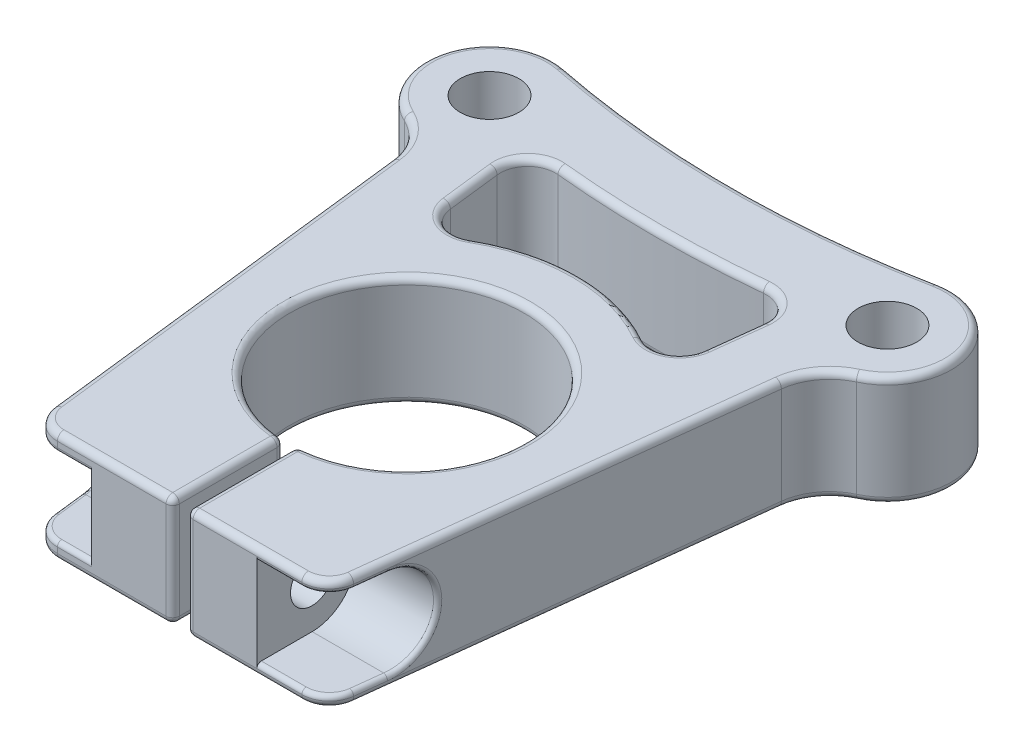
ISO-10303-21;
HEADER;
FILE_DESCRIPTION(('STEP AP214'),'2;1');
FILE_NAME('part.step','',(''),(''),'','','');
FILE_SCHEMA(('AUTOMOTIVE_DESIGN { 1 0 10303 214 1 1 1 1 }'));
ENDSEC;
DATA;
#1=APPLICATION_CONTEXT('core data for automotive mechanical design processes');
#2=APPLICATION_PROTOCOL_DEFINITION('international standard','automotive_design',2000,#1);
#3=PRODUCT_CONTEXT('',#1,'mechanical');
#4=PRODUCT('Part','Part','',(#3));
#5=PRODUCT_RELATED_PRODUCT_CATEGORY('part','',(#4));
#6=PRODUCT_DEFINITION_FORMATION('','',#4);
#7=PRODUCT_DEFINITION_CONTEXT('part definition',#1,'design');
#8=PRODUCT_DEFINITION('design','',#6,#7);
#9=PRODUCT_DEFINITION_SHAPE('','',#8);
#10=(LENGTH_UNIT() NAMED_UNIT(*) SI_UNIT(.MILLI.,.METRE.));
#11=(NAMED_UNIT(*) PLANE_ANGLE_UNIT() SI_UNIT($,.RADIAN.));
#12=(NAMED_UNIT(*) SI_UNIT($,.STERADIAN.) SOLID_ANGLE_UNIT());
#13=UNCERTAINTY_MEASURE_WITH_UNIT(LENGTH_MEASURE(1.E-05),#10,'distance_accuracy_value','');
#14=(GEOMETRIC_REPRESENTATION_CONTEXT(3) GLOBAL_UNCERTAINTY_ASSIGNED_CONTEXT((#13)) GLOBAL_UNIT_ASSIGNED_CONTEXT((#10,
#11,#12)) REPRESENTATION_CONTEXT('',''));
#15=CARTESIAN_POINT('',(0.,0.,0.));
#16=DIRECTION('',(0.,0.,1.));
#17=DIRECTION('',(1.,0.,0.));
#18=AXIS2_PLACEMENT_3D('',#15,#16,#17);
#19=CARTESIAN_POINT('',(-22.86,0.,-133.527740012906));
#20=DIRECTION('',(-1.,0.,0.));
#21=DIRECTION('',(0.,0.,1.));
#22=AXIS2_PLACEMENT_3D('',#19,#20,#21);
#23=CYLINDRICAL_SURFACE('',#22,2.48919999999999);
#24=CARTESIAN_POINT('',(0.793749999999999,0.,-133.527740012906));
#25=DIRECTION('',(1.,0.,0.));
#26=DIRECTION('',(0.,0.,-1.));
#27=AXIS2_PLACEMENT_3D('',#24,#25,#26);
#28=CIRCLE('',#27,2.48919999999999);
#29=CARTESIAN_POINT('',(0.79375,0.,-136.016940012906));
#30=VERTEX_POINT('',#29);
#31=EDGE_CURVE('E559',#30,#30,#28,.T.);
#32=ORIENTED_EDGE('',*,*,#31,.F.);
#33=EDGE_LOOP('',(#32));
#34=FACE_BOUND('',#33,.T.);
#35=CARTESIAN_POINT('',(8.89,0.,-133.527740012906));
#36=DIRECTION('',(1.,0.,0.));
#37=DIRECTION('',(0.,0.,-1.));
#38=AXIS2_PLACEMENT_3D('',#35,#36,#37);
#39=CIRCLE('',#38,2.48919999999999);
#40=CARTESIAN_POINT('',(8.89,0.,-136.016940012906));
#41=VERTEX_POINT('',#40);
#42=EDGE_CURVE('E541',#41,#41,#39,.F.);
#43=ORIENTED_EDGE('',*,*,#42,.F.);
#44=EDGE_LOOP('',(#43));
#45=FACE_BOUND('',#44,.T.);
#46=ADVANCED_FACE('F42',(#34,#45),#23,.F.);
#47=CARTESIAN_POINT('',(-22.3741039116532,6.35,-174.011337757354));
#48=DIRECTION('',(0.993196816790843,0.,-0.116447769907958));
#49=DIRECTION('',(-0.116447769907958,0.,-0.993196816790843));
#50=AXIS2_PLACEMENT_3D('',#47,#48,#49);
#51=PLANE('',#50);
#52=CARTESIAN_POINT('',(-17.6206521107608,0.,-133.468584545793));
#53=DIRECTION('',(0.993196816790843,0.,-0.116447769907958));
#54=DIRECTION('',(-0.116447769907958,0.,-0.993196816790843));
#55=AXIS2_PLACEMENT_3D('',#52,#53,#54);
#56=ELLIPSE('',#55,4.98692697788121,4.953);
#57=CARTESIAN_POINT('',(-17.6206521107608,-4.953,-133.468584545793));
#58=VERTEX_POINT('',#57);
#59=CARTESIAN_POINT('',(-17.6206521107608,4.953,-133.468584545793));
#60=VERTEX_POINT('',#59);
#61=EDGE_CURVE('E1153',#58,#60,#56,.T.);
#62=ORIENTED_EDGE('',*,*,#61,.T.);
#63=DIRECTION('',(-0.116447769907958,0.,-0.993196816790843));
#64=VECTOR('',#63,1.);
#65=CARTESIAN_POINT('',(-17.2119854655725,4.953,-129.983018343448));
#66=LINE('',#65,#64);
#67=CARTESIAN_POINT('',(-17.2119854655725,4.953,-129.983018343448));
#68=VERTEX_POINT('',#67);
#69=EDGE_CURVE('E1157',#60,#68,#66,.F.);
#70=ORIENTED_EDGE('',*,*,#69,.T.);
#71=DIRECTION('',(0.,-1.,0.));
#72=VECTOR('',#71,1.);
#73=CARTESIAN_POINT('',(-17.2119854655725,6.35,-129.983018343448));
#74=LINE('',#73,#72);
#75=CARTESIAN_POINT('',(-17.2119854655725,5.588,-129.983018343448));
#76=VERTEX_POINT('',#75);
#77=EDGE_CURVE('E616',#76,#68,#74,.T.);
#78=ORIENTED_EDGE('',*,*,#77,.F.);
#79=DIRECTION('',(0.116447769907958,0.,0.993196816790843));
#80=VECTOR('',#79,1.);
#81=CARTESIAN_POINT('',(-22.3741039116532,5.588,-174.011337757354));
#82=LINE('',#81,#80);
#83=CARTESIAN_POINT('',(-22.3741039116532,5.588,-174.011337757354));
#84=VERTEX_POINT('',#83);
#85=EDGE_CURVE('E795',#76,#84,#82,.F.);
#86=ORIENTED_EDGE('',*,*,#85,.T.);
#87=DIRECTION('',(0.,-1.,0.));
#88=VECTOR('',#87,1.);
#89=CARTESIAN_POINT('',(-22.3741039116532,6.35,-174.011337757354));
#90=LINE('',#89,#88);
#91=CARTESIAN_POINT('',(-22.3741039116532,-5.588,-174.011337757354));
#92=VERTEX_POINT('',#91);
#93=EDGE_CURVE('E619',#84,#92,#90,.T.);
#94=ORIENTED_EDGE('',*,*,#93,.T.);
#95=DIRECTION('',(0.116447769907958,0.,0.993196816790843));
#96=VECTOR('',#95,1.);
#97=CARTESIAN_POINT('',(-22.3741039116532,-5.588,-174.011337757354));
#98=LINE('',#97,#96);
#99=CARTESIAN_POINT('',(-17.2119854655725,-5.588,-129.983018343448));
#100=VERTEX_POINT('',#99);
#101=EDGE_CURVE('E798',#92,#100,#98,.T.);
#102=ORIENTED_EDGE('',*,*,#101,.T.);
#103=CARTESIAN_POINT('',(-17.2119854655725,-4.953,-129.983018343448));
#104=VERTEX_POINT('',#103);
#105=EDGE_CURVE('E615',#104,#100,#74,.T.);
#106=ORIENTED_EDGE('',*,*,#105,.F.);
#107=DIRECTION('',(0.116447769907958,0.,0.993196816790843));
#108=VECTOR('',#107,1.);
#109=CARTESIAN_POINT('',(-17.6275878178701,-4.953,-133.527740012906));
#110=LINE('',#109,#108);
#111=EDGE_CURVE('E1155',#104,#58,#110,.F.);
#112=ORIENTED_EDGE('',*,*,#111,.T.);
#113=EDGE_LOOP('',(#62,#70,#78,#86,#94,#102,#106,#112));
#114=FACE_BOUND('',#113,.T.);
#115=ADVANCED_FACE('F1241',(#114),#51,.F.);
#116=CARTESIAN_POINT('',(-14.0585855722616,6.35,-130.352740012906));
#117=DIRECTION('',(0.,-1.,0.));
#118=DIRECTION('',(0.,0.,-1.));
#119=AXIS2_PLACEMENT_3D('',#116,#117,#118);
#120=CYLINDRICAL_SURFACE('',#119,3.17499999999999);
#121=ORIENTED_EDGE('',*,*,#77,.T.);
#122=CARTESIAN_POINT('',(-14.0585855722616,4.953,-130.352740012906));
#123=DIRECTION('',(0.,-1.,0.));
#124=DIRECTION('',(0.,0.,-1.));
#125=AXIS2_PLACEMENT_3D('',#122,#123,#124);
#126=CIRCLE('',#125,3.17499999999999);
#127=CARTESIAN_POINT('',(-14.0585855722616,4.953,-127.177740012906));
#128=VERTEX_POINT('',#127);
#129=EDGE_CURVE('E1151',#68,#128,#126,.F.);
#130=ORIENTED_EDGE('',*,*,#129,.T.);
#131=DIRECTION('',(0.,-1.,0.));
#132=VECTOR('',#131,1.);
#133=CARTESIAN_POINT('',(-14.0585855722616,6.35,-127.177740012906));
#134=LINE('',#133,#132);
#135=CARTESIAN_POINT('',(-14.0585855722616,5.588,-127.177740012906));
#136=VERTEX_POINT('',#135);
#137=EDGE_CURVE('E612',#136,#128,#134,.T.);
#138=ORIENTED_EDGE('',*,*,#137,.F.);
#139=CARTESIAN_POINT('',(-14.0585855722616,5.588,-130.352740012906));
#140=DIRECTION('',(0.,1.,0.));
#141=DIRECTION('',(0.,0.,1.));
#142=AXIS2_PLACEMENT_3D('',#139,#140,#141);
#143=CIRCLE('',#142,3.17499999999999);
#144=EDGE_CURVE('E891',#136,#76,#143,.F.);
#145=ORIENTED_EDGE('',*,*,#144,.T.);
#146=EDGE_LOOP('',(#121,#130,#138,#145));
#147=FACE_BOUND('',#146,.T.);
#148=ADVANCED_FACE('F1399',(#147),#120,.T.);
#149=CARTESIAN_POINT('',(-14.0585855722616,-4.953,-127.177740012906));
#150=VERTEX_POINT('',#149);
#151=CARTESIAN_POINT('',(-14.0585855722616,-5.588,-127.177740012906));
#152=VERTEX_POINT('',#151);
#153=EDGE_CURVE('E608',#150,#152,#134,.T.);
#154=ORIENTED_EDGE('',*,*,#153,.F.);
#155=CARTESIAN_POINT('',(-14.0585855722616,-4.953,-130.352740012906));
#156=DIRECTION('',(0.,1.,0.));
#157=DIRECTION('',(0.,0.,1.));
#158=AXIS2_PLACEMENT_3D('',#155,#156,#157);
#159=CIRCLE('',#158,3.17499999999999);
#160=EDGE_CURVE('E1163',#150,#104,#159,.F.);
#161=ORIENTED_EDGE('',*,*,#160,.T.);
#162=ORIENTED_EDGE('',*,*,#105,.T.);
#163=CARTESIAN_POINT('',(-14.0585855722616,-5.588,-130.352740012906));
#164=DIRECTION('',(0.,1.,0.));
#165=DIRECTION('',(0.,0.,1.));
#166=AXIS2_PLACEMENT_3D('',#163,#164,#165);
#167=CIRCLE('',#166,3.17499999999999);
#168=EDGE_CURVE('E792',#100,#152,#167,.T.);
#169=ORIENTED_EDGE('',*,*,#168,.T.);
#170=EDGE_LOOP('',(#154,#161,#162,#169));
#171=FACE_BOUND('',#170,.T.);
#172=ADVANCED_FACE('F1385',(#171),#120,.T.);
#173=CARTESIAN_POINT('',(-0.793749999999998,6.35,-127.177740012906));
#174=DIRECTION('',(0.,0.,-1.));
#175=DIRECTION('',(-1.,0.,0.));
#176=AXIS2_PLACEMENT_3D('',#173,#174,#175);
#177=PLANE('',#176);
#178=ORIENTED_EDGE('',*,*,#137,.T.);
#179=DIRECTION('',(-1.,0.,0.));
#180=VECTOR('',#179,1.);
#181=CARTESIAN_POINT('',(-10.16,4.953,-127.177740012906));
#182=LINE('',#181,#180);
#183=CARTESIAN_POINT('',(-10.16,4.953,-127.177740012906));
#184=VERTEX_POINT('',#183);
#185=EDGE_CURVE('E1148',#128,#184,#182,.F.);
#186=ORIENTED_EDGE('',*,*,#185,.T.);
#187=DIRECTION('',(0.,-1.,0.));
#188=VECTOR('',#187,1.);
#189=CARTESIAN_POINT('',(-10.16,-4.445,-127.177740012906));
#190=LINE('',#189,#188);
#191=CARTESIAN_POINT('',(-10.16,-4.953,-127.177740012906));
#192=VERTEX_POINT('',#191);
#193=EDGE_CURVE('E549',#184,#192,#190,.T.);
#194=ORIENTED_EDGE('',*,*,#193,.T.);
#195=DIRECTION('',(-1.,0.,0.));
#196=VECTOR('',#195,1.);
#197=CARTESIAN_POINT('',(-14.0585855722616,-4.953,-127.177740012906));
#198=LINE('',#197,#196);
#199=EDGE_CURVE('E1146',#192,#150,#198,.T.);
#200=ORIENTED_EDGE('',*,*,#199,.T.);
#201=ORIENTED_EDGE('',*,*,#153,.T.);
#202=DIRECTION('',(1.,0.,0.));
#203=VECTOR('',#202,1.);
#204=CARTESIAN_POINT('',(-0.793749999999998,-5.588,-127.177740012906));
#205=LINE('',#204,#203);
#206=CARTESIAN_POINT('',(-1.55575,-5.588,-127.177740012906));
#207=VERTEX_POINT('',#206);
#208=EDGE_CURVE('E790',#152,#207,#205,.T.);
#209=ORIENTED_EDGE('',*,*,#208,.T.);
#210=DIRECTION('',(0.,-1.,0.));
#211=VECTOR('',#210,1.);
#212=CARTESIAN_POINT('',(-1.55575,6.35,-127.177740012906));
#213=LINE('',#212,#211);
#214=CARTESIAN_POINT('',(-1.55575,5.588,-127.177740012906));
#215=VERTEX_POINT('',#214);
#216=EDGE_CURVE('E786',#207,#215,#213,.F.);
#217=ORIENTED_EDGE('',*,*,#216,.T.);
#218=DIRECTION('',(1.,0.,0.));
#219=VECTOR('',#218,1.);
#220=CARTESIAN_POINT('',(-14.0585855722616,5.588,-127.177740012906));
#221=LINE('',#220,#219);
#222=EDGE_CURVE('E788',#215,#136,#221,.F.);
#223=ORIENTED_EDGE('',*,*,#222,.T.);
#224=EDGE_LOOP('',(#178,#186,#194,#200,#201,#209,#217,#223));
#225=FACE_BOUND('',#224,.T.);
#226=ADVANCED_FACE('F1403',(#225),#177,.F.);
#227=CARTESIAN_POINT('',(0.,6.35,-153.316318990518));
#228=DIRECTION('',(0.,1.,0.));
#229=DIRECTION('',(0.,0.,1.));
#230=AXIS2_PLACEMENT_3D('',#227,#228,#229);
#231=PLANE('',#230);
#232=DIRECTION('',(0.116447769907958,0.,0.993196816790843));
#233=VECTOR('',#232,1.);
#234=CARTESIAN_POINT('',(-12.8658715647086,6.35,-151.80785457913));
#235=LINE('',#234,#233);
#236=CARTESIAN_POINT('',(-15.3281179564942,6.35,-172.808645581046));
#237=VERTEX_POINT('',#236);
#238=CARTESIAN_POINT('',(-16.0417180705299,6.35,-178.895025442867));
#239=VERTEX_POINT('',#238);
#240=EDGE_CURVE('E857',#237,#239,#235,.F.);
#241=ORIENTED_EDGE('',*,*,#240,.T.);
#242=CARTESIAN_POINT('',(-12.1315022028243,6.35,-179.353480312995));
#243=DIRECTION('',(0.,1.,0.));
#244=DIRECTION('',(0.,0.,1.));
#245=AXIS2_PLACEMENT_3D('',#242,#243,#244);
#246=CIRCLE('',#245,3.93700000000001);
#247=CARTESIAN_POINT('',(-11.7399597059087,6.35,-183.270962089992));
#248=VERTEX_POINT('',#247);
#249=EDGE_CURVE('E878',#239,#248,#246,.F.);
#250=ORIENTED_EDGE('',*,*,#249,.T.);
#251=CARTESIAN_POINT('',(-2.94209101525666E-12,6.35,-300.732230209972));
#252=DIRECTION('',(0.,1.,0.));
#253=DIRECTION('',(0.,0.,1.));
#254=AXIS2_PLACEMENT_3D('',#251,#252,#253);
#255=CIRCLE('',#254,118.0465);
#256=CARTESIAN_POINT('',(11.7399597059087,6.35,-183.270962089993));
#257=VERTEX_POINT('',#256);
#258=EDGE_CURVE('E875',#248,#257,#255,.T.);
#259=ORIENTED_EDGE('',*,*,#258,.T.);
#260=CARTESIAN_POINT('',(12.1315022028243,6.35,-179.353480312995));
#261=DIRECTION('',(0.,1.,0.));
#262=DIRECTION('',(0.,0.,1.));
#263=AXIS2_PLACEMENT_3D('',#260,#261,#262);
#264=CIRCLE('',#263,3.93700000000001);
#265=CARTESIAN_POINT('',(16.0417180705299,6.35,-178.895025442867));
#266=VERTEX_POINT('',#265);
#267=EDGE_CURVE('E872',#257,#266,#264,.F.);
#268=ORIENTED_EDGE('',*,*,#267,.T.);
#269=DIRECTION('',(0.116447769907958,0.,-0.993196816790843));
#270=VECTOR('',#269,1.);
#271=CARTESIAN_POINT('',(12.8658715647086,6.35,-151.80785457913));
#272=LINE('',#271,#270);
#273=CARTESIAN_POINT('',(15.3281179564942,6.35,-172.808645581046));
#274=VERTEX_POINT('',#273);
#275=EDGE_CURVE('E869',#266,#274,#272,.F.);
#276=ORIENTED_EDGE('',*,*,#275,.T.);
#277=CARTESIAN_POINT('',(11.4179020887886,6.35,-173.267100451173));
#278=DIRECTION('',(0.,1.,0.));
#279=DIRECTION('',(0.,0.,1.));
#280=AXIS2_PLACEMENT_3D('',#277,#278,#279);
#281=CIRCLE('',#280,3.937);
#282=CARTESIAN_POINT('',(9.46234979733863,6.35,-169.850115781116));
#283=VERTEX_POINT('',#282);
#284=EDGE_CURVE('E866',#274,#283,#281,.F.);
#285=ORIENTED_EDGE('',*,*,#284,.T.);
#286=CARTESIAN_POINT('',(0.,6.35,-153.316318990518));
#287=DIRECTION('',(0.,1.,0.));
#288=DIRECTION('',(0.,0.,1.));
#289=AXIS2_PLACEMENT_3D('',#286,#287,#288);
#290=CIRCLE('',#289,19.05);
#291=CARTESIAN_POINT('',(-9.46234979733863,6.35,-169.850115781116));
#292=VERTEX_POINT('',#291);
#293=EDGE_CURVE('E863',#283,#292,#290,.T.);
#294=ORIENTED_EDGE('',*,*,#293,.T.);
#295=CARTESIAN_POINT('',(-11.4179020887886,6.35,-173.267100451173));
#296=DIRECTION('',(0.,1.,0.));
#297=DIRECTION('',(0.,0.,1.));
#298=AXIS2_PLACEMENT_3D('',#295,#296,#297);
#299=CIRCLE('',#298,3.937);
#300=EDGE_CURVE('E860',#292,#237,#299,.F.);
#301=ORIENTED_EDGE('',*,*,#300,.T.);
#302=EDGE_LOOP('',(#241,#250,#259,#268,#276,#285,#294,#301));
#303=FACE_BOUND('',#302,.T.);
#304=DIRECTION('',(0.,0.,-1.));
#305=VECTOR('',#304,1.);
#306=CARTESIAN_POINT('',(-1.55575,6.35,-139.877740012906));
#307=LINE('',#306,#305);
#308=CARTESIAN_POINT('',(-1.55575,6.35,-127.939740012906));
#309=VERTEX_POINT('',#308);
#310=CARTESIAN_POINT('',(-1.55575,6.35,-139.17765505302));
#311=VERTEX_POINT('',#310);
#312=EDGE_CURVE('E852',#309,#311,#307,.T.);
#313=ORIENTED_EDGE('',*,*,#312,.T.);
#314=CARTESIAN_POINT('',(0.,6.35,-153.316318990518));
#315=DIRECTION('',(0.,1.,0.));
#316=DIRECTION('',(0.,0.,1.));
#317=AXIS2_PLACEMENT_3D('',#314,#315,#316);
#318=CIRCLE('',#317,14.224);
#319=CARTESIAN_POINT('',(1.55575,6.35,-139.17765505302));
#320=VERTEX_POINT('',#319);
#321=EDGE_CURVE('E854',#311,#320,#318,.F.);
#322=ORIENTED_EDGE('',*,*,#321,.T.);
#323=DIRECTION('',(0.,0.,1.));
#324=VECTOR('',#323,1.);
#325=CARTESIAN_POINT('',(1.55575,6.35,-127.177740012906));
#326=LINE('',#325,#324);
#327=CARTESIAN_POINT('',(1.55575,6.35,-127.939740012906));
#328=VERTEX_POINT('',#327);
#329=EDGE_CURVE('E850',#320,#328,#326,.T.);
#330=ORIENTED_EDGE('',*,*,#329,.T.);
#331=DIRECTION('',(1.,0.,0.));
#332=VECTOR('',#331,1.);
#333=CARTESIAN_POINT('',(14.0585855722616,6.35,-127.939740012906));
#334=LINE('',#333,#332);
#335=CARTESIAN_POINT('',(14.0585855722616,6.35,-127.939740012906));
#336=VERTEX_POINT('',#335);
#337=EDGE_CURVE('E847',#328,#336,#334,.T.);
#338=ORIENTED_EDGE('',*,*,#337,.T.);
#339=CARTESIAN_POINT('',(14.0585855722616,6.35,-130.352740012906));
#340=DIRECTION('',(0.,1.,0.));
#341=DIRECTION('',(0.,0.,1.));
#342=AXIS2_PLACEMENT_3D('',#339,#340,#341);
#343=CIRCLE('',#342,2.41299999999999);
#344=CARTESIAN_POINT('',(16.4551694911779,6.35,-130.071751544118));
#345=VERTEX_POINT('',#344);
#346=EDGE_CURVE('E845',#336,#345,#343,.T.);
#347=ORIENTED_EDGE('',*,*,#346,.T.);
#348=DIRECTION('',(0.116447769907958,0.,-0.993196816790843));
#349=VECTOR('',#348,1.);
#350=CARTESIAN_POINT('',(21.6172879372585,6.35,-174.100070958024));
#351=LINE('',#350,#349);
#352=CARTESIAN_POINT('',(21.6172879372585,6.35,-174.100070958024));
#353=VERTEX_POINT('',#352);
#354=EDGE_CURVE('E820',#345,#353,#351,.T.);
#355=ORIENTED_EDGE('',*,*,#354,.T.);
#356=CARTESIAN_POINT('',(28.680903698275,6.35,-173.271894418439));
#357=DIRECTION('',(0.,1.,0.));
#358=DIRECTION('',(0.,0.,1.));
#359=AXIS2_PLACEMENT_3D('',#356,#357,#358);
#360=CIRCLE('',#359,7.11199999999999);
#361=CARTESIAN_POINT('',(25.6735829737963,6.35,-179.716781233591));
#362=VERTEX_POINT('',#361);
#363=EDGE_CURVE('E823',#353,#362,#360,.F.);
#364=ORIENTED_EDGE('',*,*,#363,.T.);
#365=CARTESIAN_POINT('',(22.8810708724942,6.35,-185.70131899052));
#366=DIRECTION('',(0.,1.,0.));
#367=DIRECTION('',(0.,0.,1.));
#368=AXIS2_PLACEMENT_3D('',#365,#366,#367);
#369=CIRCLE('',#368,6.60399999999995);
#370=CARTESIAN_POINT('',(21.5926943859,6.35,-192.178424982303));
#371=VERTEX_POINT('',#370);
#372=EDGE_CURVE('E826',#362,#371,#369,.T.);
#373=ORIENTED_EDGE('',*,*,#372,.T.);
#374=CARTESIAN_POINT('',(-3.08086889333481E-12,6.35,-300.732230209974));
#375=DIRECTION('',(0.,1.,0.));
#376=DIRECTION('',(0.,0.,1.));
#377=AXIS2_PLACEMENT_3D('',#374,#375,#376);
#378=CIRCLE('',#377,110.680500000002);
#379=CARTESIAN_POINT('',(-21.5926943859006,6.35,-192.1784249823));
#380=VERTEX_POINT('',#379);
#381=EDGE_CURVE('E829',#371,#380,#378,.F.);
#382=ORIENTED_EDGE('',*,*,#381,.T.);
#383=CARTESIAN_POINT('',(-22.8810708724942,6.35,-185.70131899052));
#384=DIRECTION('',(0.,1.,0.));
#385=DIRECTION('',(0.,0.,1.));
#386=AXIS2_PLACEMENT_3D('',#383,#384,#385);
#387=CIRCLE('',#386,6.60399999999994);
#388=CARTESIAN_POINT('',(-25.6735829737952,6.35,-179.716781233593));
#389=VERTEX_POINT('',#388);
#390=EDGE_CURVE('E832',#380,#389,#387,.T.);
#391=ORIENTED_EDGE('',*,*,#390,.T.);
#392=CARTESIAN_POINT('',(-28.680903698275,6.35,-173.271894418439));
#393=DIRECTION('',(0.,1.,0.));
#394=DIRECTION('',(0.,0.,1.));
#395=AXIS2_PLACEMENT_3D('',#392,#393,#394);
#396=CIRCLE('',#395,7.11199999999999);
#397=CARTESIAN_POINT('',(-21.6172879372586,6.35,-174.100070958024));
#398=VERTEX_POINT('',#397);
#399=EDGE_CURVE('E835',#389,#398,#396,.F.);
#400=ORIENTED_EDGE('',*,*,#399,.T.);
#401=DIRECTION('',(0.116447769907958,0.,0.993196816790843));
#402=VECTOR('',#401,1.);
#403=CARTESIAN_POINT('',(-16.4551694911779,6.35,-130.071751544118));
#404=LINE('',#403,#402);
#405=CARTESIAN_POINT('',(-16.4551694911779,6.35,-130.071751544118));
#406=VERTEX_POINT('',#405);
#407=EDGE_CURVE('E838',#398,#406,#404,.T.);
#408=ORIENTED_EDGE('',*,*,#407,.T.);
#409=CARTESIAN_POINT('',(-14.0585855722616,6.35,-130.352740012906));
#410=DIRECTION('',(0.,1.,0.));
#411=DIRECTION('',(0.,0.,1.));
#412=AXIS2_PLACEMENT_3D('',#409,#410,#411);
#413=CIRCLE('',#412,2.41299999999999);
#414=CARTESIAN_POINT('',(-14.0585855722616,6.35,-127.939740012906));
#415=VERTEX_POINT('',#414);
#416=EDGE_CURVE('E841',#406,#415,#413,.T.);
#417=ORIENTED_EDGE('',*,*,#416,.T.);
#418=DIRECTION('',(1.,0.,0.));
#419=VECTOR('',#418,1.);
#420=CARTESIAN_POINT('',(-0.793749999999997,6.35,-127.939740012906));
#421=LINE('',#420,#419);
#422=EDGE_CURVE('E843',#415,#309,#421,.T.);
#423=ORIENTED_EDGE('',*,*,#422,.T.);
#424=EDGE_LOOP('',(#313,#322,#330,#338,#347,#355,#364,#373,#382,#391,#400,#408,#417,#423));
#425=FACE_BOUND('',#424,.T.);
#426=CARTESIAN_POINT('',(-22.8810708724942,6.35,-185.70131899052));
#427=DIRECTION('',(0.,1.,0.));
#428=DIRECTION('',(0.,0.,1.));
#429=AXIS2_PLACEMENT_3D('',#426,#427,#428);
#430=CIRCLE('',#429,3.3734375);
#431=CARTESIAN_POINT('',(-22.8810708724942,6.35,-182.32788149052));
#432=VERTEX_POINT('',#431);
#433=EDGE_CURVE('E604',#432,#432,#430,.T.);
#434=ORIENTED_EDGE('',*,*,#433,.F.);
#435=EDGE_LOOP('',(#434));
#436=FACE_BOUND('',#435,.T.);
#437=CARTESIAN_POINT('',(22.8810708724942,6.35,-185.70131899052));
#438=DIRECTION('',(0.,1.,0.));
#439=DIRECTION('',(0.,0.,-1.));
#440=AXIS2_PLACEMENT_3D('',#437,#438,#439);
#441=CIRCLE('',#440,3.37343750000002);
#442=CARTESIAN_POINT('',(22.8810708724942,6.35,-189.07475649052));
#443=VERTEX_POINT('',#442);
#444=EDGE_CURVE('E596',#443,#443,#441,.T.);
#445=ORIENTED_EDGE('',*,*,#444,.F.);
#446=EDGE_LOOP('',(#445));
#447=FACE_BOUND('',#446,.T.);
#448=ADVANCED_FACE('F1581',(#303,#425,#436,#447),#231,.T.);
#449=CARTESIAN_POINT('',(0.,-6.35,-153.316318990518));
#450=DIRECTION('',(0.,1.,0.));
#451=DIRECTION('',(0.,0.,1.));
#452=AXIS2_PLACEMENT_3D('',#449,#450,#451);
#453=PLANE('',#452);
#454=CARTESIAN_POINT('',(0.,-6.35,-153.316318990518));
#455=DIRECTION('',(0.,1.,0.));
#456=DIRECTION('',(0.,0.,1.));
#457=AXIS2_PLACEMENT_3D('',#454,#455,#456);
#458=CIRCLE('',#457,19.05);
#459=CARTESIAN_POINT('',(-9.46234979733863,-6.35,-169.850115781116));
#460=VERTEX_POINT('',#459);
#461=CARTESIAN_POINT('',(9.46234979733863,-6.35,-169.850115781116));
#462=VERTEX_POINT('',#461);
#463=EDGE_CURVE('E705',#460,#462,#458,.F.);
#464=ORIENTED_EDGE('',*,*,#463,.T.);
#465=CARTESIAN_POINT('',(11.4179020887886,-6.35,-173.267100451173));
#466=DIRECTION('',(0.,1.,0.));
#467=DIRECTION('',(0.,0.,1.));
#468=AXIS2_PLACEMENT_3D('',#465,#466,#467);
#469=CIRCLE('',#468,3.937);
#470=CARTESIAN_POINT('',(15.3281179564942,-6.35,-172.808645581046));
#471=VERTEX_POINT('',#470);
#472=EDGE_CURVE('E708',#462,#471,#469,.T.);
#473=ORIENTED_EDGE('',*,*,#472,.T.);
#474=DIRECTION('',(0.116447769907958,0.,-0.993196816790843));
#475=VECTOR('',#474,1.);
#476=CARTESIAN_POINT('',(16.0417180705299,-6.35,-178.895025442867));
#477=LINE('',#476,#475);
#478=CARTESIAN_POINT('',(16.0417180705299,-6.35,-178.895025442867));
#479=VERTEX_POINT('',#478);
#480=EDGE_CURVE('E687',#471,#479,#477,.T.);
#481=ORIENTED_EDGE('',*,*,#480,.T.);
#482=CARTESIAN_POINT('',(12.1315022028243,-6.35,-179.353480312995));
#483=DIRECTION('',(0.,1.,0.));
#484=DIRECTION('',(0.,0.,1.));
#485=AXIS2_PLACEMENT_3D('',#482,#483,#484);
#486=CIRCLE('',#485,3.93700000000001);
#487=CARTESIAN_POINT('',(11.7399597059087,-6.35,-183.270962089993));
#488=VERTEX_POINT('',#487);
#489=EDGE_CURVE('E690',#479,#488,#486,.T.);
#490=ORIENTED_EDGE('',*,*,#489,.T.);
#491=CARTESIAN_POINT('',(-2.94209101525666E-12,-6.35,-300.732230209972));
#492=DIRECTION('',(0.,1.,0.));
#493=DIRECTION('',(0.,0.,1.));
#494=AXIS2_PLACEMENT_3D('',#491,#492,#493);
#495=CIRCLE('',#494,118.0465);
#496=CARTESIAN_POINT('',(-11.7399597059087,-6.35,-183.270962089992));
#497=VERTEX_POINT('',#496);
#498=EDGE_CURVE('E693',#488,#497,#495,.F.);
#499=ORIENTED_EDGE('',*,*,#498,.T.);
#500=CARTESIAN_POINT('',(-12.1315022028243,-6.35,-179.353480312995));
#501=DIRECTION('',(0.,1.,0.));
#502=DIRECTION('',(0.,0.,1.));
#503=AXIS2_PLACEMENT_3D('',#500,#501,#502);
#504=CIRCLE('',#503,3.93700000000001);
#505=CARTESIAN_POINT('',(-16.0417180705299,-6.35,-178.895025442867));
#506=VERTEX_POINT('',#505);
#507=EDGE_CURVE('E696',#497,#506,#504,.T.);
#508=ORIENTED_EDGE('',*,*,#507,.T.);
#509=DIRECTION('',(0.116447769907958,0.,0.993196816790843));
#510=VECTOR('',#509,1.);
#511=CARTESIAN_POINT('',(-15.3281179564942,-6.35,-172.808645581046));
#512=LINE('',#511,#510);
#513=CARTESIAN_POINT('',(-15.3281179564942,-6.35,-172.808645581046));
#514=VERTEX_POINT('',#513);
#515=EDGE_CURVE('E699',#506,#514,#512,.T.);
#516=ORIENTED_EDGE('',*,*,#515,.T.);
#517=CARTESIAN_POINT('',(-11.4179020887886,-6.35,-173.267100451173));
#518=DIRECTION('',(0.,1.,0.));
#519=DIRECTION('',(0.,0.,1.));
#520=AXIS2_PLACEMENT_3D('',#517,#518,#519);
#521=CIRCLE('',#520,3.937);
#522=EDGE_CURVE('E702',#514,#460,#521,.T.);
#523=ORIENTED_EDGE('',*,*,#522,.T.);
#524=EDGE_LOOP('',(#464,#473,#481,#490,#499,#508,#516,#523));
#525=FACE_BOUND('',#524,.T.);
#526=DIRECTION('',(0.,0.,1.));
#527=VECTOR('',#526,1.);
#528=CARTESIAN_POINT('',(1.55575,-6.35,-153.316318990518));
#529=LINE('',#528,#527);
#530=CARTESIAN_POINT('',(1.55575,-6.35,-127.939740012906));
#531=VERTEX_POINT('',#530);
#532=CARTESIAN_POINT('',(1.55575,-6.35,-139.17765505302));
#533=VERTEX_POINT('',#532);
#534=EDGE_CURVE('E682',#531,#533,#529,.F.);
#535=ORIENTED_EDGE('',*,*,#534,.T.);
#536=CARTESIAN_POINT('',(0.,-6.35,-153.316318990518));
#537=DIRECTION('',(0.,1.,0.));
#538=DIRECTION('',(0.,0.,1.));
#539=AXIS2_PLACEMENT_3D('',#536,#537,#538);
#540=CIRCLE('',#539,14.224);
#541=CARTESIAN_POINT('',(-1.55575,-6.35,-139.17765505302));
#542=VERTEX_POINT('',#541);
#543=EDGE_CURVE('E684',#533,#542,#540,.T.);
#544=ORIENTED_EDGE('',*,*,#543,.T.);
#545=DIRECTION('',(0.,0.,-1.));
#546=VECTOR('',#545,1.);
#547=CARTESIAN_POINT('',(-1.55575,-6.35,-153.316318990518));
#548=LINE('',#547,#546);
#549=CARTESIAN_POINT('',(-1.55575,-6.35,-127.939740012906));
#550=VERTEX_POINT('',#549);
#551=EDGE_CURVE('E680',#542,#550,#548,.F.);
#552=ORIENTED_EDGE('',*,*,#551,.T.);
#553=DIRECTION('',(1.,0.,0.));
#554=VECTOR('',#553,1.);
#555=CARTESIAN_POINT('',(0.,-6.35,-127.939740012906));
#556=LINE('',#555,#554);
#557=CARTESIAN_POINT('',(-14.0585855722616,-6.35,-127.939740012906));
#558=VERTEX_POINT('',#557);
#559=EDGE_CURVE('E666',#550,#558,#556,.F.);
#560=ORIENTED_EDGE('',*,*,#559,.T.);
#561=CARTESIAN_POINT('',(-14.0585855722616,-6.35,-130.352740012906));
#562=DIRECTION('',(0.,1.,0.));
#563=DIRECTION('',(0.,0.,1.));
#564=AXIS2_PLACEMENT_3D('',#561,#562,#563);
#565=CIRCLE('',#564,2.41299999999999);
#566=CARTESIAN_POINT('',(-16.4551694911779,-6.35,-130.071751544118));
#567=VERTEX_POINT('',#566);
#568=EDGE_CURVE('E664',#558,#567,#565,.F.);
#569=ORIENTED_EDGE('',*,*,#568,.T.);
#570=DIRECTION('',(0.116447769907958,0.,0.993196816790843));
#571=VECTOR('',#570,1.);
#572=CARTESIAN_POINT('',(-18.9203993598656,-6.35,-151.097988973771));
#573=LINE('',#572,#571);
#574=CARTESIAN_POINT('',(-21.6172879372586,-6.35,-174.100070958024));
#575=VERTEX_POINT('',#574);
#576=EDGE_CURVE('E661',#567,#575,#573,.F.);
#577=ORIENTED_EDGE('',*,*,#576,.T.);
#578=CARTESIAN_POINT('',(-28.680903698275,-6.35,-173.271894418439));
#579=DIRECTION('',(0.,1.,0.));
#580=DIRECTION('',(0.,0.,1.));
#581=AXIS2_PLACEMENT_3D('',#578,#579,#580);
#582=CIRCLE('',#581,7.11199999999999);
#583=CARTESIAN_POINT('',(-25.6735829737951,-6.35,-179.716781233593));
#584=VERTEX_POINT('',#583);
#585=EDGE_CURVE('E658',#575,#584,#582,.T.);
#586=ORIENTED_EDGE('',*,*,#585,.T.);
#587=CARTESIAN_POINT('',(-22.8810708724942,-6.35,-185.70131899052));
#588=DIRECTION('',(0.,1.,0.));
#589=DIRECTION('',(0.,0.,1.));
#590=AXIS2_PLACEMENT_3D('',#587,#588,#589);
#591=CIRCLE('',#590,6.60399999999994);
#592=CARTESIAN_POINT('',(-21.5926943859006,-6.35,-192.1784249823));
#593=VERTEX_POINT('',#592);
#594=EDGE_CURVE('E655',#584,#593,#591,.F.);
#595=ORIENTED_EDGE('',*,*,#594,.T.);
#596=CARTESIAN_POINT('',(-3.08086889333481E-12,-6.35,-300.732230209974));
#597=DIRECTION('',(0.,1.,0.));
#598=DIRECTION('',(0.,0.,1.));
#599=AXIS2_PLACEMENT_3D('',#596,#597,#598);
#600=CIRCLE('',#599,110.680500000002);
#601=CARTESIAN_POINT('',(21.5926943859,-6.35,-192.178424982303));
#602=VERTEX_POINT('',#601);
#603=EDGE_CURVE('E652',#593,#602,#600,.T.);
#604=ORIENTED_EDGE('',*,*,#603,.T.);
#605=CARTESIAN_POINT('',(22.8810708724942,-6.35,-185.70131899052));
#606=DIRECTION('',(0.,1.,0.));
#607=DIRECTION('',(0.,0.,1.));
#608=AXIS2_PLACEMENT_3D('',#605,#606,#607);
#609=CIRCLE('',#608,6.60399999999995);
#610=CARTESIAN_POINT('',(25.6735829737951,-6.35,-179.716781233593));
#611=VERTEX_POINT('',#610);
#612=EDGE_CURVE('E643',#602,#611,#609,.F.);
#613=ORIENTED_EDGE('',*,*,#612,.T.);
#614=CARTESIAN_POINT('',(28.680903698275,-6.35,-173.271894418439));
#615=DIRECTION('',(0.,1.,0.));
#616=DIRECTION('',(0.,0.,1.));
#617=AXIS2_PLACEMENT_3D('',#614,#615,#616);
#618=CIRCLE('',#617,7.11199999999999);
#619=CARTESIAN_POINT('',(21.6172879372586,-6.35,-174.100070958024));
#620=VERTEX_POINT('',#619);
#621=EDGE_CURVE('E668',#611,#620,#618,.T.);
#622=ORIENTED_EDGE('',*,*,#621,.T.);
#623=DIRECTION('',(0.116447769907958,0.,-0.993196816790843));
#624=VECTOR('',#623,1.);
#625=CARTESIAN_POINT('',(18.9203993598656,-6.35,-151.097988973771));
#626=LINE('',#625,#624);
#627=CARTESIAN_POINT('',(16.4551694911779,-6.35,-130.071751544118));
#628=VERTEX_POINT('',#627);
#629=EDGE_CURVE('E671',#620,#628,#626,.F.);
#630=ORIENTED_EDGE('',*,*,#629,.T.);
#631=CARTESIAN_POINT('',(14.0585855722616,-6.35,-130.352740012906));
#632=DIRECTION('',(0.,1.,0.));
#633=DIRECTION('',(0.,0.,1.));
#634=AXIS2_PLACEMENT_3D('',#631,#632,#633);
#635=CIRCLE('',#634,2.41299999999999);
#636=CARTESIAN_POINT('',(14.0585855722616,-6.35,-127.939740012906));
#637=VERTEX_POINT('',#636);
#638=EDGE_CURVE('E674',#628,#637,#635,.F.);
#639=ORIENTED_EDGE('',*,*,#638,.T.);
#640=DIRECTION('',(1.,0.,0.));
#641=VECTOR('',#640,1.);
#642=CARTESIAN_POINT('',(0.,-6.35,-127.939740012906));
#643=LINE('',#642,#641);
#644=EDGE_CURVE('E677',#637,#531,#643,.F.);
#645=ORIENTED_EDGE('',*,*,#644,.T.);
#646=EDGE_LOOP('',(#535,#544,#552,#560,#569,#577,#586,#595,#604,#613,#622,#630,#639,#645));
#647=FACE_BOUND('',#646,.T.);
#648=CARTESIAN_POINT('',(22.8810708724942,-6.35,-185.70131899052));
#649=DIRECTION('',(0.,1.,0.));
#650=DIRECTION('',(0.,0.,-1.));
#651=AXIS2_PLACEMENT_3D('',#648,#649,#650);
#652=CIRCLE('',#651,3.37343750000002);
#653=CARTESIAN_POINT('',(22.8810708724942,-6.35,-189.07475649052));
#654=VERTEX_POINT('',#653);
#655=EDGE_CURVE('E595',#654,#654,#652,.T.);
#656=ORIENTED_EDGE('',*,*,#655,.T.);
#657=EDGE_LOOP('',(#656));
#658=FACE_BOUND('',#657,.T.);
#659=CARTESIAN_POINT('',(-22.8810708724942,-6.35,-185.70131899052));
#660=DIRECTION('',(0.,1.,0.));
#661=DIRECTION('',(0.,0.,1.));
#662=AXIS2_PLACEMENT_3D('',#659,#660,#661);
#663=CIRCLE('',#662,3.3734375);
#664=CARTESIAN_POINT('',(-22.8810708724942,-6.35,-182.32788149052));
#665=VERTEX_POINT('',#664);
#666=EDGE_CURVE('E600',#665,#665,#663,.T.);
#667=ORIENTED_EDGE('',*,*,#666,.T.);
#668=EDGE_LOOP('',(#667));
#669=FACE_BOUND('',#668,.T.);
#670=ADVANCED_FACE('F1312',(#525,#647,#658,#669),#453,.F.);
#671=CARTESIAN_POINT('',(0.,6.35,-153.316318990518));
#672=DIRECTION('',(0.,-1.,0.));
#673=DIRECTION('',(0.,0.,-1.));
#674=AXIS2_PLACEMENT_3D('',#671,#672,#673);
#675=CYLINDRICAL_SURFACE('',#674,13.462);
#676=DIRECTION('',(0.,-1.,0.));
#677=VECTOR('',#676,1.);
#678=CARTESIAN_POINT('',(-1.47240625,6.35,-139.935083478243));
#679=LINE('',#678,#677);
#680=CARTESIAN_POINT('',(-1.47240625,5.588,-139.935083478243));
#681=VERTEX_POINT('',#680);
#682=CARTESIAN_POINT('',(-1.47240625,-5.588,-139.935083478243));
#683=VERTEX_POINT('',#682);
#684=EDGE_CURVE('E913',#681,#683,#679,.T.);
#685=ORIENTED_EDGE('',*,*,#684,.T.);
#686=CARTESIAN_POINT('',(0.,-5.588,-153.316318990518));
#687=DIRECTION('',(0.,1.,0.));
#688=DIRECTION('',(0.,0.,1.));
#689=AXIS2_PLACEMENT_3D('',#686,#687,#688);
#690=CIRCLE('',#689,13.462);
#691=CARTESIAN_POINT('',(1.47240625,-5.588,-139.935083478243));
#692=VERTEX_POINT('',#691);
#693=EDGE_CURVE('E916',#683,#692,#690,.F.);
#694=ORIENTED_EDGE('',*,*,#693,.T.);
#695=DIRECTION('',(0.,-1.,0.));
#696=VECTOR('',#695,1.);
#697=CARTESIAN_POINT('',(1.47240625,6.35,-139.935083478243));
#698=LINE('',#697,#696);
#699=CARTESIAN_POINT('',(1.47240625,5.588,-139.935083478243));
#700=VERTEX_POINT('',#699);
#701=EDGE_CURVE('E911',#692,#700,#698,.F.);
#702=ORIENTED_EDGE('',*,*,#701,.T.);
#703=CARTESIAN_POINT('',(0.,5.588,-153.316318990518));
#704=DIRECTION('',(0.,1.,0.));
#705=DIRECTION('',(0.,0.,1.));
#706=AXIS2_PLACEMENT_3D('',#703,#704,#705);
#707=CIRCLE('',#706,13.462);
#708=EDGE_CURVE('E908',#700,#681,#707,.T.);
#709=ORIENTED_EDGE('',*,*,#708,.T.);
#710=EDGE_LOOP('',(#685,#694,#702,#709));
#711=FACE_BOUND('',#710,.T.);
#712=ADVANCED_FACE('F1604',(#711),#675,.F.);
#713=CARTESIAN_POINT('',(0.79375,6.35,-139.877740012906));
#714=DIRECTION('',(1.,0.,0.));
#715=DIRECTION('',(0.,0.,-1.));
#716=AXIS2_PLACEMENT_3D('',#713,#714,#715);
#717=PLANE('',#716);
#718=DIRECTION('',(0.,-1.,0.));
#719=VECTOR('',#718,1.);
#720=CARTESIAN_POINT('',(0.79375,6.35,-139.17765505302));
#721=LINE('',#720,#719);
#722=CARTESIAN_POINT('',(0.79375,5.588,-139.17765505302));
#723=VERTEX_POINT('',#722);
#724=CARTESIAN_POINT('',(0.79375,-5.588,-139.17765505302));
#725=VERTEX_POINT('',#724);
#726=EDGE_CURVE('E901',#723,#725,#721,.T.);
#727=ORIENTED_EDGE('',*,*,#726,.T.);
#728=DIRECTION('',(0.,0.,1.));
#729=VECTOR('',#728,1.);
#730=CARTESIAN_POINT('',(0.79375,-5.588,-139.877740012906));
#731=LINE('',#730,#729);
#732=CARTESIAN_POINT('',(0.793749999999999,-5.588,-127.939740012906));
#733=VERTEX_POINT('',#732);
#734=EDGE_CURVE('E906',#725,#733,#731,.T.);
#735=ORIENTED_EDGE('',*,*,#734,.T.);
#736=DIRECTION('',(0.,-1.,0.));
#737=VECTOR('',#736,1.);
#738=CARTESIAN_POINT('',(0.793749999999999,6.35,-127.939740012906));
#739=LINE('',#738,#737);
#740=CARTESIAN_POINT('',(0.793749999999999,5.588,-127.939740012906));
#741=VERTEX_POINT('',#740);
#742=EDGE_CURVE('E903',#733,#741,#739,.F.);
#743=ORIENTED_EDGE('',*,*,#742,.T.);
#744=DIRECTION('',(0.,0.,1.));
#745=VECTOR('',#744,1.);
#746=CARTESIAN_POINT('',(0.79375,5.588,-139.877740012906));
#747=LINE('',#746,#745);
#748=EDGE_CURVE('E899',#741,#723,#747,.F.);
#749=ORIENTED_EDGE('',*,*,#748,.T.);
#750=EDGE_LOOP('',(#727,#735,#743,#749));
#751=FACE_BOUND('',#750,.T.);
#752=ORIENTED_EDGE('',*,*,#31,.T.);
#753=EDGE_LOOP('',(#752));
#754=FACE_BOUND('',#753,.T.);
#755=ADVANCED_FACE('F1523',(#751,#754),#717,.F.);
#756=CARTESIAN_POINT('',(0.793749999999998,6.35,-127.177740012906));
#757=DIRECTION('',(0.,0.,-1.));
#758=DIRECTION('',(-1.,0.,0.));
#759=AXIS2_PLACEMENT_3D('',#756,#757,#758);
#760=PLANE('',#759);
#761=DIRECTION('',(0.,-1.,0.));
#762=VECTOR('',#761,1.);
#763=CARTESIAN_POINT('',(8.89,5.08,-127.177740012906));
#764=LINE('',#763,#762);
#765=CARTESIAN_POINT('',(8.89,5.588,-127.177740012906));
#766=VERTEX_POINT('',#765);
#767=CARTESIAN_POINT('',(8.89,-5.588,-127.177740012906));
#768=VERTEX_POINT('',#767);
#769=EDGE_CURVE('E525',#766,#768,#764,.T.);
#770=ORIENTED_EDGE('',*,*,#769,.F.);
#771=DIRECTION('',(1.,0.,0.));
#772=VECTOR('',#771,1.);
#773=CARTESIAN_POINT('',(0.793749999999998,5.588,-127.177740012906));
#774=LINE('',#773,#772);
#775=CARTESIAN_POINT('',(1.55575,5.588,-127.177740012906));
#776=VERTEX_POINT('',#775);
#777=EDGE_CURVE('E758',#766,#776,#774,.F.);
#778=ORIENTED_EDGE('',*,*,#777,.T.);
#779=DIRECTION('',(0.,-1.,0.));
#780=VECTOR('',#779,1.);
#781=CARTESIAN_POINT('',(1.55575,6.35,-127.177740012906));
#782=LINE('',#781,#780);
#783=CARTESIAN_POINT('',(1.55575,-5.588,-127.177740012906));
#784=VERTEX_POINT('',#783);
#785=EDGE_CURVE('E756',#776,#784,#782,.T.);
#786=ORIENTED_EDGE('',*,*,#785,.T.);
#787=DIRECTION('',(1.,0.,0.));
#788=VECTOR('',#787,1.);
#789=CARTESIAN_POINT('',(0.793749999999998,-5.588,-127.177740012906));
#790=LINE('',#789,#788);
#791=EDGE_CURVE('E763',#784,#768,#790,.T.);
#792=ORIENTED_EDGE('',*,*,#791,.T.);
#793=EDGE_LOOP('',(#770,#778,#786,#792));
#794=FACE_BOUND('',#793,.T.);
#795=ADVANCED_FACE('F1298',(#794),#760,.F.);
#796=CARTESIAN_POINT('',(22.3741039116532,6.35,-174.011337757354));
#797=DIRECTION('',(-0.993196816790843,0.,-0.116447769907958));
#798=DIRECTION('',(-0.116447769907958,0.,0.993196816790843));
#799=AXIS2_PLACEMENT_3D('',#796,#797,#798);
#800=PLANE('',#799);
#801=DIRECTION('',(0.116447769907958,0.,-0.993196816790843));
#802=VECTOR('',#801,1.);
#803=CARTESIAN_POINT('',(17.2119854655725,5.588,-129.983018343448));
#804=LINE('',#803,#802);
#805=CARTESIAN_POINT('',(22.3741039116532,5.588,-174.011337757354));
#806=VERTEX_POINT('',#805);
#807=CARTESIAN_POINT('',(17.6206521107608,5.588,-133.468584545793));
#808=VERTEX_POINT('',#807);
#809=EDGE_CURVE('E771',#806,#808,#804,.F.);
#810=ORIENTED_EDGE('',*,*,#809,.T.);
#811=CARTESIAN_POINT('',(17.6206521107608,0.,-133.468584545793));
#812=DIRECTION('',(-0.993196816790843,0.,-0.116447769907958));
#813=DIRECTION('',(0.116447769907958,0.,-0.993196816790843));
#814=AXIS2_PLACEMENT_3D('',#811,#812,#813);
#815=ELLIPSE('',#814,5.62627659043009,5.588);
#816=CARTESIAN_POINT('',(17.6206521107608,-5.588,-133.468584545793));
#817=VERTEX_POINT('',#816);
#818=EDGE_CURVE('E1129',#808,#817,#815,.T.);
#819=ORIENTED_EDGE('',*,*,#818,.T.);
#820=DIRECTION('',(0.116447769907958,0.,-0.993196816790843));
#821=VECTOR('',#820,1.);
#822=CARTESIAN_POINT('',(22.3741039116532,-5.588,-174.011337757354));
#823=LINE('',#822,#821);
#824=CARTESIAN_POINT('',(22.3741039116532,-5.588,-174.011337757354));
#825=VERTEX_POINT('',#824);
#826=EDGE_CURVE('E775',#817,#825,#823,.T.);
#827=ORIENTED_EDGE('',*,*,#826,.T.);
#828=DIRECTION('',(0.,-1.,0.));
#829=VECTOR('',#828,1.);
#830=CARTESIAN_POINT('',(22.3741039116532,6.35,-174.011337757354));
#831=LINE('',#830,#829);
#832=EDGE_CURVE('E639',#806,#825,#831,.T.);
#833=ORIENTED_EDGE('',*,*,#832,.F.);
#834=EDGE_LOOP('',(#810,#819,#827,#833));
#835=FACE_BOUND('',#834,.T.);
#836=ADVANCED_FACE('F1202',(#835),#800,.F.);
#837=CARTESIAN_POINT('',(28.680903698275,6.35,-173.271894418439));
#838=DIRECTION('',(0.,-1.,0.));
#839=DIRECTION('',(0.,0.,-1.));
#840=AXIS2_PLACEMENT_3D('',#837,#838,#839);
#841=CYLINDRICAL_SURFACE('',#840,6.34999999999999);
#842=ORIENTED_EDGE('',*,*,#832,.T.);
#843=CARTESIAN_POINT('',(28.680903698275,-5.588,-173.271894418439));
#844=DIRECTION('',(0.,1.,0.));
#845=DIRECTION('',(0.,0.,1.));
#846=AXIS2_PLACEMENT_3D('',#843,#844,#845);
#847=CIRCLE('',#846,6.34999999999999);
#848=CARTESIAN_POINT('',(25.9957959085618,-5.588,-179.026257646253));
#849=VERTEX_POINT('',#848);
#850=EDGE_CURVE('E783',#825,#849,#847,.F.);
#851=ORIENTED_EDGE('',*,*,#850,.T.);
#852=DIRECTION('',(0.,-1.,0.));
#853=VECTOR('',#852,1.);
#854=CARTESIAN_POINT('',(25.9957959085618,6.35,-179.026257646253));
#855=LINE('',#854,#853);
#856=CARTESIAN_POINT('',(25.9957959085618,5.588,-179.026257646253));
#857=VERTEX_POINT('',#856);
#858=EDGE_CURVE('E635',#857,#849,#855,.T.);
#859=ORIENTED_EDGE('',*,*,#858,.F.);
#860=CARTESIAN_POINT('',(28.680903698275,5.588,-173.271894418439));
#861=DIRECTION('',(0.,1.,0.));
#862=DIRECTION('',(0.,0.,1.));
#863=AXIS2_PLACEMENT_3D('',#860,#861,#862);
#864=CIRCLE('',#863,6.34999999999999);
#865=EDGE_CURVE('E780',#857,#806,#864,.T.);
#866=ORIENTED_EDGE('',*,*,#865,.T.);
#867=EDGE_LOOP('',(#842,#851,#859,#866));
#868=FACE_BOUND('',#867,.T.);
#869=ADVANCED_FACE('F1328',(#868),#841,.F.);
#870=CARTESIAN_POINT('',(22.8810708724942,6.35,-185.70131899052));
#871=DIRECTION('',(0.,-1.,0.));
#872=DIRECTION('',(0.,0.,-1.));
#873=AXIS2_PLACEMENT_3D('',#870,#871,#872);
#874=CYLINDRICAL_SURFACE('',#873,7.36599999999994);
#875=DIRECTION('',(0.,-1.,0.));
#876=VECTOR('',#875,1.);
#877=CARTESIAN_POINT('',(21.4440355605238,6.35,-192.92578336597));
#878=LINE('',#877,#876);
#879=CARTESIAN_POINT('',(21.4440355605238,5.588,-192.92578336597));
#880=VERTEX_POINT('',#879);
#881=CARTESIAN_POINT('',(21.4440355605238,-5.588,-192.92578336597));
#882=VERTEX_POINT('',#881);
#883=EDGE_CURVE('E631',#880,#882,#878,.T.);
#884=ORIENTED_EDGE('',*,*,#883,.F.);
#885=CARTESIAN_POINT('',(22.8810708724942,5.588,-185.70131899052));
#886=DIRECTION('',(0.,1.,0.));
#887=DIRECTION('',(0.,0.,1.));
#888=AXIS2_PLACEMENT_3D('',#885,#886,#887);
#889=CIRCLE('',#888,7.36599999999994);
#890=EDGE_CURVE('E896',#880,#857,#889,.F.);
#891=ORIENTED_EDGE('',*,*,#890,.T.);
#892=ORIENTED_EDGE('',*,*,#858,.T.);
#893=CARTESIAN_POINT('',(22.8810708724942,-5.588,-185.70131899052));
#894=DIRECTION('',(0.,1.,0.));
#895=DIRECTION('',(0.,0.,1.));
#896=AXIS2_PLACEMENT_3D('',#893,#894,#895);
#897=CIRCLE('',#896,7.36599999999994);
#898=EDGE_CURVE('E893',#849,#882,#897,.T.);
#899=ORIENTED_EDGE('',*,*,#898,.T.);
#900=EDGE_LOOP('',(#884,#891,#892,#899));
#901=FACE_BOUND('',#900,.T.);
#902=ADVANCED_FACE('F1341',(#901),#874,.T.);
#903=CARTESIAN_POINT('',(-3.08086889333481E-12,6.35,-300.732230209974));
#904=DIRECTION('',(0.,-1.,0.));
#905=DIRECTION('',(0.,0.,-1.));
#906=AXIS2_PLACEMENT_3D('',#903,#904,#905);
#907=CYLINDRICAL_SURFACE('',#906,109.918500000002);
#908=ORIENTED_EDGE('',*,*,#883,.T.);
#909=CARTESIAN_POINT('',(-3.08086889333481E-12,-5.588,-300.732230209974));
#910=DIRECTION('',(0.,1.,0.));
#911=DIRECTION('',(0.,0.,1.));
#912=AXIS2_PLACEMENT_3D('',#909,#910,#911);
#913=CIRCLE('',#912,109.918500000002);
#914=CARTESIAN_POINT('',(-21.4440355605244,-5.588,-192.925783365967));
#915=VERTEX_POINT('',#914);
#916=EDGE_CURVE('E817',#882,#915,#913,.F.);
#917=ORIENTED_EDGE('',*,*,#916,.T.);
#918=DIRECTION('',(0.,-1.,0.));
#919=VECTOR('',#918,1.);
#920=CARTESIAN_POINT('',(-21.4440355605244,6.35,-192.925783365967));
#921=LINE('',#920,#919);
#922=CARTESIAN_POINT('',(-21.4440355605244,5.588,-192.925783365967));
#923=VERTEX_POINT('',#922);
#924=EDGE_CURVE('E627',#923,#915,#921,.T.);
#925=ORIENTED_EDGE('',*,*,#924,.F.);
#926=CARTESIAN_POINT('',(-3.08086889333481E-12,5.588,-300.732230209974));
#927=DIRECTION('',(0.,1.,0.));
#928=DIRECTION('',(0.,0.,1.));
#929=AXIS2_PLACEMENT_3D('',#926,#927,#928);
#930=CIRCLE('',#929,109.918500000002);
#931=EDGE_CURVE('E814',#923,#880,#930,.T.);
#932=ORIENTED_EDGE('',*,*,#931,.T.);
#933=EDGE_LOOP('',(#908,#917,#925,#932));
#934=FACE_BOUND('',#933,.T.);
#935=ADVANCED_FACE('F1345',(#934),#907,.F.);
#936=CARTESIAN_POINT('',(-22.8810708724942,6.35,-185.70131899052));
#937=DIRECTION('',(0.,-1.,0.));
#938=DIRECTION('',(0.,0.,-1.));
#939=AXIS2_PLACEMENT_3D('',#936,#937,#938);
#940=CYLINDRICAL_SURFACE('',#939,7.36599999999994);
#941=ORIENTED_EDGE('',*,*,#924,.T.);
#942=CARTESIAN_POINT('',(-22.8810708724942,-5.588,-185.70131899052));
#943=DIRECTION('',(0.,1.,0.));
#944=DIRECTION('',(0.,0.,1.));
#945=AXIS2_PLACEMENT_3D('',#942,#943,#944);
#946=CIRCLE('',#945,7.36599999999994);
#947=CARTESIAN_POINT('',(-25.9957959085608,-5.588,-179.026257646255));
#948=VERTEX_POINT('',#947);
#949=EDGE_CURVE('E811',#915,#948,#946,.T.);
#950=ORIENTED_EDGE('',*,*,#949,.T.);
#951=DIRECTION('',(0.,-1.,0.));
#952=VECTOR('',#951,1.);
#953=CARTESIAN_POINT('',(-25.9957959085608,6.35,-179.026257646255));
#954=LINE('',#953,#952);
#955=CARTESIAN_POINT('',(-25.9957959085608,5.588,-179.026257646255));
#956=VERTEX_POINT('',#955);
#957=EDGE_CURVE('E623',#956,#948,#954,.T.);
#958=ORIENTED_EDGE('',*,*,#957,.F.);
#959=CARTESIAN_POINT('',(-22.8810708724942,5.588,-185.70131899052));
#960=DIRECTION('',(0.,1.,0.));
#961=DIRECTION('',(0.,0.,1.));
#962=AXIS2_PLACEMENT_3D('',#959,#960,#961);
#963=CIRCLE('',#962,7.36599999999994);
#964=EDGE_CURVE('E808',#956,#923,#963,.F.);
#965=ORIENTED_EDGE('',*,*,#964,.T.);
#966=EDGE_LOOP('',(#941,#950,#958,#965));
#967=FACE_BOUND('',#966,.T.);
#968=ADVANCED_FACE('F1359',(#967),#940,.T.);
#969=CARTESIAN_POINT('',(-28.680903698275,6.35,-173.271894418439));
#970=DIRECTION('',(0.,-1.,0.));
#971=DIRECTION('',(0.,0.,-1.));
#972=AXIS2_PLACEMENT_3D('',#969,#970,#971);
#973=CYLINDRICAL_SURFACE('',#972,6.34999999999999);
#974=ORIENTED_EDGE('',*,*,#957,.T.);
#975=CARTESIAN_POINT('',(-28.680903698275,-5.588,-173.271894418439));
#976=DIRECTION('',(0.,1.,0.));
#977=DIRECTION('',(0.,0.,1.));
#978=AXIS2_PLACEMENT_3D('',#975,#976,#977);
#979=CIRCLE('',#978,6.34999999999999);
#980=EDGE_CURVE('E805',#948,#92,#979,.F.);
#981=ORIENTED_EDGE('',*,*,#980,.T.);
#982=ORIENTED_EDGE('',*,*,#93,.F.);
#983=CARTESIAN_POINT('',(-28.680903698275,5.588,-173.271894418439));
#984=DIRECTION('',(0.,1.,0.));
#985=DIRECTION('',(0.,0.,1.));
#986=AXIS2_PLACEMENT_3D('',#983,#984,#985);
#987=CIRCLE('',#986,6.34999999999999);
#988=EDGE_CURVE('E802',#84,#956,#987,.T.);
#989=ORIENTED_EDGE('',*,*,#988,.T.);
#990=EDGE_LOOP('',(#974,#981,#982,#989));
#991=FACE_BOUND('',#990,.T.);
#992=ADVANCED_FACE('F1363',(#991),#973,.F.);
#993=CARTESIAN_POINT('',(-0.79375,6.35,-139.877740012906));
#994=DIRECTION('',(-1.,0.,0.));
#995=DIRECTION('',(0.,0.,1.));
#996=AXIS2_PLACEMENT_3D('',#993,#994,#995);
#997=PLANE('',#996);
#998=DIRECTION('',(0.,-1.,0.));
#999=VECTOR('',#998,1.);
#1000=CARTESIAN_POINT('',(-0.793749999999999,6.35,-127.939740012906));
#1001=LINE('',#1000,#999);
#1002=CARTESIAN_POINT('',(-0.793749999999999,5.588,-127.939740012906));
#1003=VERTEX_POINT('',#1002);
#1004=CARTESIAN_POINT('',(-0.793749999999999,-5.588,-127.939740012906));
#1005=VERTEX_POINT('',#1004);
#1006=EDGE_CURVE('E921',#1003,#1005,#1001,.T.);
#1007=ORIENTED_EDGE('',*,*,#1006,.T.);
#1008=DIRECTION('',(0.,0.,-1.));
#1009=VECTOR('',#1008,1.);
#1010=CARTESIAN_POINT('',(-0.79375,-5.588,-139.877740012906));
#1011=LINE('',#1010,#1009);
#1012=CARTESIAN_POINT('',(-0.79375,-5.588,-139.17765505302));
#1013=VERTEX_POINT('',#1012);
#1014=EDGE_CURVE('E926',#1005,#1013,#1011,.T.);
#1015=ORIENTED_EDGE('',*,*,#1014,.T.);
#1016=DIRECTION('',(0.,-1.,0.));
#1017=VECTOR('',#1016,1.);
#1018=CARTESIAN_POINT('',(-0.79375,6.35,-139.17765505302));
#1019=LINE('',#1018,#1017);
#1020=CARTESIAN_POINT('',(-0.79375,5.588,-139.17765505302));
#1021=VERTEX_POINT('',#1020);
#1022=EDGE_CURVE('E923',#1013,#1021,#1019,.F.);
#1023=ORIENTED_EDGE('',*,*,#1022,.T.);
#1024=DIRECTION('',(0.,0.,-1.));
#1025=VECTOR('',#1024,1.);
#1026=CARTESIAN_POINT('',(-0.793749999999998,5.588,-127.177740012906));
#1027=LINE('',#1026,#1025);
#1028=EDGE_CURVE('E919',#1021,#1003,#1027,.F.);
#1029=ORIENTED_EDGE('',*,*,#1028,.T.);
#1030=EDGE_LOOP('',(#1007,#1015,#1023,#1029));
#1031=FACE_BOUND('',#1030,.T.);
#1032=CARTESIAN_POINT('',(-0.793749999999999,0.,-133.527740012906));
#1033=DIRECTION('',(-1.,0.,0.));
#1034=DIRECTION('',(0.,0.,1.));
#1035=AXIS2_PLACEMENT_3D('',#1032,#1033,#1034);
#1036=CIRCLE('',#1035,2.48919999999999);
#1037=CARTESIAN_POINT('',(-0.793749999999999,0.,-131.038540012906));
#1038=VERTEX_POINT('',#1037);
#1039=EDGE_CURVE('E563',#1038,#1038,#1036,.T.);
#1040=ORIENTED_EDGE('',*,*,#1039,.T.);
#1041=EDGE_LOOP('',(#1040));
#1042=FACE_BOUND('',#1041,.T.);
#1043=ADVANCED_FACE('F1437',(#1031,#1042),#997,.F.);
#1044=CARTESIAN_POINT('',(-22.8810708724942,6.35,-185.70131899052));
#1045=DIRECTION('',(0.,-1.,0.));
#1046=DIRECTION('',(0.,0.,-1.));
#1047=AXIS2_PLACEMENT_3D('',#1044,#1045,#1046);
#1048=CYLINDRICAL_SURFACE('',#1047,3.3734375);
#1049=ORIENTED_EDGE('',*,*,#433,.T.);
#1050=EDGE_LOOP('',(#1049));
#1051=FACE_BOUND('',#1050,.T.);
#1052=ORIENTED_EDGE('',*,*,#666,.F.);
#1053=EDGE_LOOP('',(#1052));
#1054=FACE_BOUND('',#1053,.T.);
#1055=ADVANCED_FACE('F1568',(#1051,#1054),#1048,.F.);
#1056=CARTESIAN_POINT('',(22.8810708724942,6.35,-185.70131899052));
#1057=DIRECTION('',(0.,-1.,0.));
#1058=DIRECTION('',(0.,0.,-1.));
#1059=AXIS2_PLACEMENT_3D('',#1056,#1057,#1058);
#1060=CYLINDRICAL_SURFACE('',#1059,3.37343750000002);
#1061=ORIENTED_EDGE('',*,*,#444,.T.);
#1062=EDGE_LOOP('',(#1061));
#1063=FACE_BOUND('',#1062,.T.);
#1064=ORIENTED_EDGE('',*,*,#655,.F.);
#1065=EDGE_LOOP('',(#1064));
#1066=FACE_BOUND('',#1065,.T.);
#1067=ADVANCED_FACE('F1574',(#1063,#1066),#1060,.F.);
#1068=CARTESIAN_POINT('',(-12.1315022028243,6.35,-179.353480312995));
#1069=DIRECTION('',(0.,-1.,0.));
#1070=DIRECTION('',(0.,0.,-1.));
#1071=AXIS2_PLACEMENT_3D('',#1068,#1069,#1070);
#1072=CYLINDRICAL_SURFACE('',#1071,3.17500000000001);
#1073=DIRECTION('',(0.,-1.,0.));
#1074=VECTOR('',#1073,1.);
#1075=CARTESIAN_POINT('',(-15.2849020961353,6.35,-178.983758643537));
#1076=LINE('',#1075,#1074);
#1077=CARTESIAN_POINT('',(-15.2849020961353,5.588,-178.983758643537));
#1078=VERTEX_POINT('',#1077);
#1079=CARTESIAN_POINT('',(-15.2849020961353,-5.588,-178.983758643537));
#1080=VERTEX_POINT('',#1079);
#1081=EDGE_CURVE('E591',#1078,#1080,#1076,.T.);
#1082=ORIENTED_EDGE('',*,*,#1081,.T.);
#1083=CARTESIAN_POINT('',(-12.1315022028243,-5.588,-179.353480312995));
#1084=DIRECTION('',(0.,1.,0.));
#1085=DIRECTION('',(0.,0.,1.));
#1086=AXIS2_PLACEMENT_3D('',#1083,#1084,#1085);
#1087=CIRCLE('',#1086,3.17500000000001);
#1088=CARTESIAN_POINT('',(-11.8157421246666,-5.588,-182.512739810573));
#1089=VERTEX_POINT('',#1088);
#1090=EDGE_CURVE('E741',#1080,#1089,#1087,.F.);
#1091=ORIENTED_EDGE('',*,*,#1090,.T.);
#1092=DIRECTION('',(0.,-1.,0.));
#1093=VECTOR('',#1092,1.);
#1094=CARTESIAN_POINT('',(-11.8157421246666,6.35,-182.512739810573));
#1095=LINE('',#1094,#1093);
#1096=CARTESIAN_POINT('',(-11.8157421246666,5.588,-182.512739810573));
#1097=VERTEX_POINT('',#1096);
#1098=EDGE_CURVE('E562',#1097,#1089,#1095,.T.);
#1099=ORIENTED_EDGE('',*,*,#1098,.F.);
#1100=CARTESIAN_POINT('',(-12.1315022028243,5.588,-179.353480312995));
#1101=DIRECTION('',(0.,1.,0.));
#1102=DIRECTION('',(0.,0.,1.));
#1103=AXIS2_PLACEMENT_3D('',#1100,#1101,#1102);
#1104=CIRCLE('',#1103,3.17500000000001);
#1105=EDGE_CURVE('E737',#1097,#1078,#1104,.T.);
#1106=ORIENTED_EDGE('',*,*,#1105,.T.);
#1107=EDGE_LOOP('',(#1082,#1091,#1099,#1106));
#1108=FACE_BOUND('',#1107,.T.);
#1109=ADVANCED_FACE('F1665',(#1108),#1072,.F.);
#1110=CARTESIAN_POINT('',(-15.2849020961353,6.35,-178.983758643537));
#1111=DIRECTION('',(0.993196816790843,0.,-0.116447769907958));
#1112=DIRECTION('',(-0.116447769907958,0.,-0.993196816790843));
#1113=AXIS2_PLACEMENT_3D('',#1110,#1111,#1112);
#1114=PLANE('',#1113);
#1115=DIRECTION('',(0.,-1.,0.));
#1116=VECTOR('',#1115,1.);
#1117=CARTESIAN_POINT('',(-14.5713019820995,6.35,-172.897378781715));
#1118=LINE('',#1117,#1116);
#1119=CARTESIAN_POINT('',(-14.5713019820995,5.588,-172.897378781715));
#1120=VERTEX_POINT('',#1119);
#1121=CARTESIAN_POINT('',(-14.5713019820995,-5.588,-172.897378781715));
#1122=VERTEX_POINT('',#1121);
#1123=EDGE_CURVE('E587',#1120,#1122,#1118,.T.);
#1124=ORIENTED_EDGE('',*,*,#1123,.T.);
#1125=DIRECTION('',(0.116447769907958,0.,0.993196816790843));
#1126=VECTOR('',#1125,1.);
#1127=CARTESIAN_POINT('',(-15.2849020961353,-5.588,-178.983758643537));
#1128=LINE('',#1127,#1126);
#1129=EDGE_CURVE('E734',#1122,#1080,#1128,.F.);
#1130=ORIENTED_EDGE('',*,*,#1129,.T.);
#1131=ORIENTED_EDGE('',*,*,#1081,.F.);
#1132=DIRECTION('',(0.116447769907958,0.,0.993196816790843));
#1133=VECTOR('',#1132,1.);
#1134=CARTESIAN_POINT('',(-15.2849020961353,5.588,-178.983758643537));
#1135=LINE('',#1134,#1133);
#1136=EDGE_CURVE('E731',#1078,#1120,#1135,.T.);
#1137=ORIENTED_EDGE('',*,*,#1136,.T.);
#1138=EDGE_LOOP('',(#1124,#1130,#1131,#1137));
#1139=FACE_BOUND('',#1138,.T.);
#1140=ADVANCED_FACE('F1671',(#1139),#1114,.T.);
#1141=CARTESIAN_POINT('',(-11.4179020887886,6.35,-173.267100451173));
#1142=DIRECTION('',(0.,-1.,0.));
#1143=DIRECTION('',(0.,0.,-1.));
#1144=AXIS2_PLACEMENT_3D('',#1141,#1142,#1143);
#1145=CYLINDRICAL_SURFACE('',#1144,3.175);
#1146=DIRECTION('',(0.,-1.,0.));
#1147=VECTOR('',#1146,1.);
#1148=CARTESIAN_POINT('',(-9.84084378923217,6.35,-170.51146765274));
#1149=LINE('',#1148,#1147);
#1150=CARTESIAN_POINT('',(-9.84084378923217,5.588,-170.51146765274));
#1151=VERTEX_POINT('',#1150);
#1152=CARTESIAN_POINT('',(-9.84084378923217,-5.588,-170.51146765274));
#1153=VERTEX_POINT('',#1152);
#1154=EDGE_CURVE('E583',#1151,#1153,#1149,.T.);
#1155=ORIENTED_EDGE('',*,*,#1154,.T.);
#1156=CARTESIAN_POINT('',(-11.4179020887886,-5.588,-173.267100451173));
#1157=DIRECTION('',(0.,1.,0.));
#1158=DIRECTION('',(0.,0.,1.));
#1159=AXIS2_PLACEMENT_3D('',#1156,#1157,#1158);
#1160=CIRCLE('',#1159,3.175);
#1161=EDGE_CURVE('E728',#1153,#1122,#1160,.F.);
#1162=ORIENTED_EDGE('',*,*,#1161,.T.);
#1163=ORIENTED_EDGE('',*,*,#1123,.F.);
#1164=CARTESIAN_POINT('',(-11.4179020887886,5.588,-173.267100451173));
#1165=DIRECTION('',(0.,1.,0.));
#1166=DIRECTION('',(0.,0.,1.));
#1167=AXIS2_PLACEMENT_3D('',#1164,#1165,#1166);
#1168=CIRCLE('',#1167,3.175);
#1169=EDGE_CURVE('E725',#1120,#1151,#1168,.T.);
#1170=ORIENTED_EDGE('',*,*,#1169,.T.);
#1171=EDGE_LOOP('',(#1155,#1162,#1163,#1170));
#1172=FACE_BOUND('',#1171,.T.);
#1173=ADVANCED_FACE('F1683',(#1172),#1145,.F.);
#1174=CARTESIAN_POINT('',(0.,6.35,-153.316318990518));
#1175=DIRECTION('',(0.,-1.,0.));
#1176=DIRECTION('',(0.,0.,-1.));
#1177=AXIS2_PLACEMENT_3D('',#1174,#1175,#1176);
#1178=CYLINDRICAL_SURFACE('',#1177,19.812);
#1179=DIRECTION('',(0.,-1.,0.));
#1180=VECTOR('',#1179,1.);
#1181=CARTESIAN_POINT('',(9.84084378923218,6.35,-170.51146765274));
#1182=LINE('',#1181,#1180);
#1183=CARTESIAN_POINT('',(9.84084378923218,5.588,-170.51146765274));
#1184=VERTEX_POINT('',#1183);
#1185=CARTESIAN_POINT('',(9.84084378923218,-5.588,-170.51146765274));
#1186=VERTEX_POINT('',#1185);
#1187=EDGE_CURVE('E579',#1184,#1186,#1182,.T.);
#1188=ORIENTED_EDGE('',*,*,#1187,.T.);
#1189=CARTESIAN_POINT('',(0.,-5.588,-153.316318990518));
#1190=DIRECTION('',(0.,1.,0.));
#1191=DIRECTION('',(0.,0.,1.));
#1192=AXIS2_PLACEMENT_3D('',#1189,#1190,#1191);
#1193=CIRCLE('',#1192,19.812);
#1194=EDGE_CURVE('E722',#1186,#1153,#1193,.T.);
#1195=ORIENTED_EDGE('',*,*,#1194,.T.);
#1196=ORIENTED_EDGE('',*,*,#1154,.F.);
#1197=CARTESIAN_POINT('',(0.,5.588,-153.316318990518));
#1198=DIRECTION('',(0.,1.,0.));
#1199=DIRECTION('',(0.,0.,1.));
#1200=AXIS2_PLACEMENT_3D('',#1197,#1198,#1199);
#1201=CIRCLE('',#1200,19.812);
#1202=EDGE_CURVE('E719',#1151,#1184,#1201,.F.);
#1203=ORIENTED_EDGE('',*,*,#1202,.T.);
#1204=EDGE_LOOP('',(#1188,#1195,#1196,#1203));
#1205=FACE_BOUND('',#1204,.T.);
#1206=ADVANCED_FACE('F1693',(#1205),#1178,.T.);
#1207=CARTESIAN_POINT('',(11.4179020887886,6.35,-173.267100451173));
#1208=DIRECTION('',(0.,-1.,0.));
#1209=DIRECTION('',(0.,0.,-1.));
#1210=AXIS2_PLACEMENT_3D('',#1207,#1208,#1209);
#1211=CYLINDRICAL_SURFACE('',#1210,3.175);
#1212=DIRECTION('',(0.,-1.,0.));
#1213=VECTOR('',#1212,1.);
#1214=CARTESIAN_POINT('',(14.5713019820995,6.35,-172.897378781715));
#1215=LINE('',#1214,#1213);
#1216=CARTESIAN_POINT('',(14.5713019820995,5.588,-172.897378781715));
#1217=VERTEX_POINT('',#1216);
#1218=CARTESIAN_POINT('',(14.5713019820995,-5.588,-172.897378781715));
#1219=VERTEX_POINT('',#1218);
#1220=EDGE_CURVE('E575',#1217,#1219,#1215,.T.);
#1221=ORIENTED_EDGE('',*,*,#1220,.T.);
#1222=CARTESIAN_POINT('',(11.4179020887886,-5.588,-173.267100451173));
#1223=DIRECTION('',(0.,1.,0.));
#1224=DIRECTION('',(0.,0.,1.));
#1225=AXIS2_PLACEMENT_3D('',#1222,#1223,#1224);
#1226=CIRCLE('',#1225,3.175);
#1227=EDGE_CURVE('E715',#1219,#1186,#1226,.F.);
#1228=ORIENTED_EDGE('',*,*,#1227,.T.);
#1229=ORIENTED_EDGE('',*,*,#1187,.F.);
#1230=CARTESIAN_POINT('',(11.4179020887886,5.588,-173.267100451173));
#1231=DIRECTION('',(0.,1.,0.));
#1232=DIRECTION('',(0.,0.,1.));
#1233=AXIS2_PLACEMENT_3D('',#1230,#1231,#1232);
#1234=CIRCLE('',#1233,3.175);
#1235=EDGE_CURVE('E712',#1184,#1217,#1234,.T.);
#1236=ORIENTED_EDGE('',*,*,#1235,.T.);
#1237=EDGE_LOOP('',(#1221,#1228,#1229,#1236));
#1238=FACE_BOUND('',#1237,.T.);
#1239=ADVANCED_FACE('F1704',(#1238),#1211,.F.);
#1240=CARTESIAN_POINT('',(15.2849020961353,6.35,-178.983758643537));
#1241=DIRECTION('',(-0.993196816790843,0.,-0.116447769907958));
#1242=DIRECTION('',(-0.116447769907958,0.,0.993196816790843));
#1243=AXIS2_PLACEMENT_3D('',#1240,#1241,#1242);
#1244=PLANE('',#1243);
#1245=ORIENTED_EDGE('',*,*,#1220,.F.);
#1246=DIRECTION('',(0.116447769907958,0.,-0.993196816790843));
#1247=VECTOR('',#1246,1.);
#1248=CARTESIAN_POINT('',(15.2849020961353,5.588,-178.983758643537));
#1249=LINE('',#1248,#1247);
#1250=CARTESIAN_POINT('',(15.2849020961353,5.588,-178.983758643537));
#1251=VERTEX_POINT('',#1250);
#1252=EDGE_CURVE('E885',#1217,#1251,#1249,.T.);
#1253=ORIENTED_EDGE('',*,*,#1252,.T.);
#1254=DIRECTION('',(0.,-1.,0.));
#1255=VECTOR('',#1254,1.);
#1256=CARTESIAN_POINT('',(15.2849020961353,6.35,-178.983758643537));
#1257=LINE('',#1256,#1255);
#1258=CARTESIAN_POINT('',(15.2849020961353,-5.588,-178.983758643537));
#1259=VERTEX_POINT('',#1258);
#1260=EDGE_CURVE('E571',#1251,#1259,#1257,.T.);
#1261=ORIENTED_EDGE('',*,*,#1260,.T.);
#1262=DIRECTION('',(0.116447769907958,0.,-0.993196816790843));
#1263=VECTOR('',#1262,1.);
#1264=CARTESIAN_POINT('',(14.5713019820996,-5.588,-172.897378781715));
#1265=LINE('',#1264,#1263);
#1266=EDGE_CURVE('E882',#1259,#1219,#1265,.F.);
#1267=ORIENTED_EDGE('',*,*,#1266,.T.);
#1268=EDGE_LOOP('',(#1245,#1253,#1261,#1267));
#1269=FACE_BOUND('',#1268,.T.);
#1270=ADVANCED_FACE('F1715',(#1269),#1244,.T.);
#1271=CARTESIAN_POINT('',(12.1315022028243,6.35,-179.353480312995));
#1272=DIRECTION('',(0.,-1.,0.));
#1273=DIRECTION('',(0.,0.,-1.));
#1274=AXIS2_PLACEMENT_3D('',#1271,#1272,#1273);
#1275=CYLINDRICAL_SURFACE('',#1274,3.17500000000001);
#1276=DIRECTION('',(0.,-1.,0.));
#1277=VECTOR('',#1276,1.);
#1278=CARTESIAN_POINT('',(11.8157421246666,6.35,-182.512739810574));
#1279=LINE('',#1278,#1277);
#1280=CARTESIAN_POINT('',(11.8157421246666,5.588,-182.512739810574));
#1281=VERTEX_POINT('',#1280);
#1282=CARTESIAN_POINT('',(11.8157421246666,-5.588,-182.512739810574));
#1283=VERTEX_POINT('',#1282);
#1284=EDGE_CURVE('E567',#1281,#1283,#1279,.T.);
#1285=ORIENTED_EDGE('',*,*,#1284,.T.);
#1286=CARTESIAN_POINT('',(12.1315022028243,-5.588,-179.353480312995));
#1287=DIRECTION('',(0.,1.,0.));
#1288=DIRECTION('',(0.,0.,1.));
#1289=AXIS2_PLACEMENT_3D('',#1286,#1287,#1288);
#1290=CIRCLE('',#1289,3.17500000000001);
#1291=EDGE_CURVE('E753',#1283,#1259,#1290,.F.);
#1292=ORIENTED_EDGE('',*,*,#1291,.T.);
#1293=ORIENTED_EDGE('',*,*,#1260,.F.);
#1294=CARTESIAN_POINT('',(12.1315022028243,5.588,-179.353480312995));
#1295=DIRECTION('',(0.,1.,0.));
#1296=DIRECTION('',(0.,0.,1.));
#1297=AXIS2_PLACEMENT_3D('',#1294,#1295,#1296);
#1298=CIRCLE('',#1297,3.17500000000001);
#1299=EDGE_CURVE('E750',#1251,#1281,#1298,.T.);
#1300=ORIENTED_EDGE('',*,*,#1299,.T.);
#1301=EDGE_LOOP('',(#1285,#1292,#1293,#1300));
#1302=FACE_BOUND('',#1301,.T.);
#1303=ADVANCED_FACE('F1562',(#1302),#1275,.F.);
#1304=CARTESIAN_POINT('',(-2.94209101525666E-12,6.35,-300.732230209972));
#1305=DIRECTION('',(0.,-1.,0.));
#1306=DIRECTION('',(0.,0.,-1.));
#1307=AXIS2_PLACEMENT_3D('',#1304,#1305,#1306);
#1308=CYLINDRICAL_SURFACE('',#1307,118.8085);
#1309=ORIENTED_EDGE('',*,*,#1098,.T.);
#1310=CARTESIAN_POINT('',(-2.94209101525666E-12,-5.588,-300.732230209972));
#1311=DIRECTION('',(0.,1.,0.));
#1312=DIRECTION('',(0.,0.,1.));
#1313=AXIS2_PLACEMENT_3D('',#1310,#1311,#1312);
#1314=CIRCLE('',#1313,118.8085);
#1315=EDGE_CURVE('E747',#1089,#1283,#1314,.T.);
#1316=ORIENTED_EDGE('',*,*,#1315,.T.);
#1317=ORIENTED_EDGE('',*,*,#1284,.F.);
#1318=CARTESIAN_POINT('',(-2.94209101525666E-12,5.588,-300.732230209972));
#1319=DIRECTION('',(0.,1.,0.));
#1320=DIRECTION('',(0.,0.,1.));
#1321=AXIS2_PLACEMENT_3D('',#1318,#1319,#1320);
#1322=CIRCLE('',#1321,118.8085);
#1323=EDGE_CURVE('E744',#1281,#1097,#1322,.F.);
#1324=ORIENTED_EDGE('',*,*,#1323,.T.);
#1325=EDGE_LOOP('',(#1309,#1316,#1317,#1324));
#1326=FACE_BOUND('',#1325,.T.);
#1327=ADVANCED_FACE('F1557',(#1326),#1308,.T.);
#1328=CARTESIAN_POINT('',(-10.16,0.,-133.527740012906));
#1329=DIRECTION('',(1.,0.,0.));
#1330=DIRECTION('',(0.,0.,-1.));
#1331=AXIS2_PLACEMENT_3D('',#1328,#1329,#1330);
#1332=CIRCLE('',#1331,2.48919999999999);
#1333=CARTESIAN_POINT('',(-10.16,0.,-136.016940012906));
#1334=VERTEX_POINT('',#1333);
#1335=EDGE_CURVE('E558',#1334,#1334,#1332,.F.);
#1336=ORIENTED_EDGE('',*,*,#1335,.T.);
#1337=EDGE_LOOP('',(#1336));
#1338=FACE_BOUND('',#1337,.T.);
#1339=ORIENTED_EDGE('',*,*,#1039,.F.);
#1340=EDGE_LOOP('',(#1339));
#1341=FACE_BOUND('',#1340,.T.);
#1342=ADVANCED_FACE('F1227',(#1338,#1341),#23,.F.);
#1343=CARTESIAN_POINT('',(-10.16,0.,-133.527740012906));
#1344=DIRECTION('',(-1.,0.,0.));
#1345=DIRECTION('',(0.,0.,1.));
#1346=AXIS2_PLACEMENT_3D('',#1343,#1344,#1345);
#1347=CYLINDRICAL_SURFACE('',#1346,4.445);
#1348=DIRECTION('',(-1.,0.,0.));
#1349=VECTOR('',#1348,1.);
#1350=CARTESIAN_POINT('',(-10.16,4.445,-133.527740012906));
#1351=LINE('',#1350,#1349);
#1352=CARTESIAN_POINT('',(-10.16,4.445,-133.527740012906));
#1353=VERTEX_POINT('',#1352);
#1354=CARTESIAN_POINT('',(-17.116108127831,4.445,-133.527740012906));
#1355=VERTEX_POINT('',#1354);
#1356=EDGE_CURVE('E555',#1353,#1355,#1351,.T.);
#1357=ORIENTED_EDGE('',*,*,#1356,.T.);
#1358=CARTESIAN_POINT('',(-17.116108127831,0.,-133.527740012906));
#1359=DIRECTION('',(-0.991573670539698,0.,0.12954403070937));
#1360=DIRECTION('',(-0.12954403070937,0.,-0.991573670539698));
#1361=AXIS2_PLACEMENT_3D('',#1358,#1359,#1360);
#1362=ELLIPSE('',#1361,4.48277332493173,4.445);
#1363=CARTESIAN_POINT('',(-17.116108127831,-4.445,-133.527740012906));
#1364=VERTEX_POINT('',#1363);
#1365=EDGE_CURVE('E1167',#1355,#1364,#1362,.T.);
#1366=ORIENTED_EDGE('',*,*,#1365,.T.);
#1367=DIRECTION('',(-1.,0.,0.));
#1368=VECTOR('',#1367,1.);
#1369=CARTESIAN_POINT('',(-10.16,-4.445,-133.527740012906));
#1370=LINE('',#1369,#1368);
#1371=CARTESIAN_POINT('',(-10.16,-4.445,-133.527740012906));
#1372=VERTEX_POINT('',#1371);
#1373=EDGE_CURVE('E553',#1372,#1364,#1370,.T.);
#1374=ORIENTED_EDGE('',*,*,#1373,.F.);
#1375=CARTESIAN_POINT('',(-10.16,0.,-133.527740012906));
#1376=DIRECTION('',(1.,0.,0.));
#1377=DIRECTION('',(0.,0.,-1.));
#1378=AXIS2_PLACEMENT_3D('',#1375,#1376,#1377);
#1379=CIRCLE('',#1378,4.445);
#1380=EDGE_CURVE('E543',#1372,#1353,#1379,.T.);
#1381=ORIENTED_EDGE('',*,*,#1380,.T.);
#1382=EDGE_LOOP('',(#1357,#1366,#1374,#1381));
#1383=FACE_BOUND('',#1382,.T.);
#1384=ADVANCED_FACE('F1222',(#1383),#1347,.F.);
#1385=CARTESIAN_POINT('',(-10.16,4.445,-133.527740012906));
#1386=DIRECTION('',(0.,-1.,0.));
#1387=DIRECTION('',(0.,0.,-1.));
#1388=AXIS2_PLACEMENT_3D('',#1385,#1386,#1387);
#1389=PLANE('',#1388);
#1390=DIRECTION('',(0.,0.,1.));
#1391=VECTOR('',#1390,1.);
#1392=CARTESIAN_POINT('',(-10.16,4.445,-133.527740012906));
#1393=LINE('',#1392,#1391);
#1394=CARTESIAN_POINT('',(-10.16,4.445,-127.685740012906));
#1395=VERTEX_POINT('',#1394);
#1396=EDGE_CURVE('E546',#1353,#1395,#1393,.T.);
#1397=ORIENTED_EDGE('',*,*,#1396,.T.);
#1398=DIRECTION('',(-1.,0.,0.));
#1399=VECTOR('',#1398,1.);
#1400=CARTESIAN_POINT('',(-14.0585855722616,4.445,-127.685740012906));
#1401=LINE('',#1400,#1399);
#1402=CARTESIAN_POINT('',(-14.0585855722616,4.445,-127.685740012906));
#1403=VERTEX_POINT('',#1402);
#1404=EDGE_CURVE('E1143',#1395,#1403,#1401,.T.);
#1405=ORIENTED_EDGE('',*,*,#1404,.T.);
#1406=CARTESIAN_POINT('',(-14.0585855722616,4.445,-130.352740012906));
#1407=DIRECTION('',(0.,-1.,0.));
#1408=DIRECTION('',(0.,0.,-1.));
#1409=AXIS2_PLACEMENT_3D('',#1406,#1407,#1408);
#1410=CIRCLE('',#1409,2.66699999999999);
#1411=CARTESIAN_POINT('',(-16.7074414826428,4.445,-130.042173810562));
#1412=VERTEX_POINT('',#1411);
#1413=EDGE_CURVE('E1141',#1403,#1412,#1410,.T.);
#1414=ORIENTED_EDGE('',*,*,#1413,.T.);
#1415=DIRECTION('',(-0.116447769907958,0.,-0.993196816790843));
#1416=VECTOR('',#1415,1.);
#1417=CARTESIAN_POINT('',(-17.1230438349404,4.445,-133.586895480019));
#1418=LINE('',#1417,#1416);
#1419=EDGE_CURVE('E1139',#1412,#1355,#1418,.T.);
#1420=ORIENTED_EDGE('',*,*,#1419,.T.);
#1421=ORIENTED_EDGE('',*,*,#1356,.F.);
#1422=EDGE_LOOP('',(#1397,#1405,#1414,#1420,#1421));
#1423=FACE_BOUND('',#1422,.T.);
#1424=ADVANCED_FACE('F1219',(#1423),#1389,.T.);
#1425=CARTESIAN_POINT('',(-10.16,-4.445,-133.527740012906));
#1426=DIRECTION('',(0.,1.,0.));
#1427=DIRECTION('',(0.,0.,1.));
#1428=AXIS2_PLACEMENT_3D('',#1425,#1426,#1427);
#1429=PLANE('',#1428);
#1430=CARTESIAN_POINT('',(-14.0585855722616,-4.445,-130.352740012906));
#1431=DIRECTION('',(0.,1.,0.));
#1432=DIRECTION('',(0.,0.,1.));
#1433=AXIS2_PLACEMENT_3D('',#1430,#1431,#1432);
#1434=CIRCLE('',#1433,2.66699999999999);
#1435=CARTESIAN_POINT('',(-16.7074414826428,-4.445,-130.042173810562));
#1436=VERTEX_POINT('',#1435);
#1437=CARTESIAN_POINT('',(-14.0585855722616,-4.445,-127.685740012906));
#1438=VERTEX_POINT('',#1437);
#1439=EDGE_CURVE('E59',#1436,#1438,#1434,.T.);
#1440=ORIENTED_EDGE('',*,*,#1439,.T.);
#1441=DIRECTION('',(-1.,0.,0.));
#1442=VECTOR('',#1441,1.);
#1443=CARTESIAN_POINT('',(-10.16,-4.445,-127.685740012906));
#1444=LINE('',#1443,#1442);
#1445=CARTESIAN_POINT('',(-10.16,-4.445,-127.685740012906));
#1446=VERTEX_POINT('',#1445);
#1447=EDGE_CURVE('E1161',#1438,#1446,#1444,.F.);
#1448=ORIENTED_EDGE('',*,*,#1447,.T.);
#1449=DIRECTION('',(0.,0.,-1.));
#1450=VECTOR('',#1449,1.);
#1451=CARTESIAN_POINT('',(-10.16,-4.445,-133.527740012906));
#1452=LINE('',#1451,#1450);
#1453=EDGE_CURVE('E551',#1446,#1372,#1452,.T.);
#1454=ORIENTED_EDGE('',*,*,#1453,.T.);
#1455=ORIENTED_EDGE('',*,*,#1373,.T.);
#1456=DIRECTION('',(0.116447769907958,0.,0.993196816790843));
#1457=VECTOR('',#1456,1.);
#1458=CARTESIAN_POINT('',(-16.7074414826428,-4.445,-130.042173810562));
#1459=LINE('',#1458,#1457);
#1460=EDGE_CURVE('E64',#1364,#1436,#1459,.T.);
#1461=ORIENTED_EDGE('',*,*,#1460,.T.);
#1462=EDGE_LOOP('',(#1440,#1448,#1454,#1455,#1461));
#1463=FACE_BOUND('',#1462,.T.);
#1464=ADVANCED_FACE('F1215',(#1463),#1429,.T.);
#1465=CARTESIAN_POINT('',(-10.16,0.,-133.527740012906));
#1466=DIRECTION('',(1.,0.,0.));
#1467=DIRECTION('',(0.,0.,-1.));
#1468=AXIS2_PLACEMENT_3D('',#1465,#1466,#1467);
#1469=PLANE('',#1468);
#1470=ORIENTED_EDGE('',*,*,#1380,.F.);
#1471=ORIENTED_EDGE('',*,*,#1453,.F.);
#1472=CARTESIAN_POINT('',(-10.16,-4.953,-127.685740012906));
#1473=DIRECTION('',(1.,0.,0.));
#1474=DIRECTION('',(0.,0.,-1.));
#1475=AXIS2_PLACEMENT_3D('',#1472,#1473,#1474);
#1476=CIRCLE('',#1475,0.508);
#1477=EDGE_CURVE('E11',#1446,#192,#1476,.T.);
#1478=ORIENTED_EDGE('',*,*,#1477,.T.);
#1479=ORIENTED_EDGE('',*,*,#193,.F.);
#1480=CARTESIAN_POINT('',(-10.16,4.953,-127.685740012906));
#1481=DIRECTION('',(1.,0.,0.));
#1482=DIRECTION('',(0.,0.,-1.));
#1483=AXIS2_PLACEMENT_3D('',#1480,#1481,#1482);
#1484=CIRCLE('',#1483,0.508);
#1485=EDGE_CURVE('E51',#184,#1395,#1484,.T.);
#1486=ORIENTED_EDGE('',*,*,#1485,.T.);
#1487=ORIENTED_EDGE('',*,*,#1396,.F.);
#1488=EDGE_LOOP('',(#1470,#1471,#1478,#1479,#1486,#1487));
#1489=FACE_BOUND('',#1488,.T.);
#1490=ORIENTED_EDGE('',*,*,#1335,.F.);
#1491=EDGE_LOOP('',(#1490));
#1492=FACE_BOUND('',#1491,.T.);
#1493=ADVANCED_FACE('F1211',(#1489,#1492),#1469,.F.);
#1494=CARTESIAN_POINT('',(8.89,0.,-133.527740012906));
#1495=DIRECTION('',(1.,0.,0.));
#1496=DIRECTION('',(0.,0.,-1.));
#1497=AXIS2_PLACEMENT_3D('',#1494,#1495,#1496);
#1498=CYLINDRICAL_SURFACE('',#1497,5.08);
#1499=DIRECTION('',(1.,0.,0.));
#1500=VECTOR('',#1499,1.);
#1501=CARTESIAN_POINT('',(8.89,-5.08,-133.527740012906));
#1502=LINE('',#1501,#1500);
#1503=CARTESIAN_POINT('',(8.89,-5.08,-133.527740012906));
#1504=VERTEX_POINT('',#1503);
#1505=CARTESIAN_POINT('',(17.116108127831,-5.08,-133.527740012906));
#1506=VERTEX_POINT('',#1505);
#1507=EDGE_CURVE('E514',#1504,#1506,#1502,.T.);
#1508=ORIENTED_EDGE('',*,*,#1507,.T.);
#1509=CARTESIAN_POINT('',(17.116108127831,0.,-133.527740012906));
#1510=DIRECTION('',(0.991785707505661,0.,0.127910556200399));
#1511=DIRECTION('',(0.127910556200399,0.,-0.991785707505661));
#1512=AXIS2_PLACEMENT_3D('',#1509,#1510,#1511);
#1513=ELLIPSE('',#1512,5.12207421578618,5.08);
#1514=CARTESIAN_POINT('',(17.116108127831,5.08,-133.527740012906));
#1515=VERTEX_POINT('',#1514);
#1516=EDGE_CURVE('E511',#1506,#1515,#1513,.T.);
#1517=ORIENTED_EDGE('',*,*,#1516,.T.);
#1518=DIRECTION('',(1.,0.,0.));
#1519=VECTOR('',#1518,1.);
#1520=CARTESIAN_POINT('',(8.89,5.08,-133.527740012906));
#1521=LINE('',#1520,#1519);
#1522=CARTESIAN_POINT('',(8.89,5.08,-133.527740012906));
#1523=VERTEX_POINT('',#1522);
#1524=EDGE_CURVE('E504',#1523,#1515,#1521,.T.);
#1525=ORIENTED_EDGE('',*,*,#1524,.F.);
#1526=CARTESIAN_POINT('',(8.89,0.,-133.527740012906));
#1527=DIRECTION('',(1.,0.,0.));
#1528=DIRECTION('',(0.,0.,-1.));
#1529=AXIS2_PLACEMENT_3D('',#1526,#1527,#1528);
#1530=CIRCLE('',#1529,5.08);
#1531=EDGE_CURVE('E509',#1504,#1523,#1530,.T.);
#1532=ORIENTED_EDGE('',*,*,#1531,.F.);
#1533=EDGE_LOOP('',(#1508,#1517,#1525,#1532));
#1534=FACE_BOUND('',#1533,.T.);
#1535=ADVANCED_FACE('F507',(#1534),#1498,.F.);
#1536=CARTESIAN_POINT('',(8.89,-5.08,-127.177740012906));
#1537=DIRECTION('',(0.,-1.,0.));
#1538=DIRECTION('',(0.,0.,-1.));
#1539=AXIS2_PLACEMENT_3D('',#1536,#1537,#1538);
#1540=PLANE('',#1539);
#1541=DIRECTION('',(0.,0.,-1.));
#1542=VECTOR('',#1541,1.);
#1543=CARTESIAN_POINT('',(8.89,-5.08,-127.177740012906));
#1544=LINE('',#1543,#1542);
#1545=CARTESIAN_POINT('',(8.89,-5.08,-127.685740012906));
#1546=VERTEX_POINT('',#1545);
#1547=EDGE_CURVE('E515',#1546,#1504,#1544,.T.);
#1548=ORIENTED_EDGE('',*,*,#1547,.F.);
#1549=DIRECTION('',(1.,0.,0.));
#1550=VECTOR('',#1549,1.);
#1551=CARTESIAN_POINT('',(8.89,-5.08,-127.685740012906));
#1552=LINE('',#1551,#1550);
#1553=CARTESIAN_POINT('',(14.0585855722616,-5.08,-127.685740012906));
#1554=VERTEX_POINT('',#1553);
#1555=EDGE_CURVE('E1137',#1546,#1554,#1552,.T.);
#1556=ORIENTED_EDGE('',*,*,#1555,.T.);
#1557=CARTESIAN_POINT('',(14.0585855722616,-5.08,-130.352740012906));
#1558=DIRECTION('',(0.,-1.,0.));
#1559=DIRECTION('',(0.,0.,-1.));
#1560=AXIS2_PLACEMENT_3D('',#1557,#1558,#1559);
#1561=CIRCLE('',#1560,2.66699999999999);
#1562=CARTESIAN_POINT('',(16.7074414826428,-5.08,-130.042173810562));
#1563=VERTEX_POINT('',#1562);
#1564=EDGE_CURVE('E1135',#1554,#1563,#1561,.F.);
#1565=ORIENTED_EDGE('',*,*,#1564,.T.);
#1566=DIRECTION('',(-0.116447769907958,0.,0.993196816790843));
#1567=VECTOR('',#1566,1.);
#1568=CARTESIAN_POINT('',(16.2701486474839,-5.08,-126.312451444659));
#1569=LINE('',#1568,#1567);
#1570=EDGE_CURVE('E1132',#1563,#1506,#1569,.F.);
#1571=ORIENTED_EDGE('',*,*,#1570,.T.);
#1572=ORIENTED_EDGE('',*,*,#1507,.F.);
#1573=EDGE_LOOP('',(#1548,#1556,#1565,#1571,#1572));
#1574=FACE_BOUND('',#1573,.T.);
#1575=ADVANCED_FACE('F1210',(#1574),#1540,.F.);
#1576=CARTESIAN_POINT('',(8.89,5.08,-133.527740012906));
#1577=DIRECTION('',(0.,1.,0.));
#1578=DIRECTION('',(0.,0.,1.));
#1579=AXIS2_PLACEMENT_3D('',#1576,#1577,#1578);
#1580=PLANE('',#1579);
#1581=CARTESIAN_POINT('',(14.0585855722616,5.08,-130.352740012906));
#1582=DIRECTION('',(0.,1.,0.));
#1583=DIRECTION('',(0.,0.,1.));
#1584=AXIS2_PLACEMENT_3D('',#1581,#1582,#1583);
#1585=CIRCLE('',#1584,2.66699999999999);
#1586=CARTESIAN_POINT('',(16.7074414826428,5.08,-130.042173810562));
#1587=VERTEX_POINT('',#1586);
#1588=CARTESIAN_POINT('',(14.0585855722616,5.08,-127.685740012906));
#1589=VERTEX_POINT('',#1588);
#1590=EDGE_CURVE('E1126',#1587,#1589,#1585,.F.);
#1591=ORIENTED_EDGE('',*,*,#1590,.T.);
#1592=DIRECTION('',(1.,0.,0.));
#1593=VECTOR('',#1592,1.);
#1594=CARTESIAN_POINT('',(8.89000000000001,5.08,-127.685740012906));
#1595=LINE('',#1594,#1593);
#1596=CARTESIAN_POINT('',(8.89,5.08,-127.685740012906));
#1597=VERTEX_POINT('',#1596);
#1598=EDGE_CURVE('E521',#1589,#1597,#1595,.F.);
#1599=ORIENTED_EDGE('',*,*,#1598,.T.);
#1600=DIRECTION('',(0.,0.,1.));
#1601=VECTOR('',#1600,1.);
#1602=CARTESIAN_POINT('',(8.89,5.08,-133.527740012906));
#1603=LINE('',#1602,#1601);
#1604=EDGE_CURVE('E518',#1523,#1597,#1603,.T.);
#1605=ORIENTED_EDGE('',*,*,#1604,.F.);
#1606=ORIENTED_EDGE('',*,*,#1524,.T.);
#1607=DIRECTION('',(0.116447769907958,0.,-0.993196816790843));
#1608=VECTOR('',#1607,1.);
#1609=CARTESIAN_POINT('',(17.004561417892,5.08,-132.576344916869));
#1610=LINE('',#1609,#1608);
#1611=EDGE_CURVE('E928',#1515,#1587,#1610,.F.);
#1612=ORIENTED_EDGE('',*,*,#1611,.T.);
#1613=EDGE_LOOP('',(#1591,#1599,#1605,#1606,#1612));
#1614=FACE_BOUND('',#1613,.T.);
#1615=ADVANCED_FACE('F519',(#1614),#1580,.F.);
#1616=CARTESIAN_POINT('',(8.89,0.,-133.527740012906));
#1617=DIRECTION('',(1.,0.,0.));
#1618=DIRECTION('',(0.,0.,-1.));
#1619=AXIS2_PLACEMENT_3D('',#1616,#1617,#1618);
#1620=PLANE('',#1619);
#1621=ORIENTED_EDGE('',*,*,#1531,.T.);
#1622=ORIENTED_EDGE('',*,*,#1604,.T.);
#1623=CARTESIAN_POINT('',(8.89,5.588,-127.685740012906));
#1624=DIRECTION('',(1.,0.,0.));
#1625=DIRECTION('',(0.,0.,-1.));
#1626=AXIS2_PLACEMENT_3D('',#1623,#1624,#1625);
#1627=CIRCLE('',#1626,0.508);
#1628=EDGE_CURVE('E1169',#1597,#766,#1627,.F.);
#1629=ORIENTED_EDGE('',*,*,#1628,.T.);
#1630=ORIENTED_EDGE('',*,*,#769,.T.);
#1631=CARTESIAN_POINT('',(8.89,-5.588,-127.685740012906));
#1632=DIRECTION('',(1.,0.,0.));
#1633=DIRECTION('',(0.,0.,-1.));
#1634=AXIS2_PLACEMENT_3D('',#1631,#1632,#1633);
#1635=CIRCLE('',#1634,0.508);
#1636=EDGE_CURVE('E1171',#768,#1546,#1635,.F.);
#1637=ORIENTED_EDGE('',*,*,#1636,.T.);
#1638=ORIENTED_EDGE('',*,*,#1547,.T.);
#1639=EDGE_LOOP('',(#1621,#1622,#1629,#1630,#1637,#1638));
#1640=FACE_BOUND('',#1639,.T.);
#1641=ORIENTED_EDGE('',*,*,#42,.T.);
#1642=EDGE_LOOP('',(#1641));
#1643=FACE_BOUND('',#1642,.T.);
#1644=ADVANCED_FACE('F527',(#1640,#1643),#1620,.T.);
#1645=CARTESIAN_POINT('',(-12.1315022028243,-5.588,-179.353480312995));
#1646=DIRECTION('',(0.,1.,0.));
#1647=DIRECTION('',(0.,0.,1.));
#1648=AXIS2_PLACEMENT_3D('',#1645,#1646,#1647);
#1649=TOROIDAL_SURFACE('',#1648,3.93700000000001,0.762);
#1650=CARTESIAN_POINT('',(-11.7399597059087,-5.588,-183.270962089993));
#1651=DIRECTION('',(0.995042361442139,0.,0.0994519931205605));
#1652=DIRECTION('',(0.0994519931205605,0.,-0.995042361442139));
#1653=AXIS2_PLACEMENT_3D('',#1650,#1651,#1652);
#1654=CIRCLE('',#1653,0.762);
#1655=EDGE_CURVE('E535',#1089,#497,#1654,.T.);
#1656=ORIENTED_EDGE('',*,*,#1655,.F.);
#1657=ORIENTED_EDGE('',*,*,#1090,.F.);
#1658=CARTESIAN_POINT('',(-16.0417180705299,-5.588,-178.895025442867));
#1659=DIRECTION('',(0.116447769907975,0.,0.993196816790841));
#1660=DIRECTION('',(0.993196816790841,0.,-0.116447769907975));
#1661=AXIS2_PLACEMENT_3D('',#1658,#1659,#1660);
#1662=CIRCLE('',#1661,0.762);
#1663=EDGE_CURVE('E531',#506,#1080,#1662,.T.);
#1664=ORIENTED_EDGE('',*,*,#1663,.F.);
#1665=ORIENTED_EDGE('',*,*,#507,.F.);
#1666=EDGE_LOOP('',(#1656,#1657,#1664,#1665));
#1667=FACE_BOUND('',#1666,.T.);
#1668=ADVANCED_FACE('F1746',(#1667),#1649,.T.);
#1669=CARTESIAN_POINT('',(-12.8658715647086,-5.588,-151.80785457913));
#1670=DIRECTION('',(-0.116447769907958,0.,-0.993196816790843));
#1671=DIRECTION('',(-0.993196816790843,0.,0.116447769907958));
#1672=AXIS2_PLACEMENT_3D('',#1669,#1670,#1671);
#1673=CYLINDRICAL_SURFACE('',#1672,0.762);
#1674=ORIENTED_EDGE('',*,*,#1663,.T.);
#1675=ORIENTED_EDGE('',*,*,#1129,.F.);
#1676=CARTESIAN_POINT('',(-15.3281179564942,-5.588,-172.808645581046));
#1677=DIRECTION('',(0.116447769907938,0.,0.993196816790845));
#1678=DIRECTION('',(0.993196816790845,0.,-0.116447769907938));
#1679=AXIS2_PLACEMENT_3D('',#1676,#1677,#1678);
#1680=CIRCLE('',#1679,0.762);
#1681=EDGE_CURVE('E948',#514,#1122,#1680,.T.);
#1682=ORIENTED_EDGE('',*,*,#1681,.F.);
#1683=ORIENTED_EDGE('',*,*,#515,.F.);
#1684=EDGE_LOOP('',(#1674,#1675,#1682,#1683));
#1685=FACE_BOUND('',#1684,.T.);
#1686=ADVANCED_FACE('F1751',(#1685),#1673,.T.);
#1687=CARTESIAN_POINT('',(-2.94209101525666E-12,-5.588,-300.732230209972));
#1688=DIRECTION('',(0.,1.,0.));
#1689=DIRECTION('',(0.,0.,1.));
#1690=AXIS2_PLACEMENT_3D('',#1687,#1688,#1689);
#1691=TOROIDAL_SURFACE('',#1690,118.0465,0.762);
#1692=ORIENTED_EDGE('',*,*,#1655,.T.);
#1693=ORIENTED_EDGE('',*,*,#498,.F.);
#1694=CARTESIAN_POINT('',(11.7399597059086,-5.588,-183.270962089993));
#1695=DIRECTION('',(0.995042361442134,0.,-0.0994519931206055));
#1696=DIRECTION('',(-0.0994519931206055,0.,-0.995042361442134));
#1697=AXIS2_PLACEMENT_3D('',#1694,#1695,#1696);
#1698=CIRCLE('',#1697,0.762);
#1699=EDGE_CURVE('E944',#1283,#488,#1698,.T.);
#1700=ORIENTED_EDGE('',*,*,#1699,.F.);
#1701=ORIENTED_EDGE('',*,*,#1315,.F.);
#1702=EDGE_LOOP('',(#1692,#1693,#1700,#1701));
#1703=FACE_BOUND('',#1702,.T.);
#1704=ADVANCED_FACE('F1763',(#1703),#1691,.T.);
#1705=CARTESIAN_POINT('',(-11.4179020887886,-5.588,-173.267100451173));
#1706=DIRECTION('',(0.,1.,0.));
#1707=DIRECTION('',(0.,0.,1.));
#1708=AXIS2_PLACEMENT_3D('',#1705,#1706,#1707);
#1709=TOROIDAL_SURFACE('',#1708,3.937,0.762);
#1710=ORIENTED_EDGE('',*,*,#1681,.T.);
#1711=ORIENTED_EDGE('',*,*,#1161,.F.);
#1712=CARTESIAN_POINT('',(-9.46234979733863,-5.588,-169.850115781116));
#1713=DIRECTION('',(0.86791584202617,0.,-0.496711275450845));
#1714=DIRECTION('',(-0.496711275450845,0.,-0.86791584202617));
#1715=AXIS2_PLACEMENT_3D('',#1712,#1713,#1714);
#1716=CIRCLE('',#1715,0.762);
#1717=EDGE_CURVE('E940',#460,#1153,#1716,.T.);
#1718=ORIENTED_EDGE('',*,*,#1717,.F.);
#1719=ORIENTED_EDGE('',*,*,#522,.F.);
#1720=EDGE_LOOP('',(#1710,#1711,#1718,#1719));
#1721=FACE_BOUND('',#1720,.T.);
#1722=ADVANCED_FACE('F1773',(#1721),#1709,.T.);
#1723=CARTESIAN_POINT('',(12.1315022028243,-5.588,-179.353480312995));
#1724=DIRECTION('',(0.,1.,0.));
#1725=DIRECTION('',(0.,0.,1.));
#1726=AXIS2_PLACEMENT_3D('',#1723,#1724,#1725);
#1727=TOROIDAL_SURFACE('',#1726,3.93700000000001,0.762);
#1728=ORIENTED_EDGE('',*,*,#1699,.T.);
#1729=ORIENTED_EDGE('',*,*,#489,.F.);
#1730=CARTESIAN_POINT('',(16.0417180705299,-5.588,-178.895025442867));
#1731=DIRECTION('',(-0.116447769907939,0.,0.993196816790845));
#1732=DIRECTION('',(0.993196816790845,0.,0.116447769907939));
#1733=AXIS2_PLACEMENT_3D('',#1730,#1731,#1732);
#1734=CIRCLE('',#1733,0.762);
#1735=EDGE_CURVE('E936',#1259,#479,#1734,.T.);
#1736=ORIENTED_EDGE('',*,*,#1735,.F.);
#1737=ORIENTED_EDGE('',*,*,#1291,.F.);
#1738=EDGE_LOOP('',(#1728,#1729,#1736,#1737));
#1739=FACE_BOUND('',#1738,.T.);
#1740=ADVANCED_FACE('F1783',(#1739),#1727,.T.);
#1741=CARTESIAN_POINT('',(0.,-5.588,-153.316318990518));
#1742=DIRECTION('',(0.,1.,0.));
#1743=DIRECTION('',(0.,0.,1.));
#1744=AXIS2_PLACEMENT_3D('',#1741,#1742,#1743);
#1745=TOROIDAL_SURFACE('',#1744,19.05,0.762);
#1746=ORIENTED_EDGE('',*,*,#1717,.T.);
#1747=ORIENTED_EDGE('',*,*,#1194,.F.);
#1748=CARTESIAN_POINT('',(9.46234979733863,-5.588,-169.850115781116));
#1749=DIRECTION('',(0.867915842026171,0.,0.496711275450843));
#1750=DIRECTION('',(0.496711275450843,0.,-0.867915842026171));
#1751=AXIS2_PLACEMENT_3D('',#1748,#1749,#1750);
#1752=CIRCLE('',#1751,0.762);
#1753=EDGE_CURVE('E932',#462,#1186,#1752,.T.);
#1754=ORIENTED_EDGE('',*,*,#1753,.F.);
#1755=ORIENTED_EDGE('',*,*,#463,.F.);
#1756=EDGE_LOOP('',(#1746,#1747,#1754,#1755));
#1757=FACE_BOUND('',#1756,.T.);
#1758=ADVANCED_FACE('F1793',(#1757),#1745,.T.);
#1759=CARTESIAN_POINT('',(12.8658715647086,-5.588,-151.80785457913));
#1760=DIRECTION('',(-0.116447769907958,0.,0.993196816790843));
#1761=DIRECTION('',(0.993196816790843,0.,0.116447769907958));
#1762=AXIS2_PLACEMENT_3D('',#1759,#1760,#1761);
#1763=CYLINDRICAL_SURFACE('',#1762,0.762);
#1764=ORIENTED_EDGE('',*,*,#1735,.T.);
#1765=ORIENTED_EDGE('',*,*,#480,.F.);
#1766=CARTESIAN_POINT('',(15.3281179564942,-5.588,-172.808645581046));
#1767=DIRECTION('',(-0.116447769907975,0.,0.993196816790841));
#1768=DIRECTION('',(0.993196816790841,0.,0.116447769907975));
#1769=AXIS2_PLACEMENT_3D('',#1766,#1767,#1768);
#1770=CIRCLE('',#1769,0.762);
#1771=EDGE_CURVE('E929',#1219,#471,#1770,.T.);
#1772=ORIENTED_EDGE('',*,*,#1771,.F.);
#1773=ORIENTED_EDGE('',*,*,#1266,.F.);
#1774=EDGE_LOOP('',(#1764,#1765,#1772,#1773));
#1775=FACE_BOUND('',#1774,.T.);
#1776=ADVANCED_FACE('F1803',(#1775),#1763,.T.);
#1777=CARTESIAN_POINT('',(11.4179020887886,-5.588,-173.267100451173));
#1778=DIRECTION('',(0.,1.,0.));
#1779=DIRECTION('',(0.,0.,1.));
#1780=AXIS2_PLACEMENT_3D('',#1777,#1778,#1779);
#1781=TOROIDAL_SURFACE('',#1780,3.937,0.762);
#1782=ORIENTED_EDGE('',*,*,#1753,.T.);
#1783=ORIENTED_EDGE('',*,*,#1227,.F.);
#1784=ORIENTED_EDGE('',*,*,#1771,.T.);
#1785=ORIENTED_EDGE('',*,*,#472,.F.);
#1786=EDGE_LOOP('',(#1782,#1783,#1784,#1785));
#1787=FACE_BOUND('',#1786,.T.);
#1788=ADVANCED_FACE('F1812',(#1787),#1781,.T.);
#1789=CARTESIAN_POINT('',(-18.9203993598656,5.588,-151.097988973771));
#1790=DIRECTION('',(-0.116447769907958,0.,-0.993196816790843));
#1791=DIRECTION('',(-0.993196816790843,0.,0.116447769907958));
#1792=AXIS2_PLACEMENT_3D('',#1789,#1790,#1791);
#1793=CYLINDRICAL_SURFACE('',#1792,0.762);
#1794=CARTESIAN_POINT('',(-21.6172879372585,5.588,-174.100070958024));
#1795=DIRECTION('',(-0.116447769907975,0.,-0.993196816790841));
#1796=DIRECTION('',(-0.993196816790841,0.,0.116447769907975));
#1797=AXIS2_PLACEMENT_3D('',#1794,#1795,#1796);
#1798=CIRCLE('',#1797,0.762);
#1799=EDGE_CURVE('E1089',#84,#398,#1798,.T.);
#1800=ORIENTED_EDGE('',*,*,#1799,.F.);
#1801=ORIENTED_EDGE('',*,*,#85,.F.);
#1802=CARTESIAN_POINT('',(-16.4551694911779,5.588,-130.071751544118));
#1803=DIRECTION('',(0.116447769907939,0.,0.993196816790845));
#1804=DIRECTION('',(0.993196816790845,0.,-0.116447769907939));
#1805=AXIS2_PLACEMENT_3D('',#1802,#1803,#1804);
#1806=CIRCLE('',#1805,0.762);
#1807=EDGE_CURVE('E933',#406,#76,#1806,.T.);
#1808=ORIENTED_EDGE('',*,*,#1807,.F.);
#1809=ORIENTED_EDGE('',*,*,#407,.F.);
#1810=EDGE_LOOP('',(#1800,#1801,#1808,#1809));
#1811=FACE_BOUND('',#1810,.T.);
#1812=ADVANCED_FACE('F1468',(#1811),#1793,.T.);
#1813=CARTESIAN_POINT('',(-14.0585855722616,5.588,-130.352740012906));
#1814=DIRECTION('',(0.,1.,0.));
#1815=DIRECTION('',(0.,0.,1.));
#1816=AXIS2_PLACEMENT_3D('',#1813,#1814,#1815);
#1817=TOROIDAL_SURFACE('',#1816,2.41299999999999,0.762);
#1818=ORIENTED_EDGE('',*,*,#1807,.T.);
#1819=ORIENTED_EDGE('',*,*,#144,.F.);
#1820=CARTESIAN_POINT('',(-14.0585855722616,5.588,-127.939740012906));
#1821=DIRECTION('',(1.,0.,0.));
#1822=DIRECTION('',(0.,0.,-1.));
#1823=AXIS2_PLACEMENT_3D('',#1820,#1821,#1822);
#1824=CIRCLE('',#1823,0.762);
#1825=EDGE_CURVE('E1086',#415,#136,#1824,.T.);
#1826=ORIENTED_EDGE('',*,*,#1825,.F.);
#1827=ORIENTED_EDGE('',*,*,#416,.F.);
#1828=EDGE_LOOP('',(#1818,#1819,#1826,#1827));
#1829=FACE_BOUND('',#1828,.T.);
#1830=ADVANCED_FACE('F1463',(#1829),#1817,.T.);
#1831=CARTESIAN_POINT('',(-28.680903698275,5.588,-173.271894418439));
#1832=DIRECTION('',(0.,1.,0.));
#1833=DIRECTION('',(0.,0.,1.));
#1834=AXIS2_PLACEMENT_3D('',#1831,#1832,#1833);
#1835=TOROIDAL_SURFACE('',#1834,7.11199999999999,0.762);
#1836=ORIENTED_EDGE('',*,*,#1799,.T.);
#1837=ORIENTED_EDGE('',*,*,#399,.F.);
#1838=CARTESIAN_POINT('',(-25.6735829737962,5.588,-179.716781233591));
#1839=DIRECTION('',(-0.90619893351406,0.,-0.422851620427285));
#1840=DIRECTION('',(-0.422851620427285,0.,0.90619893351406));
#1841=AXIS2_PLACEMENT_3D('',#1838,#1839,#1840);
#1842=CIRCLE('',#1841,0.762);
#1843=EDGE_CURVE('E1082',#956,#389,#1842,.T.);
#1844=ORIENTED_EDGE('',*,*,#1843,.F.);
#1845=ORIENTED_EDGE('',*,*,#988,.F.);
#1846=EDGE_LOOP('',(#1836,#1837,#1844,#1845));
#1847=FACE_BOUND('',#1846,.T.);
#1848=ADVANCED_FACE('F1472',(#1847),#1835,.T.);
#1849=CARTESIAN_POINT('',(0.,5.588,-127.939740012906));
#1850=DIRECTION('',(-1.,0.,0.));
#1851=DIRECTION('',(0.,0.,1.));
#1852=AXIS2_PLACEMENT_3D('',#1849,#1850,#1851);
#1853=CYLINDRICAL_SURFACE('',#1852,0.762);
#1854=ORIENTED_EDGE('',*,*,#1825,.T.);
#1855=ORIENTED_EDGE('',*,*,#222,.F.);
#1856=CARTESIAN_POINT('',(-1.55575,5.588,-127.939740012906));
#1857=DIRECTION('',(1.,0.,0.));
#1858=DIRECTION('',(0.,0.,-1.));
#1859=AXIS2_PLACEMENT_3D('',#1856,#1857,#1858);
#1860=CIRCLE('',#1859,0.762);
#1861=EDGE_CURVE('E1079',#309,#215,#1860,.T.);
#1862=ORIENTED_EDGE('',*,*,#1861,.F.);
#1863=ORIENTED_EDGE('',*,*,#422,.F.);
#1864=EDGE_LOOP('',(#1854,#1855,#1862,#1863));
#1865=FACE_BOUND('',#1864,.T.);
#1866=ADVANCED_FACE('F1459',(#1865),#1853,.T.);
#1867=CARTESIAN_POINT('',(-22.8810708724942,5.588,-185.70131899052));
#1868=DIRECTION('',(0.,1.,0.));
#1869=DIRECTION('',(0.,0.,1.));
#1870=AXIS2_PLACEMENT_3D('',#1867,#1868,#1869);
#1871=TOROIDAL_SURFACE('',#1870,6.60399999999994,0.762);
#1872=ORIENTED_EDGE('',*,*,#1843,.T.);
#1873=ORIENTED_EDGE('',*,*,#390,.F.);
#1874=CARTESIAN_POINT('',(-21.5926943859,5.588,-192.178424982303));
#1875=DIRECTION('',(0.980785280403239,0.,0.195090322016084));
#1876=DIRECTION('',(0.195090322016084,0.,-0.980785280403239));
#1877=AXIS2_PLACEMENT_3D('',#1874,#1875,#1876);
#1878=CIRCLE('',#1877,0.762);
#1879=EDGE_CURVE('E1075',#923,#380,#1878,.T.);
#1880=ORIENTED_EDGE('',*,*,#1879,.F.);
#1881=ORIENTED_EDGE('',*,*,#964,.F.);
#1882=EDGE_LOOP('',(#1872,#1873,#1880,#1881));
#1883=FACE_BOUND('',#1882,.T.);
#1884=ADVANCED_FACE('F1477',(#1883),#1871,.T.);
#1885=CARTESIAN_POINT('',(-1.55575,5.588,-127.939740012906));
#1886=DIRECTION('',(0.,0.,1.));
#1887=DIRECTION('',(1.,0.,0.));
#1888=AXIS2_PLACEMENT_3D('',#1885,#1886,#1887);
#1889=SPHERICAL_SURFACE('',#1888,0.762);
#1890=CARTESIAN_POINT('',(-1.55575,5.588,-127.939740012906));
#1891=DIRECTION('',(0.,0.,1.));
#1892=DIRECTION('',(1.,0.,0.));
#1893=AXIS2_PLACEMENT_3D('',#1890,#1891,#1892);
#1894=CIRCLE('',#1893,0.762);
#1895=EDGE_CURVE('E1066',#309,#1003,#1894,.F.);
#1896=ORIENTED_EDGE('',*,*,#1895,.F.);
#1897=ORIENTED_EDGE('',*,*,#1861,.T.);
#1898=CARTESIAN_POINT('',(-1.55575,5.588,-127.939740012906));
#1899=DIRECTION('',(0.,1.,0.));
#1900=DIRECTION('',(0.,0.,1.));
#1901=AXIS2_PLACEMENT_3D('',#1898,#1899,#1900);
#1902=CIRCLE('',#1901,0.762);
#1903=EDGE_CURVE('E1069',#1003,#215,#1902,.F.);
#1904=ORIENTED_EDGE('',*,*,#1903,.F.);
#1905=EDGE_LOOP('',(#1896,#1897,#1904));
#1906=FACE_BOUND('',#1905,.T.);
#1907=ADVANCED_FACE('F1455',(#1906),#1889,.T.);
#1908=CARTESIAN_POINT('',(-3.08086889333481E-12,5.588,-300.732230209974));
#1909=DIRECTION('',(0.,1.,0.));
#1910=DIRECTION('',(0.,0.,1.));
#1911=AXIS2_PLACEMENT_3D('',#1908,#1909,#1910);
#1912=TOROIDAL_SURFACE('',#1911,110.680500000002,0.762);
#1913=ORIENTED_EDGE('',*,*,#1879,.T.);
#1914=ORIENTED_EDGE('',*,*,#381,.F.);
#1915=CARTESIAN_POINT('',(21.5926943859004,5.588,-192.178424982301));
#1916=DIRECTION('',(0.980785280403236,0.,-0.195090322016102));
#1917=DIRECTION('',(-0.195090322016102,0.,-0.980785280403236));
#1918=AXIS2_PLACEMENT_3D('',#1915,#1916,#1917);
#1919=CIRCLE('',#1918,0.762);
#1920=EDGE_CURVE('E1062',#880,#371,#1919,.T.);
#1921=ORIENTED_EDGE('',*,*,#1920,.F.);
#1922=ORIENTED_EDGE('',*,*,#931,.F.);
#1923=EDGE_LOOP('',(#1913,#1914,#1921,#1922));
#1924=FACE_BOUND('',#1923,.T.);
#1925=ADVANCED_FACE('F1480',(#1924),#1912,.T.);
#1926=CARTESIAN_POINT('',(-14.0585855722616,-5.588,-130.352740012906));
#1927=DIRECTION('',(0.,1.,0.));
#1928=DIRECTION('',(0.,0.,1.));
#1929=AXIS2_PLACEMENT_3D('',#1926,#1927,#1928);
#1930=TOROIDAL_SURFACE('',#1929,2.41299999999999,0.762);
#1931=CARTESIAN_POINT('',(-16.4551694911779,-5.588,-130.071751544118));
#1932=DIRECTION('',(-0.116447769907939,0.,-0.993196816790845));
#1933=DIRECTION('',(-0.993196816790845,0.,0.116447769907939));
#1934=AXIS2_PLACEMENT_3D('',#1931,#1932,#1933);
#1935=CIRCLE('',#1934,0.762);
#1936=EDGE_CURVE('E1059',#567,#100,#1935,.T.);
#1937=ORIENTED_EDGE('',*,*,#1936,.F.);
#1938=ORIENTED_EDGE('',*,*,#568,.F.);
#1939=CARTESIAN_POINT('',(-14.0585855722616,-5.588,-127.939740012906));
#1940=DIRECTION('',(1.,0.,0.));
#1941=DIRECTION('',(0.,1.,0.));
#1942=AXIS2_PLACEMENT_3D('',#1939,#1940,#1941);
#1943=CIRCLE('',#1942,0.762);
#1944=EDGE_CURVE('E1072',#152,#558,#1943,.T.);
#1945=ORIENTED_EDGE('',*,*,#1944,.F.);
#1946=ORIENTED_EDGE('',*,*,#168,.F.);
#1947=EDGE_LOOP('',(#1937,#1938,#1945,#1946));
#1948=FACE_BOUND('',#1947,.T.);
#1949=ADVANCED_FACE('F1380',(#1948),#1930,.T.);
#1950=CARTESIAN_POINT('',(-0.793749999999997,-5.588,-127.939740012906));
#1951=DIRECTION('',(1.,0.,0.));
#1952=DIRECTION('',(0.,0.,-1.));
#1953=AXIS2_PLACEMENT_3D('',#1950,#1951,#1952);
#1954=CYLINDRICAL_SURFACE('',#1953,0.762);
#1955=ORIENTED_EDGE('',*,*,#1944,.T.);
#1956=ORIENTED_EDGE('',*,*,#559,.F.);
#1957=CARTESIAN_POINT('',(-1.55575,-5.588,-127.939740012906));
#1958=DIRECTION('',(1.,0.,0.));
#1959=DIRECTION('',(0.,0.,-1.));
#1960=AXIS2_PLACEMENT_3D('',#1957,#1958,#1959);
#1961=CIRCLE('',#1960,0.762);
#1962=EDGE_CURVE('E1056',#207,#550,#1961,.T.);
#1963=ORIENTED_EDGE('',*,*,#1962,.F.);
#1964=ORIENTED_EDGE('',*,*,#208,.F.);
#1965=EDGE_LOOP('',(#1955,#1956,#1963,#1964));
#1966=FACE_BOUND('',#1965,.T.);
#1967=ADVANCED_FACE('F1427',(#1966),#1954,.T.);
#1968=CARTESIAN_POINT('',(-1.55575,6.35,-127.939740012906));
#1969=DIRECTION('',(0.,-1.,0.));
#1970=DIRECTION('',(0.,0.,-1.));
#1971=AXIS2_PLACEMENT_3D('',#1968,#1969,#1970);
#1972=CYLINDRICAL_SURFACE('',#1971,0.762);
#1973=ORIENTED_EDGE('',*,*,#1903,.T.);
#1974=ORIENTED_EDGE('',*,*,#216,.F.);
#1975=CARTESIAN_POINT('',(-1.55575,-5.588,-127.939740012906));
#1976=DIRECTION('',(0.,-1.,0.));
#1977=DIRECTION('',(0.,0.,-1.));
#1978=AXIS2_PLACEMENT_3D('',#1975,#1976,#1977);
#1979=CIRCLE('',#1978,0.762);
#1980=EDGE_CURVE('E1053',#1005,#207,#1979,.T.);
#1981=ORIENTED_EDGE('',*,*,#1980,.F.);
#1982=ORIENTED_EDGE('',*,*,#1006,.F.);
#1983=EDGE_LOOP('',(#1973,#1974,#1981,#1982));
#1984=FACE_BOUND('',#1983,.T.);
#1985=ADVANCED_FACE('F1422',(#1984),#1972,.T.);
#1986=CARTESIAN_POINT('',(-1.55575,5.588,-153.316318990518));
#1987=DIRECTION('',(0.,0.,1.));
#1988=DIRECTION('',(1.,0.,0.));
#1989=AXIS2_PLACEMENT_3D('',#1986,#1987,#1988);
#1990=CYLINDRICAL_SURFACE('',#1989,0.762);
#1991=ORIENTED_EDGE('',*,*,#1895,.T.);
#1992=ORIENTED_EDGE('',*,*,#1028,.F.);
#1993=CARTESIAN_POINT('',(-1.55575,5.588,-139.17765505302));
#1994=DIRECTION('',(0.,0.,-1.));
#1995=DIRECTION('',(-1.,0.,0.));
#1996=AXIS2_PLACEMENT_3D('',#1993,#1994,#1995);
#1997=CIRCLE('',#1996,0.762);
#1998=EDGE_CURVE('E1050',#311,#1021,#1997,.T.);
#1999=ORIENTED_EDGE('',*,*,#1998,.F.);
#2000=ORIENTED_EDGE('',*,*,#312,.F.);
#2001=EDGE_LOOP('',(#1991,#1992,#1999,#2000));
#2002=FACE_BOUND('',#2001,.T.);
#2003=ADVANCED_FACE('F1452',(#2002),#1990,.T.);
#2004=CARTESIAN_POINT('',(22.8810708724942,5.588,-185.70131899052));
#2005=DIRECTION('',(0.,1.,0.));
#2006=DIRECTION('',(0.,0.,1.));
#2007=AXIS2_PLACEMENT_3D('',#2004,#2005,#2006);
#2008=TOROIDAL_SURFACE('',#2007,6.60399999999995,0.762);
#2009=ORIENTED_EDGE('',*,*,#1920,.T.);
#2010=ORIENTED_EDGE('',*,*,#372,.F.);
#2011=CARTESIAN_POINT('',(25.6735829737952,5.588,-179.716781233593));
#2012=DIRECTION('',(-0.906198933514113,0.,0.422851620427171));
#2013=DIRECTION('',(0.422851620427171,0.,0.906198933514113));
#2014=AXIS2_PLACEMENT_3D('',#2011,#2012,#2013);
#2015=CIRCLE('',#2014,0.762);
#2016=EDGE_CURVE('E1046',#857,#362,#2015,.T.);
#2017=ORIENTED_EDGE('',*,*,#2016,.F.);
#2018=ORIENTED_EDGE('',*,*,#890,.F.);
#2019=EDGE_LOOP('',(#2009,#2010,#2017,#2018));
#2020=FACE_BOUND('',#2019,.T.);
#2021=ADVANCED_FACE('F1485',(#2020),#2008,.T.);
#2022=CARTESIAN_POINT('',(-21.6172879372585,-5.588,-174.100070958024));
#2023=DIRECTION('',(0.116447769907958,0.,0.993196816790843));
#2024=DIRECTION('',(0.993196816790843,0.,-0.116447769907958));
#2025=AXIS2_PLACEMENT_3D('',#2022,#2023,#2024);
#2026=CYLINDRICAL_SURFACE('',#2025,0.762);
#2027=ORIENTED_EDGE('',*,*,#1936,.T.);
#2028=ORIENTED_EDGE('',*,*,#101,.F.);
#2029=CARTESIAN_POINT('',(-21.6172879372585,-5.588,-174.100070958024));
#2030=DIRECTION('',(-0.116447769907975,0.,-0.993196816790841));
#2031=DIRECTION('',(-0.993196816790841,0.,0.116447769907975));
#2032=AXIS2_PLACEMENT_3D('',#2029,#2030,#2031);
#2033=CIRCLE('',#2032,0.762);
#2034=EDGE_CURVE('E1042',#575,#92,#2033,.T.);
#2035=ORIENTED_EDGE('',*,*,#2034,.F.);
#2036=ORIENTED_EDGE('',*,*,#576,.F.);
#2037=EDGE_LOOP('',(#2027,#2028,#2035,#2036));
#2038=FACE_BOUND('',#2037,.T.);
#2039=ADVANCED_FACE('F1373',(#2038),#2026,.T.);
#2040=CARTESIAN_POINT('',(-1.55575,-5.588,-127.939740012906));
#2041=DIRECTION('',(0.,0.,1.));
#2042=DIRECTION('',(1.,0.,0.));
#2043=AXIS2_PLACEMENT_3D('',#2040,#2041,#2042);
#2044=SPHERICAL_SURFACE('',#2043,0.762);
#2045=ORIENTED_EDGE('',*,*,#1980,.T.);
#2046=ORIENTED_EDGE('',*,*,#1962,.T.);
#2047=CARTESIAN_POINT('',(-1.55575,-5.588,-127.939740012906));
#2048=DIRECTION('',(0.,0.,1.));
#2049=DIRECTION('',(1.,0.,0.));
#2050=AXIS2_PLACEMENT_3D('',#2047,#2048,#2049);
#2051=CIRCLE('',#2050,0.762);
#2052=EDGE_CURVE('E1039',#1005,#550,#2051,.F.);
#2053=ORIENTED_EDGE('',*,*,#2052,.F.);
#2054=EDGE_LOOP('',(#2045,#2046,#2053));
#2055=FACE_BOUND('',#2054,.T.);
#2056=ADVANCED_FACE('F1429',(#2055),#2044,.T.);
#2057=CARTESIAN_POINT('',(-1.55575,5.588,-139.17765505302));
#2058=DIRECTION('',(0.,0.,1.));
#2059=DIRECTION('',(1.,0.,0.));
#2060=AXIS2_PLACEMENT_3D('',#2057,#2058,#2059);
#2061=SPHERICAL_SURFACE('',#2060,0.762);
#2062=CARTESIAN_POINT('',(-1.55575,5.588,-139.17765505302));
#2063=DIRECTION('',(0.994000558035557,0.,0.109375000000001));
#2064=DIRECTION('',(0.109375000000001,0.,-0.994000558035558));
#2065=AXIS2_PLACEMENT_3D('',#2062,#2063,#2064);
#2066=CIRCLE('',#2065,0.762);
#2067=EDGE_CURVE('E1034',#311,#681,#2066,.F.);
#2068=ORIENTED_EDGE('',*,*,#2067,.F.);
#2069=ORIENTED_EDGE('',*,*,#1998,.T.);
#2070=CARTESIAN_POINT('',(-1.55575,5.588,-139.17765505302));
#2071=DIRECTION('',(0.,1.,0.));
#2072=DIRECTION('',(0.,0.,1.));
#2073=AXIS2_PLACEMENT_3D('',#2070,#2071,#2072);
#2074=CIRCLE('',#2073,0.762);
#2075=EDGE_CURVE('E1037',#681,#1021,#2074,.F.);
#2076=ORIENTED_EDGE('',*,*,#2075,.F.);
#2077=EDGE_LOOP('',(#2068,#2069,#2076));
#2078=FACE_BOUND('',#2077,.T.);
#2079=ADVANCED_FACE('F1448',(#2078),#2061,.T.);
#2080=CARTESIAN_POINT('',(28.680903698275,5.588,-173.271894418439));
#2081=DIRECTION('',(0.,1.,0.));
#2082=DIRECTION('',(0.,0.,1.));
#2083=AXIS2_PLACEMENT_3D('',#2080,#2081,#2082);
#2084=TOROIDAL_SURFACE('',#2083,7.11199999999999,0.762);
#2085=ORIENTED_EDGE('',*,*,#2016,.T.);
#2086=ORIENTED_EDGE('',*,*,#363,.F.);
#2087=CARTESIAN_POINT('',(21.6172879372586,5.588,-174.100070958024));
#2088=DIRECTION('',(-0.116447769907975,0.,0.993196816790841));
#2089=DIRECTION('',(0.993196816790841,0.,0.116447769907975));
#2090=AXIS2_PLACEMENT_3D('',#2087,#2088,#2089);
#2091=CIRCLE('',#2090,0.762);
#2092=EDGE_CURVE('E1030',#806,#353,#2091,.T.);
#2093=ORIENTED_EDGE('',*,*,#2092,.F.);
#2094=ORIENTED_EDGE('',*,*,#865,.F.);
#2095=EDGE_LOOP('',(#2085,#2086,#2093,#2094));
#2096=FACE_BOUND('',#2095,.T.);
#2097=ADVANCED_FACE('F1488',(#2096),#2084,.T.);
#2098=CARTESIAN_POINT('',(-28.680903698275,-5.588,-173.271894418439));
#2099=DIRECTION('',(0.,1.,0.));
#2100=DIRECTION('',(0.,0.,1.));
#2101=AXIS2_PLACEMENT_3D('',#2098,#2099,#2100);
#2102=TOROIDAL_SURFACE('',#2101,7.11199999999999,0.762);
#2103=ORIENTED_EDGE('',*,*,#2034,.T.);
#2104=ORIENTED_EDGE('',*,*,#980,.F.);
#2105=CARTESIAN_POINT('',(-25.6735829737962,-5.588,-179.716781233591));
#2106=DIRECTION('',(-0.906198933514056,0.,-0.422851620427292));
#2107=DIRECTION('',(-0.422851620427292,0.,0.906198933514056));
#2108=AXIS2_PLACEMENT_3D('',#2105,#2106,#2107);
#2109=CIRCLE('',#2108,0.762);
#2110=EDGE_CURVE('E1026',#584,#948,#2109,.T.);
#2111=ORIENTED_EDGE('',*,*,#2110,.F.);
#2112=ORIENTED_EDGE('',*,*,#585,.F.);
#2113=EDGE_LOOP('',(#2103,#2104,#2111,#2112));
#2114=FACE_BOUND('',#2113,.T.);
#2115=ADVANCED_FACE('F1367',(#2114),#2102,.T.);
#2116=CARTESIAN_POINT('',(-1.55575,-5.588,-139.877740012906));
#2117=DIRECTION('',(0.,0.,-1.));
#2118=DIRECTION('',(-1.,0.,0.));
#2119=AXIS2_PLACEMENT_3D('',#2116,#2117,#2118);
#2120=CYLINDRICAL_SURFACE('',#2119,0.762);
#2121=ORIENTED_EDGE('',*,*,#2052,.T.);
#2122=ORIENTED_EDGE('',*,*,#551,.F.);
#2123=CARTESIAN_POINT('',(-1.55575,-5.588,-139.17765505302));
#2124=DIRECTION('',(0.,0.,-1.));
#2125=DIRECTION('',(-1.,0.,0.));
#2126=AXIS2_PLACEMENT_3D('',#2123,#2124,#2125);
#2127=CIRCLE('',#2126,0.762);
#2128=EDGE_CURVE('E1023',#1013,#542,#2127,.T.);
#2129=ORIENTED_EDGE('',*,*,#2128,.F.);
#2130=ORIENTED_EDGE('',*,*,#1014,.F.);
#2131=EDGE_LOOP('',(#2121,#2122,#2129,#2130));
#2132=FACE_BOUND('',#2131,.T.);
#2133=ADVANCED_FACE('F1434',(#2132),#2120,.T.);
#2134=CARTESIAN_POINT('',(-1.55575,6.35,-139.17765505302));
#2135=DIRECTION('',(0.,-1.,0.));
#2136=DIRECTION('',(0.,0.,-1.));
#2137=AXIS2_PLACEMENT_3D('',#2134,#2135,#2136);
#2138=CYLINDRICAL_SURFACE('',#2137,0.762);
#2139=ORIENTED_EDGE('',*,*,#2075,.T.);
#2140=ORIENTED_EDGE('',*,*,#1022,.F.);
#2141=CARTESIAN_POINT('',(-1.55575,-5.588,-139.17765505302));
#2142=DIRECTION('',(0.,-1.,0.));
#2143=DIRECTION('',(0.,0.,-1.));
#2144=AXIS2_PLACEMENT_3D('',#2141,#2142,#2143);
#2145=CIRCLE('',#2144,0.762);
#2146=EDGE_CURVE('E1020',#683,#1013,#2145,.T.);
#2147=ORIENTED_EDGE('',*,*,#2146,.F.);
#2148=ORIENTED_EDGE('',*,*,#684,.F.);
#2149=EDGE_LOOP('',(#2139,#2140,#2147,#2148));
#2150=FACE_BOUND('',#2149,.T.);
#2151=ADVANCED_FACE('F1441',(#2150),#2138,.T.);
#2152=CARTESIAN_POINT('',(0.,5.588,-153.316318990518));
#2153=DIRECTION('',(0.,1.,0.));
#2154=DIRECTION('',(0.,0.,1.));
#2155=AXIS2_PLACEMENT_3D('',#2152,#2153,#2154);
#2156=TOROIDAL_SURFACE('',#2155,14.224,0.762);
#2157=ORIENTED_EDGE('',*,*,#2067,.T.);
#2158=ORIENTED_EDGE('',*,*,#708,.F.);
#2159=CARTESIAN_POINT('',(1.55575,5.588,-139.17765505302));
#2160=DIRECTION('',(-0.994000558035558,0.,0.109375));
#2161=DIRECTION('',(0.109375,0.,0.994000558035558));
#2162=AXIS2_PLACEMENT_3D('',#2159,#2160,#2161);
#2163=CIRCLE('',#2162,0.762);
#2164=EDGE_CURVE('E1017',#320,#700,#2163,.T.);
#2165=ORIENTED_EDGE('',*,*,#2164,.F.);
#2166=ORIENTED_EDGE('',*,*,#321,.F.);
#2167=EDGE_LOOP('',(#2157,#2158,#2165,#2166));
#2168=FACE_BOUND('',#2167,.T.);
#2169=ADVANCED_FACE('F1975',(#2168),#2156,.T.);
#2170=CARTESIAN_POINT('',(18.9203993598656,5.588,-151.097988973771));
#2171=DIRECTION('',(-0.116447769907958,0.,0.993196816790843));
#2172=DIRECTION('',(0.993196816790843,0.,0.116447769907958));
#2173=AXIS2_PLACEMENT_3D('',#2170,#2171,#2172);
#2174=CYLINDRICAL_SURFACE('',#2173,0.762);
#2175=ORIENTED_EDGE('',*,*,#2092,.T.);
#2176=ORIENTED_EDGE('',*,*,#354,.F.);
#2177=CARTESIAN_POINT('',(16.4551694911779,5.588,-130.071751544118));
#2178=DIRECTION('',(-0.116447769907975,0.,0.993196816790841));
#2179=DIRECTION('',(0.993196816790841,0.,0.116447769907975));
#2180=AXIS2_PLACEMENT_3D('',#2177,#2178,#2179);
#2181=CIRCLE('',#2180,0.762);
#2182=CARTESIAN_POINT('',(17.2119854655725,5.588,-129.983018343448));
#2183=VERTEX_POINT('',#2182);
#2184=EDGE_CURVE('E1014',#2183,#345,#2181,.T.);
#2185=ORIENTED_EDGE('',*,*,#2184,.F.);
#2186=EDGE_CURVE('E770',#808,#2183,#804,.F.);
#2187=ORIENTED_EDGE('',*,*,#2186,.F.);
#2188=ORIENTED_EDGE('',*,*,#809,.F.);
#2189=EDGE_LOOP('',(#2175,#2176,#2185,#2187,#2188));
#2190=FACE_BOUND('',#2189,.T.);
#2191=ADVANCED_FACE('F1492',(#2190),#2174,.T.);
#2192=CARTESIAN_POINT('',(-22.8810708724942,-5.588,-185.70131899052));
#2193=DIRECTION('',(0.,1.,0.));
#2194=DIRECTION('',(0.,0.,1.));
#2195=AXIS2_PLACEMENT_3D('',#2192,#2193,#2194);
#2196=TOROIDAL_SURFACE('',#2195,6.60399999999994,0.762);
#2197=ORIENTED_EDGE('',*,*,#2110,.T.);
#2198=ORIENTED_EDGE('',*,*,#949,.F.);
#2199=CARTESIAN_POINT('',(-21.5926943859,-5.588,-192.178424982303));
#2200=DIRECTION('',(0.980785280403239,0.,0.195090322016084));
#2201=DIRECTION('',(0.195090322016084,0.,-0.980785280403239));
#2202=AXIS2_PLACEMENT_3D('',#2199,#2200,#2201);
#2203=CIRCLE('',#2202,0.762);
#2204=EDGE_CURVE('E1010',#593,#915,#2203,.T.);
#2205=ORIENTED_EDGE('',*,*,#2204,.F.);
#2206=ORIENTED_EDGE('',*,*,#594,.F.);
#2207=EDGE_LOOP('',(#2197,#2198,#2205,#2206));
#2208=FACE_BOUND('',#2207,.T.);
#2209=ADVANCED_FACE('F1355',(#2208),#2196,.T.);
#2210=CARTESIAN_POINT('',(-1.55575,-5.588,-139.17765505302));
#2211=DIRECTION('',(0.,0.,1.));
#2212=DIRECTION('',(1.,0.,0.));
#2213=AXIS2_PLACEMENT_3D('',#2210,#2211,#2212);
#2214=SPHERICAL_SURFACE('',#2213,0.762);
#2215=ORIENTED_EDGE('',*,*,#2146,.T.);
#2216=ORIENTED_EDGE('',*,*,#2128,.T.);
#2217=CARTESIAN_POINT('',(-1.55575,-5.588,-139.17765505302));
#2218=DIRECTION('',(0.994000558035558,0.,0.109375));
#2219=DIRECTION('',(0.109375,0.,-0.994000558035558));
#2220=AXIS2_PLACEMENT_3D('',#2217,#2218,#2219);
#2221=CIRCLE('',#2220,0.762);
#2222=EDGE_CURVE('E1007',#683,#542,#2221,.F.);
#2223=ORIENTED_EDGE('',*,*,#2222,.F.);
#2224=EDGE_LOOP('',(#2215,#2216,#2223));
#2225=FACE_BOUND('',#2224,.T.);
#2226=ADVANCED_FACE('F1538',(#2225),#2214,.T.);
#2227=CARTESIAN_POINT('',(1.55575,5.588,-139.17765505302));
#2228=DIRECTION('',(0.,0.,1.));
#2229=DIRECTION('',(1.,0.,0.));
#2230=AXIS2_PLACEMENT_3D('',#2227,#2228,#2229);
#2231=SPHERICAL_SURFACE('',#2230,0.762);
#2232=CARTESIAN_POINT('',(1.55575,5.588,-139.17765505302));
#2233=DIRECTION('',(0.,0.,-1.));
#2234=DIRECTION('',(-1.,0.,0.));
#2235=AXIS2_PLACEMENT_3D('',#2232,#2233,#2234);
#2236=CIRCLE('',#2235,0.762);
#2237=EDGE_CURVE('E1001',#320,#723,#2236,.F.);
#2238=ORIENTED_EDGE('',*,*,#2237,.F.);
#2239=ORIENTED_EDGE('',*,*,#2164,.T.);
#2240=CARTESIAN_POINT('',(1.55575,5.588,-139.17765505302));
#2241=DIRECTION('',(0.,1.,0.));
#2242=DIRECTION('',(0.,0.,1.));
#2243=AXIS2_PLACEMENT_3D('',#2240,#2241,#2242);
#2244=CIRCLE('',#2243,0.762);
#2245=EDGE_CURVE('E1004',#723,#700,#2244,.F.);
#2246=ORIENTED_EDGE('',*,*,#2245,.F.);
#2247=EDGE_LOOP('',(#2238,#2239,#2246));
#2248=FACE_BOUND('',#2247,.T.);
#2249=ADVANCED_FACE('F1540',(#2248),#2231,.T.);
#2250=CARTESIAN_POINT('',(14.0585855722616,5.588,-130.352740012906));
#2251=DIRECTION('',(0.,1.,0.));
#2252=DIRECTION('',(0.,0.,1.));
#2253=AXIS2_PLACEMENT_3D('',#2250,#2251,#2252);
#2254=TOROIDAL_SURFACE('',#2253,2.41299999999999,0.762);
#2255=ORIENTED_EDGE('',*,*,#2184,.T.);
#2256=ORIENTED_EDGE('',*,*,#346,.F.);
#2257=CARTESIAN_POINT('',(14.0585855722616,5.588,-127.939740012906));
#2258=DIRECTION('',(-1.,0.,0.));
#2259=DIRECTION('',(0.,-1.,0.));
#2260=AXIS2_PLACEMENT_3D('',#2257,#2258,#2259);
#2261=CIRCLE('',#2260,0.762);
#2262=CARTESIAN_POINT('',(14.0585855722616,5.588,-127.177740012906));
#2263=VERTEX_POINT('',#2262);
#2264=EDGE_CURVE('E999',#2263,#336,#2261,.T.);
#2265=ORIENTED_EDGE('',*,*,#2264,.F.);
#2266=CARTESIAN_POINT('',(14.0585855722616,5.588,-130.352740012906));
#2267=DIRECTION('',(0.,1.,0.));
#2268=DIRECTION('',(0.,0.,1.));
#2269=AXIS2_PLACEMENT_3D('',#2266,#2267,#2268);
#2270=CIRCLE('',#2269,3.17499999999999);
#2271=EDGE_CURVE('E888',#2183,#2263,#2270,.F.);
#2272=ORIENTED_EDGE('',*,*,#2271,.F.);
#2273=EDGE_LOOP('',(#2255,#2256,#2265,#2272));
#2274=FACE_BOUND('',#2273,.T.);
#2275=ADVANCED_FACE('F1508',(#2274),#2254,.T.);
#2276=CARTESIAN_POINT('',(-3.08086889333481E-12,-5.588,-300.732230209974));
#2277=DIRECTION('',(0.,1.,0.));
#2278=DIRECTION('',(0.,0.,1.));
#2279=AXIS2_PLACEMENT_3D('',#2276,#2277,#2278);
#2280=TOROIDAL_SURFACE('',#2279,110.680500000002,0.762);
#2281=ORIENTED_EDGE('',*,*,#2204,.T.);
#2282=ORIENTED_EDGE('',*,*,#916,.F.);
#2283=CARTESIAN_POINT('',(21.5926943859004,-5.588,-192.178424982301));
#2284=DIRECTION('',(0.980785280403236,0.,-0.195090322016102));
#2285=DIRECTION('',(-0.195090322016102,0.,-0.980785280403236));
#2286=AXIS2_PLACEMENT_3D('',#2283,#2284,#2285);
#2287=CIRCLE('',#2286,0.762);
#2288=EDGE_CURVE('E995',#602,#882,#2287,.T.);
#2289=ORIENTED_EDGE('',*,*,#2288,.F.);
#2290=ORIENTED_EDGE('',*,*,#603,.F.);
#2291=EDGE_LOOP('',(#2281,#2282,#2289,#2290));
#2292=FACE_BOUND('',#2291,.T.);
#2293=ADVANCED_FACE('F1349',(#2292),#2280,.T.);
#2294=CARTESIAN_POINT('',(0.,-5.588,-153.316318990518));
#2295=DIRECTION('',(0.,1.,0.));
#2296=DIRECTION('',(0.,0.,1.));
#2297=AXIS2_PLACEMENT_3D('',#2294,#2295,#2296);
#2298=TOROIDAL_SURFACE('',#2297,14.224,0.762);
#2299=ORIENTED_EDGE('',*,*,#2222,.T.);
#2300=ORIENTED_EDGE('',*,*,#543,.F.);
#2301=CARTESIAN_POINT('',(1.55575,-5.588,-139.17765505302));
#2302=DIRECTION('',(-0.994000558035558,0.,0.109375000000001));
#2303=DIRECTION('',(0.109375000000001,0.,0.994000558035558));
#2304=AXIS2_PLACEMENT_3D('',#2301,#2302,#2303);
#2305=CIRCLE('',#2304,0.762);
#2306=EDGE_CURVE('E992',#692,#533,#2305,.T.);
#2307=ORIENTED_EDGE('',*,*,#2306,.F.);
#2308=ORIENTED_EDGE('',*,*,#693,.F.);
#2309=EDGE_LOOP('',(#2299,#2300,#2307,#2308));
#2310=FACE_BOUND('',#2309,.T.);
#2311=ADVANCED_FACE('F1535',(#2310),#2298,.T.);
#2312=CARTESIAN_POINT('',(1.55575,6.35,-139.17765505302));
#2313=DIRECTION('',(0.,-1.,0.));
#2314=DIRECTION('',(0.,0.,-1.));
#2315=AXIS2_PLACEMENT_3D('',#2312,#2313,#2314);
#2316=CYLINDRICAL_SURFACE('',#2315,0.762);
#2317=ORIENTED_EDGE('',*,*,#2245,.T.);
#2318=ORIENTED_EDGE('',*,*,#701,.F.);
#2319=CARTESIAN_POINT('',(1.55575,-5.588,-139.17765505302));
#2320=DIRECTION('',(0.,-1.,0.));
#2321=DIRECTION('',(0.,0.,-1.));
#2322=AXIS2_PLACEMENT_3D('',#2319,#2320,#2321);
#2323=CIRCLE('',#2322,0.762);
#2324=EDGE_CURVE('E989',#725,#692,#2323,.T.);
#2325=ORIENTED_EDGE('',*,*,#2324,.F.);
#2326=ORIENTED_EDGE('',*,*,#726,.F.);
#2327=EDGE_LOOP('',(#2317,#2318,#2325,#2326));
#2328=FACE_BOUND('',#2327,.T.);
#2329=ADVANCED_FACE('F2021',(#2328),#2316,.T.);
#2330=CARTESIAN_POINT('',(1.55575,5.588,-153.316318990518));
#2331=DIRECTION('',(0.,0.,-1.));
#2332=DIRECTION('',(-1.,0.,0.));
#2333=AXIS2_PLACEMENT_3D('',#2330,#2331,#2332);
#2334=CYLINDRICAL_SURFACE('',#2333,0.762);
#2335=ORIENTED_EDGE('',*,*,#2237,.T.);
#2336=ORIENTED_EDGE('',*,*,#748,.F.);
#2337=CARTESIAN_POINT('',(1.55575,5.588,-127.939740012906));
#2338=DIRECTION('',(0.,0.,1.));
#2339=DIRECTION('',(1.,0.,0.));
#2340=AXIS2_PLACEMENT_3D('',#2337,#2338,#2339);
#2341=CIRCLE('',#2340,0.762);
#2342=EDGE_CURVE('E986',#328,#741,#2341,.T.);
#2343=ORIENTED_EDGE('',*,*,#2342,.F.);
#2344=ORIENTED_EDGE('',*,*,#329,.F.);
#2345=EDGE_LOOP('',(#2335,#2336,#2343,#2344));
#2346=FACE_BOUND('',#2345,.T.);
#2347=ADVANCED_FACE('F1519',(#2346),#2334,.T.);
#2348=CARTESIAN_POINT('',(0.,5.588,-127.939740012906));
#2349=DIRECTION('',(-1.,0.,0.));
#2350=DIRECTION('',(0.,0.,1.));
#2351=AXIS2_PLACEMENT_3D('',#2348,#2349,#2350);
#2352=CYLINDRICAL_SURFACE('',#2351,0.762);
#2353=ORIENTED_EDGE('',*,*,#2264,.T.);
#2354=ORIENTED_EDGE('',*,*,#337,.F.);
#2355=CARTESIAN_POINT('',(1.55575,5.588,-127.939740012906));
#2356=DIRECTION('',(-1.,0.,0.));
#2357=DIRECTION('',(0.,0.,1.));
#2358=AXIS2_PLACEMENT_3D('',#2355,#2356,#2357);
#2359=CIRCLE('',#2358,0.762);
#2360=EDGE_CURVE('E983',#776,#328,#2359,.T.);
#2361=ORIENTED_EDGE('',*,*,#2360,.F.);
#2362=ORIENTED_EDGE('',*,*,#777,.F.);
#2363=EDGE_CURVE('E759',#2263,#766,#774,.F.);
#2364=ORIENTED_EDGE('',*,*,#2363,.F.);
#2365=EDGE_LOOP('',(#2353,#2354,#2361,#2362,#2364));
#2366=FACE_BOUND('',#2365,.T.);
#2367=ADVANCED_FACE('F1511',(#2366),#2352,.T.);
#2368=CARTESIAN_POINT('',(22.8810708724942,-5.588,-185.70131899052));
#2369=DIRECTION('',(0.,1.,0.));
#2370=DIRECTION('',(0.,0.,1.));
#2371=AXIS2_PLACEMENT_3D('',#2368,#2369,#2370);
#2372=TOROIDAL_SURFACE('',#2371,6.60399999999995,0.762);
#2373=ORIENTED_EDGE('',*,*,#2288,.T.);
#2374=ORIENTED_EDGE('',*,*,#898,.F.);
#2375=CARTESIAN_POINT('',(25.6735829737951,-5.588,-179.716781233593));
#2376=DIRECTION('',(-0.906198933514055,0.,0.422851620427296));
#2377=DIRECTION('',(0.422851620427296,0.,0.906198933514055));
#2378=AXIS2_PLACEMENT_3D('',#2375,#2376,#2377);
#2379=CIRCLE('',#2378,0.762);
#2380=EDGE_CURVE('E979',#611,#849,#2379,.T.);
#2381=ORIENTED_EDGE('',*,*,#2380,.F.);
#2382=ORIENTED_EDGE('',*,*,#612,.F.);
#2383=EDGE_LOOP('',(#2373,#2374,#2381,#2382));
#2384=FACE_BOUND('',#2383,.T.);
#2385=ADVANCED_FACE('F1337',(#2384),#2372,.T.);
#2386=CARTESIAN_POINT('',(1.55575,-5.588,-139.17765505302));
#2387=DIRECTION('',(0.,0.,1.));
#2388=DIRECTION('',(1.,0.,0.));
#2389=AXIS2_PLACEMENT_3D('',#2386,#2387,#2388);
#2390=SPHERICAL_SURFACE('',#2389,0.762);
#2391=ORIENTED_EDGE('',*,*,#2324,.T.);
#2392=ORIENTED_EDGE('',*,*,#2306,.T.);
#2393=CARTESIAN_POINT('',(1.55575,-5.588,-139.17765505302));
#2394=DIRECTION('',(0.,0.,-1.));
#2395=DIRECTION('',(-1.,0.,0.));
#2396=AXIS2_PLACEMENT_3D('',#2393,#2394,#2395);
#2397=CIRCLE('',#2396,0.762);
#2398=EDGE_CURVE('E976',#725,#533,#2397,.F.);
#2399=ORIENTED_EDGE('',*,*,#2398,.F.);
#2400=EDGE_LOOP('',(#2391,#2392,#2399));
#2401=FACE_BOUND('',#2400,.T.);
#2402=ADVANCED_FACE('F1532',(#2401),#2390,.T.);
#2403=CARTESIAN_POINT('',(1.55575,5.588,-127.939740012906));
#2404=DIRECTION('',(0.,0.,1.));
#2405=DIRECTION('',(1.,0.,0.));
#2406=AXIS2_PLACEMENT_3D('',#2403,#2404,#2405);
#2407=SPHERICAL_SURFACE('',#2406,0.762);
#2408=ORIENTED_EDGE('',*,*,#2360,.T.);
#2409=ORIENTED_EDGE('',*,*,#2342,.T.);
#2410=CARTESIAN_POINT('',(1.55575,5.588,-127.939740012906));
#2411=DIRECTION('',(0.,1.,0.));
#2412=DIRECTION('',(0.,0.,1.));
#2413=AXIS2_PLACEMENT_3D('',#2410,#2411,#2412);
#2414=CIRCLE('',#2413,0.762);
#2415=EDGE_CURVE('E974',#776,#741,#2414,.F.);
#2416=ORIENTED_EDGE('',*,*,#2415,.F.);
#2417=EDGE_LOOP('',(#2408,#2409,#2416));
#2418=FACE_BOUND('',#2417,.T.);
#2419=ADVANCED_FACE('F1515',(#2418),#2407,.T.);
#2420=CARTESIAN_POINT('',(28.680903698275,-5.588,-173.271894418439));
#2421=DIRECTION('',(0.,1.,0.));
#2422=DIRECTION('',(0.,0.,1.));
#2423=AXIS2_PLACEMENT_3D('',#2420,#2421,#2422);
#2424=TOROIDAL_SURFACE('',#2423,7.11199999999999,0.762);
#2425=ORIENTED_EDGE('',*,*,#2380,.T.);
#2426=ORIENTED_EDGE('',*,*,#850,.F.);
#2427=CARTESIAN_POINT('',(21.6172879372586,-5.588,-174.100070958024));
#2428=DIRECTION('',(-0.116447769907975,0.,0.993196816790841));
#2429=DIRECTION('',(0.993196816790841,0.,0.116447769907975));
#2430=AXIS2_PLACEMENT_3D('',#2427,#2428,#2429);
#2431=CIRCLE('',#2430,0.762);
#2432=EDGE_CURVE('E970',#620,#825,#2431,.T.);
#2433=ORIENTED_EDGE('',*,*,#2432,.F.);
#2434=ORIENTED_EDGE('',*,*,#621,.F.);
#2435=EDGE_LOOP('',(#2425,#2426,#2433,#2434));
#2436=FACE_BOUND('',#2435,.T.);
#2437=ADVANCED_FACE('F1332',(#2436),#2424,.T.);
#2438=CARTESIAN_POINT('',(1.55575,-5.588,-139.877740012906));
#2439=DIRECTION('',(0.,0.,1.));
#2440=DIRECTION('',(1.,0.,0.));
#2441=AXIS2_PLACEMENT_3D('',#2438,#2439,#2440);
#2442=CYLINDRICAL_SURFACE('',#2441,0.762);
#2443=ORIENTED_EDGE('',*,*,#2398,.T.);
#2444=ORIENTED_EDGE('',*,*,#534,.F.);
#2445=CARTESIAN_POINT('',(1.55575,-5.588,-127.939740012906));
#2446=DIRECTION('',(0.,0.,1.));
#2447=DIRECTION('',(1.,0.,0.));
#2448=AXIS2_PLACEMENT_3D('',#2445,#2446,#2447);
#2449=CIRCLE('',#2448,0.762);
#2450=EDGE_CURVE('E967',#733,#531,#2449,.T.);
#2451=ORIENTED_EDGE('',*,*,#2450,.F.);
#2452=ORIENTED_EDGE('',*,*,#734,.F.);
#2453=EDGE_LOOP('',(#2443,#2444,#2451,#2452));
#2454=FACE_BOUND('',#2453,.T.);
#2455=ADVANCED_FACE('F1529',(#2454),#2442,.T.);
#2456=CARTESIAN_POINT('',(1.55575,6.35,-127.939740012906));
#2457=DIRECTION('',(0.,-1.,0.));
#2458=DIRECTION('',(0.,0.,-1.));
#2459=AXIS2_PLACEMENT_3D('',#2456,#2457,#2458);
#2460=CYLINDRICAL_SURFACE('',#2459,0.762);
#2461=ORIENTED_EDGE('',*,*,#2415,.T.);
#2462=ORIENTED_EDGE('',*,*,#742,.F.);
#2463=CARTESIAN_POINT('',(1.55575,-5.588,-127.939740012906));
#2464=DIRECTION('',(0.,-1.,0.));
#2465=DIRECTION('',(0.,0.,-1.));
#2466=AXIS2_PLACEMENT_3D('',#2463,#2464,#2465);
#2467=CIRCLE('',#2466,0.762);
#2468=EDGE_CURVE('E964',#784,#733,#2467,.T.);
#2469=ORIENTED_EDGE('',*,*,#2468,.F.);
#2470=ORIENTED_EDGE('',*,*,#785,.F.);
#2471=EDGE_LOOP('',(#2461,#2462,#2469,#2470));
#2472=FACE_BOUND('',#2471,.T.);
#2473=ADVANCED_FACE('F1306',(#2472),#2460,.T.);
#2474=CARTESIAN_POINT('',(21.6172879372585,-5.588,-174.100070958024));
#2475=DIRECTION('',(0.116447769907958,0.,-0.993196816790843));
#2476=DIRECTION('',(-0.993196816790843,0.,-0.116447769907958));
#2477=AXIS2_PLACEMENT_3D('',#2474,#2475,#2476);
#2478=CYLINDRICAL_SURFACE('',#2477,0.762);
#2479=ORIENTED_EDGE('',*,*,#2432,.T.);
#2480=ORIENTED_EDGE('',*,*,#826,.F.);
#2481=CARTESIAN_POINT('',(17.2119854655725,-5.588,-129.983018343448));
#2482=VERTEX_POINT('',#2481);
#2483=EDGE_CURVE('E776',#2482,#817,#823,.T.);
#2484=ORIENTED_EDGE('',*,*,#2483,.F.);
#2485=CARTESIAN_POINT('',(16.4551694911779,-5.588,-130.071751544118));
#2486=DIRECTION('',(-0.116447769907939,0.,0.993196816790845));
#2487=DIRECTION('',(0.993196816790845,0.,0.116447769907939));
#2488=AXIS2_PLACEMENT_3D('',#2485,#2486,#2487);
#2489=CIRCLE('',#2488,0.762);
#2490=EDGE_CURVE('E960',#628,#2482,#2489,.T.);
#2491=ORIENTED_EDGE('',*,*,#2490,.F.);
#2492=ORIENTED_EDGE('',*,*,#629,.F.);
#2493=EDGE_LOOP('',(#2479,#2480,#2484,#2491,#2492));
#2494=FACE_BOUND('',#2493,.T.);
#2495=ADVANCED_FACE('F1319',(#2494),#2478,.T.);
#2496=CARTESIAN_POINT('',(1.55575,-5.588,-127.939740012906));
#2497=DIRECTION('',(0.,0.,1.));
#2498=DIRECTION('',(1.,0.,0.));
#2499=AXIS2_PLACEMENT_3D('',#2496,#2497,#2498);
#2500=SPHERICAL_SURFACE('',#2499,0.762);
#2501=ORIENTED_EDGE('',*,*,#2468,.T.);
#2502=ORIENTED_EDGE('',*,*,#2450,.T.);
#2503=CARTESIAN_POINT('',(1.55575,-5.588,-127.939740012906));
#2504=DIRECTION('',(-1.,0.,0.));
#2505=DIRECTION('',(0.,0.,1.));
#2506=AXIS2_PLACEMENT_3D('',#2503,#2504,#2505);
#2507=CIRCLE('',#2506,0.762);
#2508=EDGE_CURVE('E957',#784,#531,#2507,.F.);
#2509=ORIENTED_EDGE('',*,*,#2508,.F.);
#2510=EDGE_LOOP('',(#2501,#2502,#2509));
#2511=FACE_BOUND('',#2510,.T.);
#2512=ADVANCED_FACE('F1309',(#2511),#2500,.T.);
#2513=CARTESIAN_POINT('',(14.0585855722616,-5.588,-130.352740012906));
#2514=DIRECTION('',(0.,1.,0.));
#2515=DIRECTION('',(0.,0.,1.));
#2516=AXIS2_PLACEMENT_3D('',#2513,#2514,#2515);
#2517=TOROIDAL_SURFACE('',#2516,2.41299999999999,0.762);
#2518=ORIENTED_EDGE('',*,*,#2490,.T.);
#2519=CARTESIAN_POINT('',(14.0585855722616,-5.588,-130.352740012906));
#2520=DIRECTION('',(0.,1.,0.));
#2521=DIRECTION('',(0.,0.,1.));
#2522=AXIS2_PLACEMENT_3D('',#2519,#2520,#2521);
#2523=CIRCLE('',#2522,3.17499999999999);
#2524=CARTESIAN_POINT('',(14.0585855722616,-5.588,-127.177740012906));
#2525=VERTEX_POINT('',#2524);
#2526=EDGE_CURVE('E766',#2525,#2482,#2523,.T.);
#2527=ORIENTED_EDGE('',*,*,#2526,.F.);
#2528=CARTESIAN_POINT('',(14.0585855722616,-5.588,-127.939740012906));
#2529=DIRECTION('',(-1.,0.,0.));
#2530=DIRECTION('',(0.,0.,1.));
#2531=AXIS2_PLACEMENT_3D('',#2528,#2529,#2530);
#2532=CIRCLE('',#2531,0.762);
#2533=EDGE_CURVE('E955',#637,#2525,#2532,.T.);
#2534=ORIENTED_EDGE('',*,*,#2533,.F.);
#2535=ORIENTED_EDGE('',*,*,#638,.F.);
#2536=EDGE_LOOP('',(#2518,#2527,#2534,#2535));
#2537=FACE_BOUND('',#2536,.T.);
#2538=ADVANCED_FACE('F1285',(#2537),#2517,.T.);
#2539=CARTESIAN_POINT('',(0.793749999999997,-5.588,-127.939740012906));
#2540=DIRECTION('',(1.,0.,0.));
#2541=DIRECTION('',(0.,0.,-1.));
#2542=AXIS2_PLACEMENT_3D('',#2539,#2540,#2541);
#2543=CYLINDRICAL_SURFACE('',#2542,0.762);
#2544=ORIENTED_EDGE('',*,*,#2508,.T.);
#2545=ORIENTED_EDGE('',*,*,#644,.F.);
#2546=ORIENTED_EDGE('',*,*,#2533,.T.);
#2547=EDGE_CURVE('E762',#768,#2525,#790,.T.);
#2548=ORIENTED_EDGE('',*,*,#2547,.F.);
#2549=ORIENTED_EDGE('',*,*,#791,.F.);
#2550=EDGE_LOOP('',(#2544,#2545,#2546,#2548,#2549));
#2551=FACE_BOUND('',#2550,.T.);
#2552=ADVANCED_FACE('F1295',(#2551),#2543,.T.);
#2553=CARTESIAN_POINT('',(11.4179020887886,5.588,-173.267100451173));
#2554=DIRECTION('',(0.,1.,0.));
#2555=DIRECTION('',(0.,0.,1.));
#2556=AXIS2_PLACEMENT_3D('',#2553,#2554,#2555);
#2557=TOROIDAL_SURFACE('',#2556,3.937,0.762);
#2558=CARTESIAN_POINT('',(9.46234979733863,5.588,-169.850115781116));
#2559=DIRECTION('',(-0.867915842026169,0.,-0.496711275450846));
#2560=DIRECTION('',(-0.496711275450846,0.,0.867915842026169));
#2561=AXIS2_PLACEMENT_3D('',#2558,#2559,#2560);
#2562=CIRCLE('',#2561,0.762);
#2563=EDGE_CURVE('E1118',#283,#1184,#2562,.T.);
#2564=ORIENTED_EDGE('',*,*,#2563,.F.);
#2565=ORIENTED_EDGE('',*,*,#284,.F.);
#2566=CARTESIAN_POINT('',(15.3281179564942,5.588,-172.808645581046));
#2567=DIRECTION('',(0.116447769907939,0.,-0.993196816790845));
#2568=DIRECTION('',(-0.993196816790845,0.,-0.116447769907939));
#2569=AXIS2_PLACEMENT_3D('',#2566,#2567,#2568);
#2570=CIRCLE('',#2569,0.762);
#2571=EDGE_CURVE('E958',#1217,#274,#2570,.T.);
#2572=ORIENTED_EDGE('',*,*,#2571,.F.);
#2573=ORIENTED_EDGE('',*,*,#1235,.F.);
#2574=EDGE_LOOP('',(#2564,#2565,#2572,#2573));
#2575=FACE_BOUND('',#2574,.T.);
#2576=ADVANCED_FACE('F2105',(#2575),#2557,.T.);
#2577=CARTESIAN_POINT('',(16.0417180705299,5.588,-178.895025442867));
#2578=DIRECTION('',(0.116447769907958,0.,-0.993196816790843));
#2579=DIRECTION('',(-0.993196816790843,0.,-0.116447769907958));
#2580=AXIS2_PLACEMENT_3D('',#2577,#2578,#2579);
#2581=CYLINDRICAL_SURFACE('',#2580,0.762);
#2582=ORIENTED_EDGE('',*,*,#2571,.T.);
#2583=ORIENTED_EDGE('',*,*,#275,.F.);
#2584=CARTESIAN_POINT('',(16.0417180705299,5.588,-178.895025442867));
#2585=DIRECTION('',(0.116447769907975,0.,-0.993196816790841));
#2586=DIRECTION('',(-0.993196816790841,0.,-0.116447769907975));
#2587=AXIS2_PLACEMENT_3D('',#2584,#2585,#2586);
#2588=CIRCLE('',#2587,0.762);
#2589=EDGE_CURVE('E1114',#1251,#266,#2588,.T.);
#2590=ORIENTED_EDGE('',*,*,#2589,.F.);
#2591=ORIENTED_EDGE('',*,*,#1252,.F.);
#2592=EDGE_LOOP('',(#2582,#2583,#2590,#2591));
#2593=FACE_BOUND('',#2592,.T.);
#2594=ADVANCED_FACE('F2110',(#2593),#2581,.T.);
#2595=CARTESIAN_POINT('',(0.,5.588,-153.316318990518));
#2596=DIRECTION('',(0.,1.,0.));
#2597=DIRECTION('',(0.,0.,1.));
#2598=AXIS2_PLACEMENT_3D('',#2595,#2596,#2597);
#2599=TOROIDAL_SURFACE('',#2598,19.05,0.762);
#2600=ORIENTED_EDGE('',*,*,#2563,.T.);
#2601=ORIENTED_EDGE('',*,*,#1202,.F.);
#2602=CARTESIAN_POINT('',(-9.46234979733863,5.588,-169.850115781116));
#2603=DIRECTION('',(-0.86791584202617,0.,0.496711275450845));
#2604=DIRECTION('',(0.496711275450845,0.,0.86791584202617));
#2605=AXIS2_PLACEMENT_3D('',#2602,#2603,#2604);
#2606=CIRCLE('',#2605,0.762);
#2607=EDGE_CURVE('E1110',#292,#1151,#2606,.T.);
#2608=ORIENTED_EDGE('',*,*,#2607,.F.);
#2609=ORIENTED_EDGE('',*,*,#293,.F.);
#2610=EDGE_LOOP('',(#2600,#2601,#2608,#2609));
#2611=FACE_BOUND('',#2610,.T.);
#2612=ADVANCED_FACE('F2122',(#2611),#2599,.T.);
#2613=CARTESIAN_POINT('',(12.1315022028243,5.588,-179.353480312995));
#2614=DIRECTION('',(0.,1.,0.));
#2615=DIRECTION('',(0.,0.,1.));
#2616=AXIS2_PLACEMENT_3D('',#2613,#2614,#2615);
#2617=TOROIDAL_SURFACE('',#2616,3.93700000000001,0.762);
#2618=ORIENTED_EDGE('',*,*,#2589,.T.);
#2619=ORIENTED_EDGE('',*,*,#267,.F.);
#2620=CARTESIAN_POINT('',(11.7399597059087,5.588,-183.270962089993));
#2621=DIRECTION('',(-0.995042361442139,0.,0.0994519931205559));
#2622=DIRECTION('',(0.099451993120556,0.,0.995042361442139));
#2623=AXIS2_PLACEMENT_3D('',#2620,#2621,#2622);
#2624=CIRCLE('',#2623,0.762);
#2625=EDGE_CURVE('E1106',#1281,#257,#2624,.T.);
#2626=ORIENTED_EDGE('',*,*,#2625,.F.);
#2627=ORIENTED_EDGE('',*,*,#1299,.F.);
#2628=EDGE_LOOP('',(#2618,#2619,#2626,#2627));
#2629=FACE_BOUND('',#2628,.T.);
#2630=ADVANCED_FACE('F2132',(#2629),#2617,.T.);
#2631=CARTESIAN_POINT('',(-11.4179020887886,5.588,-173.267100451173));
#2632=DIRECTION('',(0.,1.,0.));
#2633=DIRECTION('',(0.,0.,1.));
#2634=AXIS2_PLACEMENT_3D('',#2631,#2632,#2633);
#2635=TOROIDAL_SURFACE('',#2634,3.937,0.762);
#2636=ORIENTED_EDGE('',*,*,#2607,.T.);
#2637=ORIENTED_EDGE('',*,*,#1169,.F.);
#2638=CARTESIAN_POINT('',(-15.3281179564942,5.588,-172.808645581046));
#2639=DIRECTION('',(-0.116447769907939,0.,-0.993196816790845));
#2640=DIRECTION('',(-0.993196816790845,0.,0.116447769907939));
#2641=AXIS2_PLACEMENT_3D('',#2638,#2639,#2640);
#2642=CIRCLE('',#2641,0.762);
#2643=EDGE_CURVE('E1102',#237,#1120,#2642,.T.);
#2644=ORIENTED_EDGE('',*,*,#2643,.F.);
#2645=ORIENTED_EDGE('',*,*,#300,.F.);
#2646=EDGE_LOOP('',(#2636,#2637,#2644,#2645));
#2647=FACE_BOUND('',#2646,.T.);
#2648=ADVANCED_FACE('F2141',(#2647),#2635,.T.);
#2649=CARTESIAN_POINT('',(-2.94209101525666E-12,5.588,-300.732230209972));
#2650=DIRECTION('',(0.,1.,0.));
#2651=DIRECTION('',(0.,0.,1.));
#2652=AXIS2_PLACEMENT_3D('',#2649,#2650,#2651);
#2653=TOROIDAL_SURFACE('',#2652,118.0465,0.762);
#2654=ORIENTED_EDGE('',*,*,#2625,.T.);
#2655=ORIENTED_EDGE('',*,*,#258,.F.);
#2656=CARTESIAN_POINT('',(-11.7399597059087,5.588,-183.270962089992));
#2657=DIRECTION('',(-0.995042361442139,0.,-0.0994519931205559));
#2658=DIRECTION('',(-0.099451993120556,0.,0.995042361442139));
#2659=AXIS2_PLACEMENT_3D('',#2656,#2657,#2658);
#2660=CIRCLE('',#2659,0.762);
#2661=EDGE_CURVE('E1098',#1097,#248,#2660,.T.);
#2662=ORIENTED_EDGE('',*,*,#2661,.F.);
#2663=ORIENTED_EDGE('',*,*,#1323,.F.);
#2664=EDGE_LOOP('',(#2654,#2655,#2662,#2663));
#2665=FACE_BOUND('',#2664,.T.);
#2666=ADVANCED_FACE('F2151',(#2665),#2653,.T.);
#2667=CARTESIAN_POINT('',(-16.0417180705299,5.588,-178.895025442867));
#2668=DIRECTION('',(0.116447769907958,0.,0.993196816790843));
#2669=DIRECTION('',(0.993196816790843,0.,-0.116447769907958));
#2670=AXIS2_PLACEMENT_3D('',#2667,#2668,#2669);
#2671=CYLINDRICAL_SURFACE('',#2670,0.762);
#2672=ORIENTED_EDGE('',*,*,#2643,.T.);
#2673=ORIENTED_EDGE('',*,*,#1136,.F.);
#2674=CARTESIAN_POINT('',(-16.0417180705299,5.588,-178.895025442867));
#2675=DIRECTION('',(-0.116447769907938,0.,-0.993196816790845));
#2676=DIRECTION('',(-0.993196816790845,0.,0.116447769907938));
#2677=AXIS2_PLACEMENT_3D('',#2674,#2675,#2676);
#2678=CIRCLE('',#2677,0.762);
#2679=EDGE_CURVE('E1095',#239,#1078,#2678,.T.);
#2680=ORIENTED_EDGE('',*,*,#2679,.F.);
#2681=ORIENTED_EDGE('',*,*,#240,.F.);
#2682=EDGE_LOOP('',(#2672,#2673,#2680,#2681));
#2683=FACE_BOUND('',#2682,.T.);
#2684=ADVANCED_FACE('F2161',(#2683),#2671,.T.);
#2685=CARTESIAN_POINT('',(-12.1315022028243,5.588,-179.353480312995));
#2686=DIRECTION('',(0.,1.,0.));
#2687=DIRECTION('',(0.,0.,1.));
#2688=AXIS2_PLACEMENT_3D('',#2685,#2686,#2687);
#2689=TOROIDAL_SURFACE('',#2688,3.93700000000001,0.762);
#2690=ORIENTED_EDGE('',*,*,#2661,.T.);
#2691=ORIENTED_EDGE('',*,*,#249,.F.);
#2692=ORIENTED_EDGE('',*,*,#2679,.T.);
#2693=ORIENTED_EDGE('',*,*,#1105,.F.);
#2694=EDGE_LOOP('',(#2690,#2691,#2692,#2693));
#2695=FACE_BOUND('',#2694,.T.);
#2696=ADVANCED_FACE('F2170',(#2695),#2689,.T.);
#2697=CARTESIAN_POINT('',(8.89,-5.588,-127.685740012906));
#2698=DIRECTION('',(1.,0.,0.));
#2699=DIRECTION('',(0.,0.,-1.));
#2700=AXIS2_PLACEMENT_3D('',#2697,#2698,#2699);
#2701=CYLINDRICAL_SURFACE('',#2700,0.508);
#2702=ORIENTED_EDGE('',*,*,#1636,.F.);
#2703=ORIENTED_EDGE('',*,*,#2547,.T.);
#2704=CARTESIAN_POINT('',(14.0585855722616,-5.588,-127.685740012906));
#2705=DIRECTION('',(1.,0.,0.));
#2706=DIRECTION('',(0.,0.,-1.));
#2707=AXIS2_PLACEMENT_3D('',#2704,#2705,#2706);
#2708=CIRCLE('',#2707,0.508);
#2709=EDGE_CURVE('E1099',#1554,#2525,#2708,.T.);
#2710=ORIENTED_EDGE('',*,*,#2709,.F.);
#2711=ORIENTED_EDGE('',*,*,#1555,.F.);
#2712=EDGE_LOOP('',(#2702,#2703,#2710,#2711));
#2713=FACE_BOUND('',#2712,.T.);
#2714=ADVANCED_FACE('F1291',(#2713),#2701,.T.);
#2715=CARTESIAN_POINT('',(14.0585855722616,-5.588,-130.352740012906));
#2716=DIRECTION('',(0.,-1.,0.));
#2717=DIRECTION('',(0.,0.,-1.));
#2718=AXIS2_PLACEMENT_3D('',#2715,#2716,#2717);
#2719=TOROIDAL_SURFACE('',#2718,2.66699999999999,0.508);
#2720=ORIENTED_EDGE('',*,*,#2709,.T.);
#2721=ORIENTED_EDGE('',*,*,#2526,.T.);
#2722=CARTESIAN_POINT('',(16.7074414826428,-5.588,-130.042173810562));
#2723=DIRECTION('',(0.116447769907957,0.,-0.993196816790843));
#2724=DIRECTION('',(-0.993196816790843,0.,-0.116447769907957));
#2725=AXIS2_PLACEMENT_3D('',#2722,#2723,#2724);
#2726=CIRCLE('',#2725,0.508);
#2727=EDGE_CURVE('E1186',#1563,#2482,#2726,.T.);
#2728=ORIENTED_EDGE('',*,*,#2727,.F.);
#2729=ORIENTED_EDGE('',*,*,#1564,.F.);
#2730=EDGE_LOOP('',(#2720,#2721,#2728,#2729));
#2731=FACE_BOUND('',#2730,.T.);
#2732=ADVANCED_FACE('F1280',(#2731),#2719,.T.);
#2733=CARTESIAN_POINT('',(21.8695599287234,-5.58800000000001,-174.070493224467));
#2734=DIRECTION('',(-0.116447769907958,0.,0.993196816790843));
#2735=DIRECTION('',(0.993196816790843,0.,0.116447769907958));
#2736=AXIS2_PLACEMENT_3D('',#2733,#2734,#2735);
#2737=CYLINDRICAL_SURFACE('',#2736,0.508);
#2738=ORIENTED_EDGE('',*,*,#2727,.T.);
#2739=ORIENTED_EDGE('',*,*,#2483,.T.);
#2740=CARTESIAN_POINT('',(17.116108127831,-5.588,-133.527740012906));
#2741=DIRECTION('',(0.116447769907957,0.,-0.993196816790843));
#2742=DIRECTION('',(-0.993196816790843,0.,-0.116447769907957));
#2743=AXIS2_PLACEMENT_3D('',#2740,#2741,#2742);
#2744=CIRCLE('',#2743,0.508);
#2745=EDGE_CURVE('E1182',#1506,#817,#2744,.T.);
#2746=ORIENTED_EDGE('',*,*,#2745,.F.);
#2747=ORIENTED_EDGE('',*,*,#1570,.F.);
#2748=EDGE_LOOP('',(#2738,#2739,#2746,#2747));
#2749=FACE_BOUND('',#2748,.T.);
#2750=ADVANCED_FACE('F1198',(#2749),#2737,.T.);
#2751=CARTESIAN_POINT('',(17.771275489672,0.,-138.607740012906));
#2752=CARTESIAN_POINT('',(18.2231945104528,0.,-138.607740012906));
#2753=CARTESIAN_POINT('',(18.2758194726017,0.,-139.056584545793));
#2754=CARTESIAN_POINT('',(17.771275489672,-0.221665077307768,-138.607740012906));
#2755=CARTESIAN_POINT('',(18.2231945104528,-0.223976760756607,-138.607740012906));
#2756=CARTESIAN_POINT('',(18.2758194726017,-0.243831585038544,-139.056584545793));
#2757=CARTESIAN_POINT('',(17.7694015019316,-0.443330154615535,-138.593209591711));
#2758=CARTESIAN_POINT('',(18.2214541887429,-0.448020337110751,-138.59289660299));
#2759=CARTESIAN_POINT('',(18.2739454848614,-0.487663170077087,-139.040601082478));
#2760=CARTESIAN_POINT('',(17.761938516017,-0.88286697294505,-138.535343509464));
#2761=CARTESIAN_POINT('',(18.2145291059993,-0.892035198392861,-138.533831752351));
#2762=CARTESIAN_POINT('',(18.2664824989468,-0.971153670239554,-138.976948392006));
#2763=CARTESIAN_POINT('',(17.7563486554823,-1.10073782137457,-138.492001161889));
#2764=CARTESIAN_POINT('',(18.2093394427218,-1.11213467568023,-138.489568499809));
#2765=CARTESIAN_POINT('',(18.2608926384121,-1.21081160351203,-138.929271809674));
#2766=CARTESIAN_POINT('',(17.7415504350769,-1.52895962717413,-138.377259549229));
#2767=CARTESIAN_POINT('',(18.1956135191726,-1.54440638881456,-138.372498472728));
#2768=CARTESIAN_POINT('',(18.2460944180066,-1.68185558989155,-138.803056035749));
#2769=CARTESIAN_POINT('',(17.7323404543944,-1.7393071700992,-138.305847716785));
#2770=CARTESIAN_POINT('',(18.1870678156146,-1.75669094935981,-138.299611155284));
#2771=CARTESIAN_POINT('',(18.2368844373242,-1.91323788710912,-138.724503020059));
#2772=CARTESIAN_POINT('',(17.7104603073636,-2.14888614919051,-138.136194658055));
#2773=CARTESIAN_POINT('',(18.1667871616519,-2.16963211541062,-138.126635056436));
#2774=CARTESIAN_POINT('',(18.2150042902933,-2.36377476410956,-138.537884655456));
#2775=CARTESIAN_POINT('',(17.6977879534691,-2.34811046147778,-138.037936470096));
#2776=CARTESIAN_POINT('',(18.1550389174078,-2.37037604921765,-138.026432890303));
#2777=CARTESIAN_POINT('',(18.2023319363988,-2.58292150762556,-138.429800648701));
#2778=CARTESIAN_POINT('',(17.6692003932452,-2.73203816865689,-137.816275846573));
#2779=CARTESIAN_POINT('',(18.1285668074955,-2.75675640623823,-137.800649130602));
#2780=CARTESIAN_POINT('',(18.1737443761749,-3.00524198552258,-138.185973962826));
#2781=CARTESIAN_POINT('',(17.6532826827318,-2.91673019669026,-137.692853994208));
#2782=CARTESIAN_POINT('',(18.1138267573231,-2.94244805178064,-137.67492949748));
#2783=CARTESIAN_POINT('',(18.1578266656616,-3.20840321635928,-138.050209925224));
#2784=CARTESIAN_POINT('',(17.6184769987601,-3.2684375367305,-137.422979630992));
#2785=CARTESIAN_POINT('',(18.081636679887,-3.29552756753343,-137.40037651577));
#2786=CARTESIAN_POINT('',(18.1230209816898,-3.59528129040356,-137.753348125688));
#2787=CARTESIAN_POINT('',(17.599586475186,-3.43543746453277,-137.276507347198));
#2788=CARTESIAN_POINT('',(18.064168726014,-3.46293398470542,-137.251390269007));
#2789=CARTESIAN_POINT('',(18.1041304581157,-3.77898121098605,-137.592228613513));
#2790=CARTESIAN_POINT('',(17.5591583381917,-3.74890708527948,-136.963037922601));
#2791=CARTESIAN_POINT('',(18.026835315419,-3.7765863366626,-136.932969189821));
#2792=CARTESIAN_POINT('',(18.0637023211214,-4.12379779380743,-137.247412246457));
#2793=CARTESIAN_POINT('',(17.5376183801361,-3.89535834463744,-136.796022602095));
#2794=CARTESIAN_POINT('',(18.0069514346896,-3.92281239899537,-136.763377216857));
#2795=CARTESIAN_POINT('',(18.0421623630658,-4.28489417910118,-137.063695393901));
#2796=CARTESIAN_POINT('',(17.492259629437,-4.16522752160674,-136.444322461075));
#2797=CARTESIAN_POINT('',(17.9651394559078,-4.19163631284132,-136.406757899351));
#2798=CARTESIAN_POINT('',(17.9968036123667,-4.58175027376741,-136.676825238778));
#2799=CARTESIAN_POINT('',(17.4684388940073,-4.28862553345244,-136.259622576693));
#2800=CARTESIAN_POINT('',(17.9431936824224,-4.31417699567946,-136.219579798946));
#2801=CARTESIAN_POINT('',(17.972982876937,-4.71748808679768,-136.473655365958));
#2802=CARTESIAN_POINT('',(17.4189256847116,-4.51027779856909,-135.875709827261));
#2803=CARTESIAN_POINT('',(17.897645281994,-4.53359308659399,-135.831092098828));
#2804=CARTESIAN_POINT('',(17.9234696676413,-4.96130557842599,-136.051351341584));
#2805=CARTESIAN_POINT('',(17.3932317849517,-4.60851263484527,-135.676485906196));
#2806=CARTESIAN_POINT('',(17.8740268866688,-4.63037783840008,-135.629648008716));
#2807=CARTESIAN_POINT('',(17.8977757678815,-5.06936389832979,-135.832205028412));
#2808=CARTESIAN_POINT('',(17.3404113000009,-4.77815660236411,-135.266929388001));
#2809=CARTESIAN_POINT('',(17.8255473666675,-4.79670882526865,-135.216160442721));
#2810=CARTESIAN_POINT('',(17.8449552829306,-5.25597226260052,-135.381692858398));
#2811=CARTESIAN_POINT('',(17.3132838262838,-4.84954886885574,-135.056589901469));
#2812=CARTESIAN_POINT('',(17.8006733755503,-4.86613704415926,-135.004007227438));
#2813=CARTESIAN_POINT('',(17.8178278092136,-5.33450375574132,-135.150319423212));
#2814=CARTESIAN_POINT('',(17.2580597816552,-4.96428293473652,-134.628396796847));
#2815=CARTESIAN_POINT('',(17.7501157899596,-4.97666949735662,-134.572795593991));
#2816=CARTESIAN_POINT('',(17.762603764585,-5.46071122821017,-134.679307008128));
#2817=CARTESIAN_POINT('',(17.2299627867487,-5.00761229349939,-134.41053989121));
#2818=CARTESIAN_POINT('',(17.7244230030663,-5.01763630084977,-134.353658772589));
#2819=CARTESIAN_POINT('',(17.7345067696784,-5.50837352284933,-134.439664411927));
#2820=CARTESIAN_POINT('',(17.1732799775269,-5.0654741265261,-133.971035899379));
#2821=CARTESIAN_POINT('',(17.6726719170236,-5.07066245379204,-133.912267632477));
#2822=CARTESIAN_POINT('',(17.6778239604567,-5.5720215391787,-133.956210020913));
#2823=CARTESIAN_POINT('',(17.144694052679,-5.08,-133.749387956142));
#2824=CARTESIAN_POINT('',(17.646608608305,-5.0825741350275,-133.689970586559));
#2825=CARTESIAN_POINT('',(17.6492380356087,-5.588,-133.712397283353));
#2826=CARTESIAN_POINT('',(17.0875222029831,-5.08,-133.30609206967));
#2827=CARTESIAN_POINT('',(17.5945633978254,-5.0774127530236,-133.246070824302));
#2828=CARTESIAN_POINT('',(17.5920661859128,-5.588,-133.224771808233));
#2829=CARTESIAN_POINT('',(17.0589362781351,-5.0654741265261,-133.084444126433));
#2830=CARTESIAN_POINT('',(17.5685808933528,-5.06019156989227,-133.024462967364));
#2831=CARTESIAN_POINT('',(17.5634802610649,-5.5720215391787,-132.980959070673));
#2832=CARTESIAN_POINT('',(17.0022534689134,-5.00761229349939,-132.644940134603));
#2833=CARTESIAN_POINT('',(17.517138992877,-4.99718743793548,-132.58570890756));
#2834=CARTESIAN_POINT('',(17.5067974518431,-5.50837352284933,-132.497504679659));
#2835=CARTESIAN_POINT('',(16.9741564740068,-4.96428293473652,-132.427083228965));
#2836=CARTESIAN_POINT('',(17.4916833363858,-4.95126568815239,-132.368594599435));
#2837=CARTESIAN_POINT('',(17.4787004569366,-5.46071122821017,-132.257862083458));
#2838=CARTESIAN_POINT('',(16.9189324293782,-4.84954886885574,-131.998890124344));
#2839=CARTESIAN_POINT('',(17.4417238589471,-4.83176795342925,-131.94248430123));
#2840=CARTESIAN_POINT('',(17.423476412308,-5.33450375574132,-131.786849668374));
#2841=CARTESIAN_POINT('',(16.8918049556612,-4.77815660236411,-131.788550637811));
#2842=CARTESIAN_POINT('',(17.4172277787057,-4.75807164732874,-131.733554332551));
#2843=CARTESIAN_POINT('',(17.3963489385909,-5.25597226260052,-131.555476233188));
#2844=CARTESIAN_POINT('',(16.8389844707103,-4.60851263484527,-131.378994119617));
#2845=CARTESIAN_POINT('',(17.3695959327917,-4.58439201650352,-131.32729667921));
#2846=CARTESIAN_POINT('',(17.3435284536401,-5.06936389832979,-131.104964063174));
#2847=CARTESIAN_POINT('',(16.8132905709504,-4.51027779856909,-131.179770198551));
#2848=CARTESIAN_POINT('',(17.3464713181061,-4.48431485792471,-131.130064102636));
#2849=CARTESIAN_POINT('',(17.3178345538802,-4.96130557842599,-130.885817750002));
#2850=CARTESIAN_POINT('',(16.7637773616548,-4.28862553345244,-130.795857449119));
#2851=CARTESIAN_POINT('',(17.3019640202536,-4.25966746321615,-130.750456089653));
#2852=CARTESIAN_POINT('',(17.2683213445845,-4.71748808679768,-130.463513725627));
#2853=CARTESIAN_POINT('',(16.7399566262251,-4.16522752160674,-130.611157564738));
#2854=CARTESIAN_POINT('',(17.2805950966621,-4.13503626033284,-130.568198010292));
#2855=CARTESIAN_POINT('',(17.2445006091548,-4.58175027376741,-130.260343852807));
#2856=CARTESIAN_POINT('',(16.694597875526,-3.89535834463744,-130.259457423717));
#2857=CARTESIAN_POINT('',(17.2399481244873,-3.86346180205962,-130.22151517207));
#2858=CARTESIAN_POINT('',(17.1991418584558,-4.28489417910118,-129.873473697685));
#2859=CARTESIAN_POINT('',(16.6730579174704,-3.74890708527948,-130.092442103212));
#2860=CARTESIAN_POINT('',(17.2206854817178,-3.71649481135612,-130.057221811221));
#2861=CARTESIAN_POINT('',(17.1776019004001,-4.12379779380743,-129.689756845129));
#2862=CARTESIAN_POINT('',(16.6326297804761,-3.43543746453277,-129.778972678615));
#2863=CARTESIAN_POINT('',(17.1845624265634,-3.4027722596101,-129.749123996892));
#2864=CARTESIAN_POINT('',(17.1371737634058,-3.77898121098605,-129.344940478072));
#2865=CARTESIAN_POINT('',(16.613739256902,-3.2684375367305,-129.63250039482));
#2866=CARTESIAN_POINT('',(17.1677180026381,-3.23603226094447,-129.605455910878));
#2867=CARTESIAN_POINT('',(17.1182832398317,-3.59528129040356,-129.183820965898));
#2868=CARTESIAN_POINT('',(16.5789335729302,-2.91673019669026,-129.362626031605));
#2869=CARTESIAN_POINT('',(17.1367011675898,-2.8855818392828,-129.340909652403));
#2870=CARTESIAN_POINT('',(17.08347755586,-3.20840321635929,-128.886959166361));
#2871=CARTESIAN_POINT('',(16.5630158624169,-2.73203816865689,-129.239204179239));
#2872=CARTESIAN_POINT('',(17.1225442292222,-2.70192588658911,-129.220163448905));
#2873=CARTESIAN_POINT('',(17.0675598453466,-3.00524198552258,-128.751195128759));
#2874=CARTESIAN_POINT('',(16.534428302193,-2.34811046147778,-129.017543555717));
#2875=CARTESIAN_POINT('',(17.0971274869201,-2.32070715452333,-129.003381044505));
#2876=CARTESIAN_POINT('',(17.0389722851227,-2.58292150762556,-128.507368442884));
#2877=CARTESIAN_POINT('',(16.5217559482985,-2.14888614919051,-128.919285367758));
#2878=CARTESIAN_POINT('',(17.0858815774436,-2.12323489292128,-128.907463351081));
#2879=CARTESIAN_POINT('',(17.0262999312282,-2.36377476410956,-128.39928443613));
#2880=CARTESIAN_POINT('',(16.4998758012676,-1.7393071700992,-128.749632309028));
#2881=CARTESIAN_POINT('',(17.0664650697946,-1.71764341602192,-128.741857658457));
#2882=CARTESIAN_POINT('',(17.0044197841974,-1.91323788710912,-128.212666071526));
#2883=CARTESIAN_POINT('',(16.4906658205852,-1.52895962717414,-128.678220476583));
#2884=CARTESIAN_POINT('',(17.0583058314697,-1.5096455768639,-128.672266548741));
#2885=CARTESIAN_POINT('',(16.9952098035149,-1.68185558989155,-128.134113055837));
#2886=CARTESIAN_POINT('',(16.4758676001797,-1.10073782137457,-128.563478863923));
#2887=CARTESIAN_POINT('',(17.0451922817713,-1.0864109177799,-128.560419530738));
#2888=CARTESIAN_POINT('',(16.9804115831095,-1.21081160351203,-128.007897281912));
#2889=CARTESIAN_POINT('',(16.470277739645,-0.882866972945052,-128.520136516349));
#2890=CARTESIAN_POINT('',(17.0402460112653,-0.871319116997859,-128.518232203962));
#2891=CARTESIAN_POINT('',(16.9748217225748,-0.971153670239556,-127.96022069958));
#2892=CARTESIAN_POINT('',(16.4628147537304,-0.443330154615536,-128.462270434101));
#2893=CARTESIAN_POINT('',(17.0336383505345,-0.437405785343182,-128.461874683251));
#2894=CARTESIAN_POINT('',(16.9673587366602,-0.487663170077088,-127.896568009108));
#2895=CARTESIAN_POINT('',(16.4609407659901,-0.221665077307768,-128.447740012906));
#2896=CARTESIAN_POINT('',(17.0319811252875,-0.218744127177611,-128.447740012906));
#2897=CARTESIAN_POINT('',(16.9654847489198,-0.243831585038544,-127.880584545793));
#2898=CARTESIAN_POINT('',(16.4609407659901,0.221665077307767,-128.447740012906));
#2899=CARTESIAN_POINT('',(17.0319811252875,0.21874412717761,-128.447740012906));
#2900=CARTESIAN_POINT('',(16.9654847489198,0.243831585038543,-127.880584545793));
#2901=CARTESIAN_POINT('',(16.4628147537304,0.443330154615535,-128.462270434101));
#2902=CARTESIAN_POINT('',(17.0336383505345,0.437405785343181,-128.461874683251));
#2903=CARTESIAN_POINT('',(16.9673587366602,0.487663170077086,-127.896568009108));
#2904=CARTESIAN_POINT('',(16.470277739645,0.882866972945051,-128.520136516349));
#2905=CARTESIAN_POINT('',(17.0402460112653,0.871319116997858,-128.518232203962));
#2906=CARTESIAN_POINT('',(16.9748217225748,0.971153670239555,-127.96022069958));
#2907=CARTESIAN_POINT('',(16.4758676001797,1.10073782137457,-128.563478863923));
#2908=CARTESIAN_POINT('',(17.0451922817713,1.0864109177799,-128.560419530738));
#2909=CARTESIAN_POINT('',(16.9804115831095,1.21081160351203,-128.007897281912));
#2910=CARTESIAN_POINT('',(16.4906658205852,1.52895962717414,-128.678220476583));
#2911=CARTESIAN_POINT('',(17.0583058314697,1.5096455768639,-128.672266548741));
#2912=CARTESIAN_POINT('',(16.9952098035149,1.68185558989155,-128.134113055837));
#2913=CARTESIAN_POINT('',(16.4998758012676,1.7393071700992,-128.749632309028));
#2914=CARTESIAN_POINT('',(17.0664650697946,1.71764341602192,-128.741857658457));
#2915=CARTESIAN_POINT('',(17.0044197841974,1.91323788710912,-128.212666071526));
#2916=CARTESIAN_POINT('',(16.5217559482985,2.14888614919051,-128.919285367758));
#2917=CARTESIAN_POINT('',(17.0858815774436,2.12323489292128,-128.907463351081));
#2918=CARTESIAN_POINT('',(17.0262999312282,2.36377476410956,-128.39928443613));
#2919=CARTESIAN_POINT('',(16.534428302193,2.34811046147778,-129.017543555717));
#2920=CARTESIAN_POINT('',(17.0971274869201,2.32070715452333,-129.003381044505));
#2921=CARTESIAN_POINT('',(17.0389722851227,2.58292150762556,-128.507368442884));
#2922=CARTESIAN_POINT('',(16.5630158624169,2.73203816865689,-129.239204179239));
#2923=CARTESIAN_POINT('',(17.1225442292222,2.7019258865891,-129.220163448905));
#2924=CARTESIAN_POINT('',(17.0675598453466,3.00524198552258,-128.751195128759));
#2925=CARTESIAN_POINT('',(16.5789335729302,2.91673019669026,-129.362626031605));
#2926=CARTESIAN_POINT('',(17.1367011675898,2.88558183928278,-129.340909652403));
#2927=CARTESIAN_POINT('',(17.08347755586,3.20840321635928,-128.886959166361));
#2928=CARTESIAN_POINT('',(16.613739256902,3.2684375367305,-129.63250039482));
#2929=CARTESIAN_POINT('',(17.1677180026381,3.23603226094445,-129.605455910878));
#2930=CARTESIAN_POINT('',(17.1182832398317,3.59528129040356,-129.183820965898));
#2931=CARTESIAN_POINT('',(16.6326297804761,3.43543746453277,-129.778972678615));
#2932=CARTESIAN_POINT('',(17.1845624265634,3.40277225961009,-129.749123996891));
#2933=CARTESIAN_POINT('',(17.1371737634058,3.77898121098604,-129.344940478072));
#2934=CARTESIAN_POINT('',(16.6730579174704,3.74890708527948,-130.092442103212));
#2935=CARTESIAN_POINT('',(17.2206854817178,3.71649481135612,-130.057221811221));
#2936=CARTESIAN_POINT('',(17.1776019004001,4.12379779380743,-129.689756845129));
#2937=CARTESIAN_POINT('',(16.694597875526,3.89535834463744,-130.259457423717));
#2938=CARTESIAN_POINT('',(17.2399481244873,3.86346180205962,-130.22151517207));
#2939=CARTESIAN_POINT('',(17.1991418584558,4.28489417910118,-129.873473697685));
#2940=CARTESIAN_POINT('',(16.7399566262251,4.16522752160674,-130.611157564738));
#2941=CARTESIAN_POINT('',(17.2805950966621,4.13503626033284,-130.568198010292));
#2942=CARTESIAN_POINT('',(17.2445006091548,4.58175027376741,-130.260343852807));
#2943=CARTESIAN_POINT('',(16.7637773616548,4.28862553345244,-130.795857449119));
#2944=CARTESIAN_POINT('',(17.3019640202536,4.25966746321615,-130.750456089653));
#2945=CARTESIAN_POINT('',(17.2683213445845,4.71748808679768,-130.463513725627));
#2946=CARTESIAN_POINT('',(16.8132905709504,4.51027779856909,-131.179770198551));
#2947=CARTESIAN_POINT('',(17.3464713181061,4.48431485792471,-131.130064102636));
#2948=CARTESIAN_POINT('',(17.3178345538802,4.96130557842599,-130.885817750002));
#2949=CARTESIAN_POINT('',(16.8389844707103,4.60851263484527,-131.378994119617));
#2950=CARTESIAN_POINT('',(17.3695959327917,4.58439201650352,-131.32729667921));
#2951=CARTESIAN_POINT('',(17.3435284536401,5.06936389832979,-131.104964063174));
#2952=CARTESIAN_POINT('',(16.8918049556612,4.77815660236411,-131.788550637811));
#2953=CARTESIAN_POINT('',(17.4172277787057,4.75807164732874,-131.733554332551));
#2954=CARTESIAN_POINT('',(17.3963489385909,5.25597226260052,-131.555476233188));
#2955=CARTESIAN_POINT('',(16.9189324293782,4.84954886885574,-131.998890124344));
#2956=CARTESIAN_POINT('',(17.4417238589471,4.83176795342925,-131.94248430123));
#2957=CARTESIAN_POINT('',(17.423476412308,5.33450375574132,-131.786849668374));
#2958=CARTESIAN_POINT('',(16.9741564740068,4.96428293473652,-132.427083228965));
#2959=CARTESIAN_POINT('',(17.4916833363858,4.95126568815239,-132.368594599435));
#2960=CARTESIAN_POINT('',(17.4787004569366,5.46071122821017,-132.257862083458));
#2961=CARTESIAN_POINT('',(17.0022534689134,5.00761229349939,-132.644940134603));
#2962=CARTESIAN_POINT('',(17.517138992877,4.99718743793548,-132.58570890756));
#2963=CARTESIAN_POINT('',(17.5067974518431,5.50837352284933,-132.497504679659));
#2964=CARTESIAN_POINT('',(17.0589362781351,5.0654741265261,-133.084444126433));
#2965=CARTESIAN_POINT('',(17.5685808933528,5.06019156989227,-133.024462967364));
#2966=CARTESIAN_POINT('',(17.5634802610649,5.5720215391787,-132.980959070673));
#2967=CARTESIAN_POINT('',(17.0875222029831,5.08,-133.30609206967));
#2968=CARTESIAN_POINT('',(17.5945633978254,5.0774127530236,-133.246070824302));
#2969=CARTESIAN_POINT('',(17.5920661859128,5.588,-133.224771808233));
#2970=CARTESIAN_POINT('',(17.144694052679,5.08,-133.749387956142));
#2971=CARTESIAN_POINT('',(17.646608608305,5.0825741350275,-133.689970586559));
#2972=CARTESIAN_POINT('',(17.6492380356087,5.588,-133.712397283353));
#2973=CARTESIAN_POINT('',(17.1732799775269,5.0654741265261,-133.971035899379));
#2974=CARTESIAN_POINT('',(17.6726719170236,5.07066245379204,-133.912267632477));
#2975=CARTESIAN_POINT('',(17.6778239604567,5.5720215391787,-133.956210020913));
#2976=CARTESIAN_POINT('',(17.2299627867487,5.00761229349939,-134.41053989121));
#2977=CARTESIAN_POINT('',(17.7244230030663,5.01763630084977,-134.353658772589));
#2978=CARTESIAN_POINT('',(17.7345067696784,5.50837352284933,-134.439664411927));
#2979=CARTESIAN_POINT('',(17.2580597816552,4.96428293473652,-134.628396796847));
#2980=CARTESIAN_POINT('',(17.7501157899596,4.97666949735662,-134.572795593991));
#2981=CARTESIAN_POINT('',(17.762603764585,5.46071122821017,-134.679307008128));
#2982=CARTESIAN_POINT('',(17.3132838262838,4.84954886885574,-135.056589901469));
#2983=CARTESIAN_POINT('',(17.8006733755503,4.86613704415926,-135.004007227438));
#2984=CARTESIAN_POINT('',(17.8178278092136,5.33450375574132,-135.150319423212));
#2985=CARTESIAN_POINT('',(17.3404113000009,4.77815660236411,-135.266929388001));
#2986=CARTESIAN_POINT('',(17.8255473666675,4.79670882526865,-135.216160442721));
#2987=CARTESIAN_POINT('',(17.8449552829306,5.25597226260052,-135.381692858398));
#2988=CARTESIAN_POINT('',(17.3932317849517,4.60851263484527,-135.676485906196));
#2989=CARTESIAN_POINT('',(17.8740268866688,4.63037783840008,-135.629648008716));
#2990=CARTESIAN_POINT('',(17.8977757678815,5.06936389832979,-135.832205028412));
#2991=CARTESIAN_POINT('',(17.4189256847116,4.51027779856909,-135.875709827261));
#2992=CARTESIAN_POINT('',(17.897645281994,4.53359308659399,-135.831092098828));
#2993=CARTESIAN_POINT('',(17.9234696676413,4.96130557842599,-136.051351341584));
#2994=CARTESIAN_POINT('',(17.4684388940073,4.28862553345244,-136.259622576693));
#2995=CARTESIAN_POINT('',(17.9431936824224,4.31417699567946,-136.219579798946));
#2996=CARTESIAN_POINT('',(17.972982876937,4.71748808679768,-136.473655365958));
#2997=CARTESIAN_POINT('',(17.492259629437,4.16522752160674,-136.444322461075));
#2998=CARTESIAN_POINT('',(17.9651394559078,4.19163631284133,-136.406757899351));
#2999=CARTESIAN_POINT('',(17.9968036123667,4.58175027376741,-136.676825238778));
#3000=CARTESIAN_POINT('',(17.537618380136,3.89535834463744,-136.796022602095));
#3001=CARTESIAN_POINT('',(18.0069514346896,3.92281239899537,-136.763377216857));
#3002=CARTESIAN_POINT('',(18.0421623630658,4.28489417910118,-137.063695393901));
#3003=CARTESIAN_POINT('',(17.5591583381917,3.74890708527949,-136.963037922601));
#3004=CARTESIAN_POINT('',(18.026835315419,3.7765863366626,-136.932969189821));
#3005=CARTESIAN_POINT('',(18.0637023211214,4.12379779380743,-137.247412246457));
#3006=CARTESIAN_POINT('',(17.599586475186,3.43543746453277,-137.276507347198));
#3007=CARTESIAN_POINT('',(18.064168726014,3.46293398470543,-137.251390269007));
#3008=CARTESIAN_POINT('',(18.1041304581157,3.77898121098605,-137.592228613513));
#3009=CARTESIAN_POINT('',(17.6184769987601,3.2684375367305,-137.422979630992));
#3010=CARTESIAN_POINT('',(18.081636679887,3.29552756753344,-137.40037651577));
#3011=CARTESIAN_POINT('',(18.1230209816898,3.59528129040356,-137.753348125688));
#3012=CARTESIAN_POINT('',(17.6532826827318,2.91673019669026,-137.692853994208));
#3013=CARTESIAN_POINT('',(18.1138267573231,2.94244805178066,-137.67492949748));
#3014=CARTESIAN_POINT('',(18.1578266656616,3.20840321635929,-138.050209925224));
#3015=CARTESIAN_POINT('',(17.6692003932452,2.7320381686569,-137.816275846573));
#3016=CARTESIAN_POINT('',(18.1285668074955,2.75675640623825,-137.800649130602));
#3017=CARTESIAN_POINT('',(18.1737443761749,3.00524198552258,-138.185973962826));
#3018=CARTESIAN_POINT('',(17.6977879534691,2.34811046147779,-138.037936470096));
#3019=CARTESIAN_POINT('',(18.1550389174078,2.37037604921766,-138.026432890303));
#3020=CARTESIAN_POINT('',(18.2023319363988,2.58292150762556,-138.429800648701));
#3021=CARTESIAN_POINT('',(17.7104603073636,2.14888614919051,-138.136194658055));
#3022=CARTESIAN_POINT('',(18.1667871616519,2.16963211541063,-138.126635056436));
#3023=CARTESIAN_POINT('',(18.2150042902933,2.36377476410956,-138.537884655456));
#3024=CARTESIAN_POINT('',(17.7323404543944,1.7393071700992,-138.305847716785));
#3025=CARTESIAN_POINT('',(18.1870678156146,1.7566909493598,-138.299611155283));
#3026=CARTESIAN_POINT('',(18.2368844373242,1.91323788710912,-138.724503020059));
#3027=CARTESIAN_POINT('',(17.7415504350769,1.52895962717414,-138.37725954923));
#3028=CARTESIAN_POINT('',(18.1956135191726,1.54440638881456,-138.372498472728));
#3029=CARTESIAN_POINT('',(18.2460944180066,1.68185558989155,-138.803056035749));
#3030=CARTESIAN_POINT('',(17.7563486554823,1.10073782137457,-138.492001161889));
#3031=CARTESIAN_POINT('',(18.2093394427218,1.11213467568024,-138.489568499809));
#3032=CARTESIAN_POINT('',(18.2608926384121,1.21081160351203,-138.929271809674));
#3033=CARTESIAN_POINT('',(17.761938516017,0.882866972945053,-138.535343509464));
#3034=CARTESIAN_POINT('',(18.2145291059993,0.892035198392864,-138.533831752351));
#3035=CARTESIAN_POINT('',(18.2664824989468,0.971153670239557,-138.976948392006));
#3036=CARTESIAN_POINT('',(17.7694015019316,0.443330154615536,-138.593209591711));
#3037=CARTESIAN_POINT('',(18.2214541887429,0.448020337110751,-138.59289660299));
#3038=CARTESIAN_POINT('',(18.2739454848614,0.487663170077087,-139.040601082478));
#3039=CARTESIAN_POINT('',(17.771275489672,0.221665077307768,-138.607740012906));
#3040=CARTESIAN_POINT('',(18.2231945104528,0.223976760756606,-138.607740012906));
#3041=CARTESIAN_POINT('',(18.2758194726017,0.243831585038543,-139.056584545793));
#3042=CARTESIAN_POINT('',(17.771275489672,0.,-138.607740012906));
#3043=CARTESIAN_POINT('',(18.2231945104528,0.,-138.607740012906));
#3044=CARTESIAN_POINT('',(18.2758194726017,0.,-139.056584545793));
#3045=(BOUNDED_SURFACE() B_SPLINE_SURFACE(3,2,((#2751,#2752,#2753),(#2754,#2755,#2756),(#2757,
#2758,#2759),(#2760,#2761,#2762),(#2763,#2764,#2765),(#2766,#2767,#2768),(#2769,#2770,#2771),
(#2772,#2773,#2774),(#2775,#2776,#2777),(#2778,#2779,#2780),(#2781,#2782,#2783),(#2784,#2785,
#2786),(#2787,#2788,#2789),(#2790,#2791,#2792),(#2793,#2794,#2795),(#2796,#2797,#2798),(#2799,
#2800,#2801),(#2802,#2803,#2804),(#2805,#2806,#2807),(#2808,#2809,#2810),(#2811,#2812,#2813),
(#2814,#2815,#2816),(#2817,#2818,#2819),(#2820,#2821,#2822),(#2823,#2824,#2825),(#2826,#2827,
#2828),(#2829,#2830,#2831),(#2832,#2833,#2834),(#2835,#2836,#2837),(#2838,#2839,#2840),(#2841,
#2842,#2843),(#2844,#2845,#2846),(#2847,#2848,#2849),(#2850,#2851,#2852),(#2853,#2854,#2855),
(#2856,#2857,#2858),(#2859,#2860,#2861),(#2862,#2863,#2864),(#2865,#2866,#2867),(#2868,#2869,
#2870),(#2871,#2872,#2873),(#2874,#2875,#2876),(#2877,#2878,#2879),(#2880,#2881,#2882),(#2883,
#2884,#2885),(#2886,#2887,#2888),(#2889,#2890,#2891),(#2892,#2893,#2894),(#2895,#2896,#2897),
(#2898,#2899,#2900),(#2901,#2902,#2903),(#2904,#2905,#2906),(#2907,#2908,#2909),(#2910,#2911,
#2912),(#2913,#2914,#2915),(#2916,#2917,#2918),(#2919,#2920,#2921),(#2922,#2923,#2924),(#2925,
#2926,#2927),(#2928,#2929,#2930),(#2931,#2932,#2933),(#2934,#2935,#2936),(#2937,#2938,#2939),
(#2940,#2941,#2942),(#2943,#2944,#2945),(#2946,#2947,#2948),(#2949,#2950,#2951),(#2952,#2953,
#2954),(#2955,#2956,#2957),(#2958,#2959,#2960),(#2961,#2962,#2963),(#2964,#2965,#2966),(#2967,
#2968,#2969),(#2970,#2971,#2972),(#2973,#2974,#2975),(#2976,#2977,#2978),(#2979,#2980,#2981),
(#2982,#2983,#2984),(#2985,#2986,#2987),(#2988,#2989,#2990),(#2991,#2992,#2993),(#2994,#2995,
#2996),(#2997,#2998,#2999),(#3000,#3001,#3002),(#3003,#3004,#3005),(#3006,#3007,#3008),(#3009,
#3010,#3011),(#3012,#3013,#3014),(#3015,#3016,#3017),(#3018,#3019,#3020),(#3021,#3022,#3023),
(#3024,#3025,#3026),(#3027,#3028,#3029),(#3030,#3031,#3032),(#3033,#3034,#3035),(#3036,#3037,
#3038),(#3039,#3040,#3041),(#3042,#3043,#3044)),.UNSPECIFIED.,.T.,.F.,
.F.) B_SPLINE_SURFACE_WITH_KNOTS((4,2,2,2,2,2,2,2,2,2,2,2,2,2,2,2,2,2,2,2,2,2,2,2,2,2,2,2,2,2,2,
2,2,2,2,2,2,2,2,2,2,2,2,2,2,2,2,2,4),(3,3),(0.,0.730966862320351,1.46210342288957,
2.19356770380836,2.92549520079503,3.65798962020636,4.39111584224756,5.12489558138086,
5.85930601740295,6.59428146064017,7.32971790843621,8.06548016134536,8.80141100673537,
9.53734185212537,10.2731041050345,11.0085405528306,11.7435159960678,12.4779264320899,
13.2117061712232,13.9448323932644,14.6773268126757,15.4092543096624,16.1407185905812,
16.8718551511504,17.6028220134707,18.3337888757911,19.0649254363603,19.7963897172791,
20.5283172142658,21.2608116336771,21.9939378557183,22.7277175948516,23.4621280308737,
24.1971034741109,24.9325399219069,25.6683021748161,26.4042330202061,27.1401638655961,
27.8759261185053,28.6113625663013,29.3463380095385,30.0807484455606,30.8145281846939,
31.5476544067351,32.2801488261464,33.0120763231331,33.7435406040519,34.4746771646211,
35.2056440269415),(0.,1.),
.UNSPECIFIED.) GEOMETRIC_REPRESENTATION_ITEM() RATIONAL_B_SPLINE_SURFACE(((1.,0.747143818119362,
1.),(1.,0.747143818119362,1.),(1.,0.747032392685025,1.),(1.,0.746588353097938,1.),(1.,
0.746255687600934,1.),(1.,0.745374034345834,1.),(1.,0.744824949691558,1.),(1.,0.743518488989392,
1.),(1.,0.742760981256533,1.),(1.,0.741048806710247,1.),(1.,0.740093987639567,1.),(1.,
0.73800133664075,1.),(1.,0.736863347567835,1.),(1.,0.734421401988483,1.),(1.,0.733117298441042,
1.),(1.,0.730362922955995,1.),(1.,0.728912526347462,1.),(1.,0.725887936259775,1.),(1.,
0.724313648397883,1.),(1.,0.721065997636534,1.),(1.,0.719392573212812,1.),(1.,0.715973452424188,
1.),(1.,0.714227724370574,1.),(1.,0.710692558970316,1.),(1.,0.708903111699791,1.),(1.,
0.705310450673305,1.),(1.,0.703507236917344,1.),(1.,0.699917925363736,1.),(1.,0.698131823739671,
1.),(1.,0.6946080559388,1.),(1.,0.69287036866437,1.),(1.,0.689474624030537,1.),(1.,
0.687816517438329,1.),(1.,0.684610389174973,1.),(1.,0.683062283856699,1.),(1.,0.680105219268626,
1.),(1.,0.678696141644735,1.),(1.,0.676044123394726,1.),(1.,0.674801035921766,1.),(1.,
0.672505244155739,1.),(1.,0.671452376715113,1.),(1.,0.669557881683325,1.),(1.,0.668716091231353,
1.),(1.,0.667260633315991,1.),(1.,0.666646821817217,1.),(1.,0.665659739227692,1.),(1.,
0.665286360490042,1.),(1.,0.664787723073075,1.),(1.,0.664662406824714,1.),(1.,0.664662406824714,
1.),(1.,0.664787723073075,1.),(1.,0.665286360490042,1.),(1.,0.665659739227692,1.),(1.,
0.666646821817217,1.),(1.,0.667260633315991,1.),(1.,0.668716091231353,1.),(1.,0.669557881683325,
1.),(1.,0.671452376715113,1.),(1.,0.67250524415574,1.),(1.,0.674801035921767,1.),(1.,
0.676044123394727,1.),(1.,0.678696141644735,1.),(1.,0.680105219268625,1.),(1.,0.683062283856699,
1.),(1.,0.684610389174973,1.),(1.,0.687816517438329,1.),(1.,0.689474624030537,1.),(1.,
0.69287036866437,1.),(1.,0.6946080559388,1.),(1.,0.698131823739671,1.),(1.,0.699917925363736,
1.),(1.,0.703507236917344,1.),(1.,0.705310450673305,1.),(1.,0.708903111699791,1.),(1.,
0.710692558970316,1.),(1.,0.714227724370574,1.),(1.,0.715973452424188,1.),(1.,0.719392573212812,
1.),(1.,0.721065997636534,1.),(1.,0.724313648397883,1.),(1.,0.725887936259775,1.),(1.,
0.728912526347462,1.),(1.,0.730362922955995,1.),(1.,0.733117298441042,1.),(1.,0.734421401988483,
1.),(1.,0.736863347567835,1.),(1.,0.738001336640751,1.),(1.,0.740093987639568,1.),(1.,
0.741048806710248,1.),(1.,0.742760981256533,1.),(1.,0.743518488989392,1.),(1.,0.744824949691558,
1.),(1.,0.745374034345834,1.),(1.,0.746255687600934,1.),(1.,0.746588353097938,1.),(1.,
0.747032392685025,1.),(1.,0.747143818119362,1.),(1.,0.747143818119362,1.))) REPRESENTATION_ITEM('') SURFACE());
#3046=ORIENTED_EDGE('',*,*,#2745,.T.);
#3047=ORIENTED_EDGE('',*,*,#818,.F.);
#3048=CARTESIAN_POINT('',(17.116108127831,5.588,-133.527740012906));
#3049=DIRECTION('',(-0.116447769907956,0.,0.993196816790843));
#3050=DIRECTION('',(0.993196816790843,0.,0.116447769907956));
#3051=AXIS2_PLACEMENT_3D('',#3048,#3049,#3050);
#3052=CIRCLE('',#3051,0.508);
#3053=EDGE_CURVE('E1179',#1515,#808,#3052,.T.);
#3054=ORIENTED_EDGE('',*,*,#3053,.F.);
#3055=ORIENTED_EDGE('',*,*,#1516,.F.);
#3056=EDGE_LOOP('',(#3046,#3047,#3054,#3055));
#3057=FACE_BOUND('',#3056,.T.);
#3058=ADVANCED_FACE('F1191',(#3057),#3045,.T.);
#3059=CARTESIAN_POINT('',(21.8695599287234,5.58800000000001,-174.070493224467));
#3060=DIRECTION('',(0.116447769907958,0.,-0.993196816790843));
#3061=DIRECTION('',(-0.993196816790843,0.,-0.116447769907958));
#3062=AXIS2_PLACEMENT_3D('',#3059,#3060,#3061);
#3063=CYLINDRICAL_SURFACE('',#3062,0.508);
#3064=ORIENTED_EDGE('',*,*,#3053,.T.);
#3065=ORIENTED_EDGE('',*,*,#2186,.T.);
#3066=CARTESIAN_POINT('',(16.7074414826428,5.588,-130.042173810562));
#3067=DIRECTION('',(-0.116447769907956,0.,0.993196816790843));
#3068=DIRECTION('',(0.993196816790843,0.,0.116447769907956));
#3069=AXIS2_PLACEMENT_3D('',#3066,#3067,#3068);
#3070=CIRCLE('',#3069,0.508);
#3071=EDGE_CURVE('E1176',#1587,#2183,#3070,.T.);
#3072=ORIENTED_EDGE('',*,*,#3071,.F.);
#3073=ORIENTED_EDGE('',*,*,#1611,.F.);
#3074=EDGE_LOOP('',(#3064,#3065,#3072,#3073));
#3075=FACE_BOUND('',#3074,.T.);
#3076=ADVANCED_FACE('F1197',(#3075),#3063,.T.);
#3077=CARTESIAN_POINT('',(14.0585855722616,5.588,-130.352740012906));
#3078=DIRECTION('',(0.,1.,0.));
#3079=DIRECTION('',(0.,0.,1.));
#3080=AXIS2_PLACEMENT_3D('',#3077,#3078,#3079);
#3081=TOROIDAL_SURFACE('',#3080,2.66699999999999,0.508);
#3082=ORIENTED_EDGE('',*,*,#3071,.T.);
#3083=ORIENTED_EDGE('',*,*,#2271,.T.);
#3084=CARTESIAN_POINT('',(14.0585855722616,5.588,-127.685740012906));
#3085=DIRECTION('',(-1.,0.,0.));
#3086=DIRECTION('',(0.,0.,1.));
#3087=AXIS2_PLACEMENT_3D('',#3084,#3085,#3086);
#3088=CIRCLE('',#3087,0.508);
#3089=EDGE_CURVE('E1174',#1589,#2263,#3088,.T.);
#3090=ORIENTED_EDGE('',*,*,#3089,.F.);
#3091=ORIENTED_EDGE('',*,*,#1590,.F.);
#3092=EDGE_LOOP('',(#3082,#3083,#3090,#3091));
#3093=FACE_BOUND('',#3092,.T.);
#3094=ADVANCED_FACE('F1502',(#3093),#3081,.T.);
#3095=CARTESIAN_POINT('',(0.793749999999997,5.588,-127.685740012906));
#3096=DIRECTION('',(1.,0.,0.));
#3097=DIRECTION('',(0.,0.,-1.));
#3098=AXIS2_PLACEMENT_3D('',#3095,#3096,#3097);
#3099=CYLINDRICAL_SURFACE('',#3098,0.508);
#3100=ORIENTED_EDGE('',*,*,#1628,.F.);
#3101=ORIENTED_EDGE('',*,*,#1598,.F.);
#3102=ORIENTED_EDGE('',*,*,#3089,.T.);
#3103=ORIENTED_EDGE('',*,*,#2363,.T.);
#3104=EDGE_LOOP('',(#3100,#3101,#3102,#3103));
#3105=FACE_BOUND('',#3104,.T.);
#3106=ADVANCED_FACE('F1501',(#3105),#3099,.T.);
#3107=CARTESIAN_POINT('',(-0.793749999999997,-4.953,-127.685740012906));
#3108=DIRECTION('',(1.,0.,0.));
#3109=DIRECTION('',(0.,0.,-1.));
#3110=AXIS2_PLACEMENT_3D('',#3107,#3108,#3109);
#3111=CYLINDRICAL_SURFACE('',#3110,0.508);
#3112=ORIENTED_EDGE('',*,*,#1477,.F.);
#3113=ORIENTED_EDGE('',*,*,#1447,.F.);
#3114=CARTESIAN_POINT('',(-14.0585855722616,-4.953,-127.685740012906));
#3115=DIRECTION('',(-1.,0.,0.));
#3116=DIRECTION('',(0.,0.,1.));
#3117=AXIS2_PLACEMENT_3D('',#3114,#3115,#3116);
#3118=CIRCLE('',#3117,0.508);
#3119=EDGE_CURVE('E46',#150,#1438,#3118,.T.);
#3120=ORIENTED_EDGE('',*,*,#3119,.F.);
#3121=ORIENTED_EDGE('',*,*,#199,.F.);
#3122=EDGE_LOOP('',(#3112,#3113,#3120,#3121));
#3123=FACE_BOUND('',#3122,.T.);
#3124=ADVANCED_FACE('F44',(#3123),#3111,.T.);
#3125=CARTESIAN_POINT('',(-14.0585855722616,-4.953,-130.352740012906));
#3126=DIRECTION('',(0.,1.,0.));
#3127=DIRECTION('',(0.,0.,1.));
#3128=AXIS2_PLACEMENT_3D('',#3125,#3126,#3127);
#3129=TOROIDAL_SURFACE('',#3128,2.66699999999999,0.508);
#3130=ORIENTED_EDGE('',*,*,#3119,.T.);
#3131=ORIENTED_EDGE('',*,*,#1439,.F.);
#3132=CARTESIAN_POINT('',(-16.7074414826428,-4.953,-130.042173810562));
#3133=DIRECTION('',(-0.116447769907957,0.,-0.993196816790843));
#3134=DIRECTION('',(-0.993196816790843,0.,0.116447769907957));
#3135=AXIS2_PLACEMENT_3D('',#3132,#3133,#3134);
#3136=CIRCLE('',#3135,0.508);
#3137=EDGE_CURVE('E1249',#104,#1436,#3136,.T.);
#3138=ORIENTED_EDGE('',*,*,#3137,.F.);
#3139=ORIENTED_EDGE('',*,*,#160,.F.);
#3140=EDGE_LOOP('',(#3130,#3131,#3138,#3139));
#3141=FACE_BOUND('',#3140,.T.);
#3142=ADVANCED_FACE('F1389',(#3141),#3129,.T.);
#3143=CARTESIAN_POINT('',(-17.02178272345,-4.953,-132.72322747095));
#3144=DIRECTION('',(-0.116447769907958,0.,-0.993196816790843));
#3145=DIRECTION('',(-0.993196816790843,0.,0.116447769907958));
#3146=AXIS2_PLACEMENT_3D('',#3143,#3144,#3145);
#3147=CYLINDRICAL_SURFACE('',#3146,0.508);
#3148=ORIENTED_EDGE('',*,*,#3137,.T.);
#3149=ORIENTED_EDGE('',*,*,#1460,.F.);
#3150=CARTESIAN_POINT('',(-17.116108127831,-4.953,-133.527740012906));
#3151=DIRECTION('',(-0.116447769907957,0.,-0.993196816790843));
#3152=DIRECTION('',(-0.993196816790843,0.,0.116447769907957));
#3153=AXIS2_PLACEMENT_3D('',#3150,#3151,#3152);
#3154=CIRCLE('',#3153,0.508);
#3155=EDGE_CURVE('E1247',#58,#1364,#3154,.T.);
#3156=ORIENTED_EDGE('',*,*,#3155,.F.);
#3157=ORIENTED_EDGE('',*,*,#111,.F.);
#3158=EDGE_LOOP('',(#3148,#3149,#3156,#3157));
#3159=FACE_BOUND('',#3158,.T.);
#3160=ADVANCED_FACE('F1238',(#3159),#3147,.T.);
#3161=CARTESIAN_POINT('',(-17.6968246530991,0.,-137.972740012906));
#3162=CARTESIAN_POINT('',(-18.14874367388,0.,-137.972740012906));
#3163=CARTESIAN_POINT('',(-18.2013686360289,0.,-138.421584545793));
#3164=CARTESIAN_POINT('',(-17.6968246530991,0.193956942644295,-137.972740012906));
#3165=CARTESIAN_POINT('',(-18.14874367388,0.196268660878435,-137.972740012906));
#3166=CARTESIAN_POINT('',(-18.2013686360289,0.216123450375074,-138.421584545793));
#3167=CARTESIAN_POINT('',(-17.6951636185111,0.387913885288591,-137.96002589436));
#3168=CARTESIAN_POINT('',(-18.1472164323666,0.392595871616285,-137.959713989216));
#3169=CARTESIAN_POINT('',(-18.1997076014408,0.432246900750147,-138.407417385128));
#3170=CARTESIAN_POINT('',(-17.6885486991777,0.772508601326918,-137.909393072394));
#3171=CARTESIAN_POINT('',(-18.1411394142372,0.781668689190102,-137.90788238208));
#3172=CARTESIAN_POINT('',(-18.1930926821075,0.860795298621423,-138.350997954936));
#3173=CARTESIAN_POINT('',(-17.6835940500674,0.963145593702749,-137.871468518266));
#3174=CARTESIAN_POINT('',(-18.1365853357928,0.974526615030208,-137.869040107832));
#3175=CARTESIAN_POINT('',(-18.1881380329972,1.0732193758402,-138.308739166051));
#3176=CARTESIAN_POINT('',(-17.6704774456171,1.33783967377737,-137.771069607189));
#3177=CARTESIAN_POINT('',(-18.1245410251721,1.35327062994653,-137.766312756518));
#3178=CARTESIAN_POINT('',(-18.1750214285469,1.49073563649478,-138.196866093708));
#3179=CARTESIAN_POINT('',(-17.6623140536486,1.5218937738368,-137.7085842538));
#3180=CARTESIAN_POINT('',(-18.1170425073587,1.53925509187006,-137.702357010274));
#3181=CARTESIAN_POINT('',(-18.1668580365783,1.69582449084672,-138.127239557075));
#3182=CARTESIAN_POINT('',(-17.6429202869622,1.88027538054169,-137.560137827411));
#3183=CARTESIAN_POINT('',(-18.0992482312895,1.90099886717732,-137.550587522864));
#3184=CARTESIAN_POINT('',(-18.1474642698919,2.09516399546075,-137.961827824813));
#3185=CARTESIAN_POINT('',(-17.6316879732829,2.05459665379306,-137.474161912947));
#3186=CARTESIAN_POINT('',(-18.0889408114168,2.07683458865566,-137.462674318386));
#3187=CARTESIAN_POINT('',(-18.1362319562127,2.28940769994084,-137.866026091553));
#3188=CARTESIAN_POINT('',(-17.6063489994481,2.39053339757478,-137.280208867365));
#3189=CARTESIAN_POINT('',(-18.0657172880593,2.41522391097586,-137.264598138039));
#3190=CARTESIAN_POINT('',(-18.1108929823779,2.66373721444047,-137.649906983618));
#3191=CARTESIAN_POINT('',(-17.5922401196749,2.55213892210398,-137.172214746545));
#3192=CARTESIAN_POINT('',(-18.0527869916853,2.5778257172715,-137.154314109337));
#3193=CARTESIAN_POINT('',(-18.0967841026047,2.843811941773,-137.529570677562));
#3194=CARTESIAN_POINT('',(-17.5613896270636,2.85988284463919,-136.936074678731));
#3195=CARTESIAN_POINT('',(-18.0245521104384,2.886941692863,-136.913495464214));
#3196=CARTESIAN_POINT('',(-18.0659336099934,3.18672659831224,-137.266443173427));
#3197=CARTESIAN_POINT('',(-17.5446457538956,3.00600778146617,-136.807911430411));
#3198=CARTESIAN_POINT('',(-18.0092318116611,3.03347186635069,-136.782826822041));
#3199=CARTESIAN_POINT('',(-18.0491897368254,3.34955152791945,-137.123632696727));
#3200=CARTESIAN_POINT('',(-17.508811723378,3.28029369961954,-136.533625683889));
#3201=CARTESIAN_POINT('',(-17.9764925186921,3.30794035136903,-136.503589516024));
#3202=CARTESIAN_POINT('',(-18.0133557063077,3.6551844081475,-136.818000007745));
#3203=CARTESIAN_POINT('',(-17.4897194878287,3.40843855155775,-136.387487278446));
#3204=CARTESIAN_POINT('',(-17.9590573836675,3.43586095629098,-136.354883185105));
#3205=CARTESIAN_POINT('',(-17.9942634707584,3.7979743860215,-136.655160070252));
#3206=CARTESIAN_POINT('',(-17.4495151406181,3.64457408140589,-136.079749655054));
#3207=CARTESIAN_POINT('',(-17.9223998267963,3.67095103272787,-136.042226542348));
#3208=CARTESIAN_POINT('',(-17.9540591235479,4.06109683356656,-136.312252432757));
#3209=CARTESIAN_POINT('',(-17.4284013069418,3.75254734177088,-135.91813725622));
#3210=CARTESIAN_POINT('',(-17.9031619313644,3.77807010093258,-135.878144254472));
#3211=CARTESIAN_POINT('',(-17.9329452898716,4.18140989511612,-136.132170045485));
#3212=CARTESIAN_POINT('',(-17.3845145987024,3.94649307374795,-135.582213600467));
#3213=CARTESIAN_POINT('',(-17.8632400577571,3.96977946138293,-135.537645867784));
#3214=CARTESIAN_POINT('',(-17.8890585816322,4.39752085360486,-135.757855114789));
#3215=CARTESIAN_POINT('',(-17.3617404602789,4.0324485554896,-135.407892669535));
#3216=CARTESIAN_POINT('',(-17.8425422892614,4.05429002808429,-135.361112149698));
#3217=CARTESIAN_POINT('',(-17.8662844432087,4.49329981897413,-135.56361179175));
#3218=CARTESIAN_POINT('',(-17.3149223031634,4.18088702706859,-135.049530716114));
#3219=CARTESIAN_POINT('',(-17.80006512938,4.19941533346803,-134.998819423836));
#3220=CARTESIAN_POINT('',(-17.8194662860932,4.658702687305,-135.164294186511));
#3221=CARTESIAN_POINT('',(-17.2908774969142,4.24335526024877,-134.865483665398));
#3222=CARTESIAN_POINT('',(-17.7782745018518,4.25992643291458,-134.81296458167));
#3223=CARTESIAN_POINT('',(-17.7954214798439,4.72831014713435,-134.959213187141));
#3224=CARTESIAN_POINT('',(-17.2419289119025,4.34374756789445,-134.490814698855));
#3225=CARTESIAN_POINT('',(-17.7339924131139,4.35611696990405,-134.435277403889));
#3226=CARTESIAN_POINT('',(-17.7464728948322,4.8401758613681,-134.541724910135));
#3227=CARTESIAN_POINT('',(-17.2170247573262,4.38166075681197,-134.300189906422));
#3228=CARTESIAN_POINT('',(-17.7114929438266,4.39167585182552,-134.243376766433));
#3229=CARTESIAN_POINT('',(-17.721568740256,4.8824219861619,-134.329314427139));
#3230=CARTESIAN_POINT('',(-17.1667831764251,4.43228986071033,-133.91562391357));
#3231=CARTESIAN_POINT('',(-17.6661831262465,4.43746915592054,-133.856923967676));
#3232=CARTESIAN_POINT('',(-17.6713271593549,4.93883727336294,-133.900798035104));
#3233=CARTESIAN_POINT('',(-17.1414456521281,4.445,-133.721681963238));
#3234=CARTESIAN_POINT('',(-17.6433684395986,4.44757417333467,-133.662334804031));
#3235=CARTESIAN_POINT('',(-17.6459896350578,4.953,-133.684691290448));
#3236=CARTESIAN_POINT('',(-17.090770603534,4.445,-133.333798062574));
#3237=CARTESIAN_POINT('',(-17.5978200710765,4.4424127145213,-133.273847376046));
#3238=CARTESIAN_POINT('',(-17.5953145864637,4.953,-133.252477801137));
#3239=CARTESIAN_POINT('',(-17.0654330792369,4.43228986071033,-133.139856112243));
#3240=CARTESIAN_POINT('',(-17.5750859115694,4.42701657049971,-133.079945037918));
#3241=CARTESIAN_POINT('',(-17.5699770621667,4.93883727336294,-133.036371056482));
#3242=CARTESIAN_POINT('',(-17.0151914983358,4.38166075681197,-132.755290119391));
#3243=CARTESIAN_POINT('',(-17.5300852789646,4.37124513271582,-132.696129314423));
#3244=CARTESIAN_POINT('',(-17.5197354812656,4.8824219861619,-132.607854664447));
#3245=CARTESIAN_POINT('',(-16.9902873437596,4.34374756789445,-132.564665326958));
#3246=CARTESIAN_POINT('',(-17.5078221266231,4.33074846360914,-132.506244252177));
#3247=CARTESIAN_POINT('',(-17.4948313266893,4.8401758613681,-132.39544418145));
#3248=CARTESIAN_POINT('',(-16.9413387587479,4.24335526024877,-132.189996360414));
#3249=CARTESIAN_POINT('',(-17.4641381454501,4.22559248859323,-132.133658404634));
#3250=CARTESIAN_POINT('',(-17.4458827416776,4.72831014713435,-131.977955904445));
#3251=CARTESIAN_POINT('',(-16.9172939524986,4.18088702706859,-132.005949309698));
#3252=CARTESIAN_POINT('',(-17.4427241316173,4.16082810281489,-131.951015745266));
#3253=CARTESIAN_POINT('',(-17.4218379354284,4.658702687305,-131.772874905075));
#3254=CARTESIAN_POINT('',(-16.8704757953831,4.0324485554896,-131.647587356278));
#3255=CARTESIAN_POINT('',(-17.4010946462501,4.00835399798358,-131.595952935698));
#3256=CARTESIAN_POINT('',(-17.3750197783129,4.49329981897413,-131.373557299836));
#3257=CARTESIAN_POINT('',(-16.8477016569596,3.94649307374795,-131.473266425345));
#3258=CARTESIAN_POINT('',(-17.3808889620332,3.92056247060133,-131.423616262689));
#3259=CARTESIAN_POINT('',(-17.3522456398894,4.39752085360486,-131.179313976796));
#3260=CARTESIAN_POINT('',(-16.8038149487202,3.75254734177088,-131.137342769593));
#3261=CARTESIAN_POINT('',(-17.3420081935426,3.72362165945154,-131.091997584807));
#3262=CARTESIAN_POINT('',(-17.30835893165,4.18140989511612,-130.804999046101));
#3263=CARTESIAN_POINT('',(-16.7827011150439,3.64457408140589,-130.975730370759));
#3264=CARTESIAN_POINT('',(-17.3233451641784,3.61441937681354,-130.932818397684));
#3265=CARTESIAN_POINT('',(-17.2872450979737,4.06109683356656,-130.624916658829));
#3266=CARTESIAN_POINT('',(-16.7424967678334,3.40843855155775,-130.667992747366));
#3267=CARTESIAN_POINT('',(-17.2878526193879,3.37657862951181,-130.6300982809));
#3268=CARTESIAN_POINT('',(-17.2470407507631,3.7979743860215,-130.282009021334));
#3269=CARTESIAN_POINT('',(-16.7234045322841,3.28029369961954,-130.521854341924));
#3270=CARTESIAN_POINT('',(-17.2710365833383,3.24791974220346,-130.486672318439));
#3271=CARTESIAN_POINT('',(-17.2279485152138,3.6551844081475,-130.119169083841));
#3272=CARTESIAN_POINT('',(-16.6875705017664,3.00600778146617,-130.247568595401));
#3273=CARTESIAN_POINT('',(-17.2395076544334,2.97338096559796,-130.21775835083));
#3274=CARTESIAN_POINT('',(-17.1921144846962,3.34955152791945,-129.813536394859));
#3275=CARTESIAN_POINT('',(-16.6708266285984,2.85988284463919,-130.119405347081));
#3276=CARTESIAN_POINT('',(-17.2248087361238,2.82751498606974,-130.092389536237));
#3277=CARTESIAN_POINT('',(-17.1753706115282,3.18672659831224,-129.670725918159));
#3278=CARTESIAN_POINT('',(-16.6399761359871,2.55213892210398,-129.883265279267));
#3279=CARTESIAN_POINT('',(-17.1977471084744,2.52102806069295,-129.861577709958));
#3280=CARTESIAN_POINT('',(-17.1445201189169,2.843811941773,-129.407598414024));
#3281=CARTESIAN_POINT('',(-16.6258672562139,2.39053339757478,-129.775271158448));
#3282=CARTESIAN_POINT('',(-17.1853979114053,2.3604549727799,-129.756249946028));
#3283=CARTESIAN_POINT('',(-17.1304112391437,2.66373721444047,-129.287262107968));
#3284=CARTESIAN_POINT('',(-16.6005282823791,2.05459665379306,-129.581318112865));
#3285=CARTESIAN_POINT('',(-17.1632297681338,2.0272272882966,-129.56717522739));
#3286=CARTESIAN_POINT('',(-17.1050722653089,2.28940769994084,-129.071143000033));
#3287=CARTESIAN_POINT('',(-16.5892959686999,1.88027538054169,-129.495342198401));
#3288=CARTESIAN_POINT('',(-17.1534229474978,1.85465196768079,-129.483531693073));
#3289=CARTESIAN_POINT('',(-17.0938399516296,2.09516399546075,-128.975341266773));
#3290=CARTESIAN_POINT('',(-16.5699022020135,1.5218937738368,-129.346895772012));
#3291=CARTESIAN_POINT('',(-17.1364928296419,1.500257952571,-129.339132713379));
#3292=CARTESIAN_POINT('',(-17.0744461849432,1.69582449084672,-128.809929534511));
#3293=CARTESIAN_POINT('',(-16.5617388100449,1.33783967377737,-129.284410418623));
#3294=CARTESIAN_POINT('',(-17.1293794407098,1.3185454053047,-129.278461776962));
#3295=CARTESIAN_POINT('',(-17.0662827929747,1.49073563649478,-128.740302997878));
#3296=CARTESIAN_POINT('',(-16.5486222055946,0.96314559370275,-129.184011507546));
#3297=CARTESIAN_POINT('',(-17.1179475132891,0.948838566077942,-129.180957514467));
#3298=CARTESIAN_POINT('',(-17.0531661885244,1.0732193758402,-128.628429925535));
#3299=CARTESIAN_POINT('',(-16.5436675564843,0.772508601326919,-129.146086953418));
#3300=CARTESIAN_POINT('',(-17.1136359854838,0.760970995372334,-129.144183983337));
#3301=CARTESIAN_POINT('',(-17.0482115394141,0.860795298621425,-128.586171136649));
#3302=CARTESIAN_POINT('',(-16.5370526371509,0.387913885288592,-129.095454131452));
#3303=CARTESIAN_POINT('',(-17.1078763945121,0.381999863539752,-129.095059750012));
#3304=CARTESIAN_POINT('',(-17.0415966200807,0.432246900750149,-128.529751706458));
#3305=CARTESIAN_POINT('',(-16.5353916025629,0.193956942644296,-129.082740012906));
#3306=CARTESIAN_POINT('',(-17.1064319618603,0.19103594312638,-129.082740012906));
#3307=CARTESIAN_POINT('',(-17.0399355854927,0.216123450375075,-128.515584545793));
#3308=CARTESIAN_POINT('',(-16.5353916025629,-0.193956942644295,-129.082740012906));
#3309=CARTESIAN_POINT('',(-17.1064319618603,-0.191035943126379,-129.082740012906));
#3310=CARTESIAN_POINT('',(-17.0399355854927,-0.216123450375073,-128.515584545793));
#3311=CARTESIAN_POINT('',(-16.537052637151,-0.387913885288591,-129.095454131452));
#3312=CARTESIAN_POINT('',(-17.1078763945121,-0.381999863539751,-129.095059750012));
#3313=CARTESIAN_POINT('',(-17.0415966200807,-0.432246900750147,-128.529751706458));
#3314=CARTESIAN_POINT('',(-16.5436675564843,-0.772508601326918,-129.146086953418));
#3315=CARTESIAN_POINT('',(-17.1136359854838,-0.760970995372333,-129.144183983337));
#3316=CARTESIAN_POINT('',(-17.0482115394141,-0.860795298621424,-128.586171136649));
#3317=CARTESIAN_POINT('',(-16.5486222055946,-0.963145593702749,-129.184011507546));
#3318=CARTESIAN_POINT('',(-17.1179475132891,-0.948838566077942,-129.180957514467));
#3319=CARTESIAN_POINT('',(-17.0531661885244,-1.0732193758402,-128.628429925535));
#3320=CARTESIAN_POINT('',(-16.5617388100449,-1.33783967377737,-129.284410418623));
#3321=CARTESIAN_POINT('',(-17.1293794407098,-1.3185454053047,-129.278461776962));
#3322=CARTESIAN_POINT('',(-17.0662827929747,-1.49073563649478,-128.740302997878));
#3323=CARTESIAN_POINT('',(-16.5699022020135,-1.5218937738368,-129.346895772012));
#3324=CARTESIAN_POINT('',(-17.1364928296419,-1.500257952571,-129.339132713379));
#3325=CARTESIAN_POINT('',(-17.0744461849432,-1.69582449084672,-128.809929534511));
#3326=CARTESIAN_POINT('',(-16.5892959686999,-1.88027538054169,-129.495342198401));
#3327=CARTESIAN_POINT('',(-17.1534229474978,-1.85465196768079,-129.483531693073));
#3328=CARTESIAN_POINT('',(-17.0938399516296,-2.09516399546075,-128.975341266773));
#3329=CARTESIAN_POINT('',(-16.6005282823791,-2.05459665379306,-129.581318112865));
#3330=CARTESIAN_POINT('',(-17.1632297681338,-2.0272272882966,-129.56717522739));
#3331=CARTESIAN_POINT('',(-17.1050722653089,-2.28940769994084,-129.071143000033));
#3332=CARTESIAN_POINT('',(-16.6258672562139,-2.39053339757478,-129.775271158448));
#3333=CARTESIAN_POINT('',(-17.1853979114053,-2.3604549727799,-129.756249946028));
#3334=CARTESIAN_POINT('',(-17.1304112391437,-2.66373721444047,-129.287262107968));
#3335=CARTESIAN_POINT('',(-16.6399761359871,-2.55213892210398,-129.883265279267));
#3336=CARTESIAN_POINT('',(-17.1977471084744,-2.52102806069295,-129.861577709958));
#3337=CARTESIAN_POINT('',(-17.1445201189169,-2.843811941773,-129.407598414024));
#3338=CARTESIAN_POINT('',(-16.6708266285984,-2.85988284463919,-130.119405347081));
#3339=CARTESIAN_POINT('',(-17.2248087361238,-2.82751498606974,-130.092389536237));
#3340=CARTESIAN_POINT('',(-17.1753706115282,-3.18672659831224,-129.670725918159));
#3341=CARTESIAN_POINT('',(-16.6875705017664,-3.00600778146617,-130.247568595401));
#3342=CARTESIAN_POINT('',(-17.2395076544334,-2.97338096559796,-130.21775835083));
#3343=CARTESIAN_POINT('',(-17.1921144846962,-3.34955152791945,-129.813536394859));
#3344=CARTESIAN_POINT('',(-16.7234045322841,-3.28029369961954,-130.521854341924));
#3345=CARTESIAN_POINT('',(-17.2710365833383,-3.24791974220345,-130.486672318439));
#3346=CARTESIAN_POINT('',(-17.2279485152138,-3.65518440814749,-130.119169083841));
#3347=CARTESIAN_POINT('',(-16.7424967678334,-3.40843855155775,-130.667992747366));
#3348=CARTESIAN_POINT('',(-17.2878526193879,-3.37657862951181,-130.6300982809));
#3349=CARTESIAN_POINT('',(-17.2470407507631,-3.7979743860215,-130.282009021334));
#3350=CARTESIAN_POINT('',(-16.7827011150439,-3.64457408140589,-130.975730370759));
#3351=CARTESIAN_POINT('',(-17.3233451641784,-3.61441937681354,-130.932818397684));
#3352=CARTESIAN_POINT('',(-17.2872450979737,-4.06109683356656,-130.624916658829));
#3353=CARTESIAN_POINT('',(-16.8038149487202,-3.75254734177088,-131.137342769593));
#3354=CARTESIAN_POINT('',(-17.3420081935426,-3.72362165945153,-131.091997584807));
#3355=CARTESIAN_POINT('',(-17.30835893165,-4.18140989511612,-130.804999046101));
#3356=CARTESIAN_POINT('',(-16.8477016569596,-3.94649307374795,-131.473266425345));
#3357=CARTESIAN_POINT('',(-17.3808889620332,-3.92056247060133,-131.423616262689));
#3358=CARTESIAN_POINT('',(-17.3522456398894,-4.39752085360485,-131.179313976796));
#3359=CARTESIAN_POINT('',(-16.8704757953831,-4.0324485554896,-131.647587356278));
#3360=CARTESIAN_POINT('',(-17.4010946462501,-4.00835399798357,-131.595952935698));
#3361=CARTESIAN_POINT('',(-17.3750197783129,-4.49329981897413,-131.373557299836));
#3362=CARTESIAN_POINT('',(-16.9172939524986,-4.18088702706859,-132.005949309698));
#3363=CARTESIAN_POINT('',(-17.4427241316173,-4.16082810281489,-131.951015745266));
#3364=CARTESIAN_POINT('',(-17.4218379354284,-4.658702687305,-131.772874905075));
#3365=CARTESIAN_POINT('',(-16.9413387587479,-4.24335526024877,-132.189996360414));
#3366=CARTESIAN_POINT('',(-17.4641381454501,-4.22559248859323,-132.133658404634));
#3367=CARTESIAN_POINT('',(-17.4458827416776,-4.72831014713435,-131.977955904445));
#3368=CARTESIAN_POINT('',(-16.9902873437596,-4.34374756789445,-132.564665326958));
#3369=CARTESIAN_POINT('',(-17.5078221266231,-4.33074846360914,-132.506244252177));
#3370=CARTESIAN_POINT('',(-17.4948313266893,-4.8401758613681,-132.39544418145));
#3371=CARTESIAN_POINT('',(-17.0151914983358,-4.38166075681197,-132.755290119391));
#3372=CARTESIAN_POINT('',(-17.5300852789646,-4.37124513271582,-132.696129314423));
#3373=CARTESIAN_POINT('',(-17.5197354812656,-4.8824219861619,-132.607854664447));
#3374=CARTESIAN_POINT('',(-17.0654330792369,-4.43228986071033,-133.139856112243));
#3375=CARTESIAN_POINT('',(-17.5750859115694,-4.42701657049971,-133.079945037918));
#3376=CARTESIAN_POINT('',(-17.5699770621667,-4.93883727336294,-133.036371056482));
#3377=CARTESIAN_POINT('',(-17.090770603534,-4.445,-133.333798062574));
#3378=CARTESIAN_POINT('',(-17.5978200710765,-4.4424127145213,-133.273847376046));
#3379=CARTESIAN_POINT('',(-17.5953145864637,-4.953,-133.252477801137));
#3380=CARTESIAN_POINT('',(-17.1414456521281,-4.445,-133.721681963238));
#3381=CARTESIAN_POINT('',(-17.6433684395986,-4.44757417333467,-133.662334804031));
#3382=CARTESIAN_POINT('',(-17.6459896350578,-4.953,-133.684691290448));
#3383=CARTESIAN_POINT('',(-17.1667831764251,-4.43228986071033,-133.91562391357));
#3384=CARTESIAN_POINT('',(-17.6661831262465,-4.43746915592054,-133.856923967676));
#3385=CARTESIAN_POINT('',(-17.6713271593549,-4.93883727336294,-133.900798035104));
#3386=CARTESIAN_POINT('',(-17.2170247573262,-4.38166075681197,-134.300189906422));
#3387=CARTESIAN_POINT('',(-17.7114929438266,-4.39167585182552,-134.243376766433));
#3388=CARTESIAN_POINT('',(-17.721568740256,-4.8824219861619,-134.329314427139));
#3389=CARTESIAN_POINT('',(-17.2419289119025,-4.34374756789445,-134.490814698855));
#3390=CARTESIAN_POINT('',(-17.7339924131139,-4.35611696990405,-134.435277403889));
#3391=CARTESIAN_POINT('',(-17.7464728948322,-4.8401758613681,-134.541724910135));
#3392=CARTESIAN_POINT('',(-17.2908774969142,-4.24335526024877,-134.865483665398));
#3393=CARTESIAN_POINT('',(-17.7782745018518,-4.25992643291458,-134.81296458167));
#3394=CARTESIAN_POINT('',(-17.7954214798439,-4.72831014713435,-134.959213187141));
#3395=CARTESIAN_POINT('',(-17.3149223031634,-4.18088702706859,-135.049530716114));
#3396=CARTESIAN_POINT('',(-17.80006512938,-4.19941533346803,-134.998819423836));
#3397=CARTESIAN_POINT('',(-17.8194662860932,-4.658702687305,-135.164294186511));
#3398=CARTESIAN_POINT('',(-17.3617404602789,-4.0324485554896,-135.407892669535));
#3399=CARTESIAN_POINT('',(-17.8425422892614,-4.05429002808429,-135.361112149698));
#3400=CARTESIAN_POINT('',(-17.8662844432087,-4.49329981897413,-135.56361179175));
#3401=CARTESIAN_POINT('',(-17.3845145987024,-3.94649307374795,-135.582213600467));
#3402=CARTESIAN_POINT('',(-17.8632400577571,-3.96977946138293,-135.537645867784));
#3403=CARTESIAN_POINT('',(-17.8890585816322,-4.39752085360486,-135.757855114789));
#3404=CARTESIAN_POINT('',(-17.4284013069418,-3.75254734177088,-135.91813725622));
#3405=CARTESIAN_POINT('',(-17.9031619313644,-3.77807010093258,-135.878144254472));
#3406=CARTESIAN_POINT('',(-17.9329452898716,-4.18140989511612,-136.132170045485));
#3407=CARTESIAN_POINT('',(-17.4495151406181,-3.64457408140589,-136.079749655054));
#3408=CARTESIAN_POINT('',(-17.9223998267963,-3.67095103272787,-136.042226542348));
#3409=CARTESIAN_POINT('',(-17.9540591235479,-4.06109683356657,-136.312252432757));
#3410=CARTESIAN_POINT('',(-17.4897194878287,-3.40843855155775,-136.387487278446));
#3411=CARTESIAN_POINT('',(-17.9590573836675,-3.43586095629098,-136.354883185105));
#3412=CARTESIAN_POINT('',(-17.9942634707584,-3.7979743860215,-136.655160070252));
#3413=CARTESIAN_POINT('',(-17.508811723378,-3.28029369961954,-136.533625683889));
#3414=CARTESIAN_POINT('',(-17.9764925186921,-3.30794035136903,-136.503589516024));
#3415=CARTESIAN_POINT('',(-18.0133557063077,-3.6551844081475,-136.818000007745));
#3416=CARTESIAN_POINT('',(-17.5446457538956,-3.00600778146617,-136.807911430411));
#3417=CARTESIAN_POINT('',(-18.0092318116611,-3.03347186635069,-136.782826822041));
#3418=CARTESIAN_POINT('',(-18.0491897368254,-3.34955152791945,-137.123632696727));
#3419=CARTESIAN_POINT('',(-17.5613896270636,-2.85988284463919,-136.936074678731));
#3420=CARTESIAN_POINT('',(-18.0245521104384,-2.886941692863,-136.913495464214));
#3421=CARTESIAN_POINT('',(-18.0659336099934,-3.18672659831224,-137.266443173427));
#3422=CARTESIAN_POINT('',(-17.5922401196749,-2.55213892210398,-137.172214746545));
#3423=CARTESIAN_POINT('',(-18.0527869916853,-2.5778257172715,-137.154314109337));
#3424=CARTESIAN_POINT('',(-18.0967841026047,-2.843811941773,-137.529570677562));
#3425=CARTESIAN_POINT('',(-17.6063489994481,-2.39053339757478,-137.280208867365));
#3426=CARTESIAN_POINT('',(-18.0657172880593,-2.41522391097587,-137.264598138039));
#3427=CARTESIAN_POINT('',(-18.1108929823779,-2.66373721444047,-137.649906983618));
#3428=CARTESIAN_POINT('',(-17.6316879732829,-2.05459665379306,-137.474161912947));
#3429=CARTESIAN_POINT('',(-18.0889408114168,-2.07683458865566,-137.462674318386));
#3430=CARTESIAN_POINT('',(-18.1362319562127,-2.28940769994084,-137.866026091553));
#3431=CARTESIAN_POINT('',(-17.6429202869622,-1.88027538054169,-137.560137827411));
#3432=CARTESIAN_POINT('',(-18.0992482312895,-1.90099886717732,-137.550587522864));
#3433=CARTESIAN_POINT('',(-18.1474642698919,-2.09516399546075,-137.961827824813));
#3434=CARTESIAN_POINT('',(-17.6623140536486,-1.5218937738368,-137.7085842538));
#3435=CARTESIAN_POINT('',(-18.1170425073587,-1.53925509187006,-137.702357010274));
#3436=CARTESIAN_POINT('',(-18.1668580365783,-1.69582449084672,-138.127239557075));
#3437=CARTESIAN_POINT('',(-17.6704774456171,-1.33783967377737,-137.771069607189));
#3438=CARTESIAN_POINT('',(-18.1245410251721,-1.35327062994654,-137.766312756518));
#3439=CARTESIAN_POINT('',(-18.1750214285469,-1.49073563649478,-138.196866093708));
#3440=CARTESIAN_POINT('',(-17.6835940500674,-0.963145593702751,-137.871468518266));
#3441=CARTESIAN_POINT('',(-18.1365853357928,-0.974526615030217,-137.869040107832));
#3442=CARTESIAN_POINT('',(-18.1881380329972,-1.07321937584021,-138.308739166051));
#3443=CARTESIAN_POINT('',(-17.6885486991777,-0.77250860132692,-137.909393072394));
#3444=CARTESIAN_POINT('',(-18.1411394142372,-0.781668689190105,-137.90788238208));
#3445=CARTESIAN_POINT('',(-18.1930926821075,-0.860795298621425,-138.350997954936));
#3446=CARTESIAN_POINT('',(-17.6951636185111,-0.387913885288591,-137.96002589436));
#3447=CARTESIAN_POINT('',(-18.1472164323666,-0.392595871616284,-137.959713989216));
#3448=CARTESIAN_POINT('',(-18.1997076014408,-0.432246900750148,-138.407417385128));
#3449=CARTESIAN_POINT('',(-17.6968246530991,-0.193956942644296,-137.972740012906));
#3450=CARTESIAN_POINT('',(-18.14874367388,-0.196268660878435,-137.972740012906));
#3451=CARTESIAN_POINT('',(-18.2013686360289,-0.216123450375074,-138.421584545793));
#3452=CARTESIAN_POINT('',(-17.6968246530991,0.,-137.972740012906));
#3453=CARTESIAN_POINT('',(-18.14874367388,0.,-137.972740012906));
#3454=CARTESIAN_POINT('',(-18.2013686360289,0.,-138.421584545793));
#3455=(BOUNDED_SURFACE() B_SPLINE_SURFACE(3,2,((#3161,#3162,#3163),(#3164,#3165,#3166),(#3167,
#3168,#3169),(#3170,#3171,#3172),(#3173,#3174,#3175),(#3176,#3177,#3178),(#3179,#3180,#3181),
(#3182,#3183,#3184),(#3185,#3186,#3187),(#3188,#3189,#3190),(#3191,#3192,#3193),(#3194,#3195,
#3196),(#3197,#3198,#3199),(#3200,#3201,#3202),(#3203,#3204,#3205),(#3206,#3207,#3208),(#3209,
#3210,#3211),(#3212,#3213,#3214),(#3215,#3216,#3217),(#3218,#3219,#3220),(#3221,#3222,#3223),
(#3224,#3225,#3226),(#3227,#3228,#3229),(#3230,#3231,#3232),(#3233,#3234,#3235),(#3236,#3237,
#3238),(#3239,#3240,#3241),(#3242,#3243,#3244),(#3245,#3246,#3247),(#3248,#3249,#3250),(#3251,
#3252,#3253),(#3254,#3255,#3256),(#3257,#3258,#3259),(#3260,#3261,#3262),(#3263,#3264,#3265),
(#3266,#3267,#3268),(#3269,#3270,#3271),(#3272,#3273,#3274),(#3275,#3276,#3277),(#3278,#3279,
#3280),(#3281,#3282,#3283),(#3284,#3285,#3286),(#3287,#3288,#3289),(#3290,#3291,#3292),(#3293,
#3294,#3295),(#3296,#3297,#3298),(#3299,#3300,#3301),(#3302,#3303,#3304),(#3305,#3306,#3307),
(#3308,#3309,#3310),(#3311,#3312,#3313),(#3314,#3315,#3316),(#3317,#3318,#3319),(#3320,#3321,
#3322),(#3323,#3324,#3325),(#3326,#3327,#3328),(#3329,#3330,#3331),(#3332,#3333,#3334),(#3335,
#3336,#3337),(#3338,#3339,#3340),(#3341,#3342,#3343),(#3344,#3345,#3346),(#3347,#3348,#3349),
(#3350,#3351,#3352),(#3353,#3354,#3355),(#3356,#3357,#3358),(#3359,#3360,#3361),(#3362,#3363,
#3364),(#3365,#3366,#3367),(#3368,#3369,#3370),(#3371,#3372,#3373),(#3374,#3375,#3376),(#3377,
#3378,#3379),(#3380,#3381,#3382),(#3383,#3384,#3385),(#3386,#3387,#3388),(#3389,#3390,#3391),
(#3392,#3393,#3394),(#3395,#3396,#3397),(#3398,#3399,#3400),(#3401,#3402,#3403),(#3404,#3405,
#3406),(#3407,#3408,#3409),(#3410,#3411,#3412),(#3413,#3414,#3415),(#3416,#3417,#3418),(#3419,
#3420,#3421),(#3422,#3423,#3424),(#3425,#3426,#3427),(#3428,#3429,#3430),(#3431,#3432,#3433),
(#3434,#3435,#3436),(#3437,#3438,#3439),(#3440,#3441,#3442),(#3443,#3444,#3445),(#3446,#3447,
#3448),(#3449,#3450,#3451),(#3452,#3453,#3454)),.UNSPECIFIED.,.T.,.F.,
.F.) B_SPLINE_SURFACE_WITH_KNOTS((4,2,2,2,2,2,2,2,2,2,2,2,2,2,2,2,2,2,2,2,2,2,2,2,2,2,2,2,2,2,2,
2,2,2,2,2,2,2,2,2,2,2,2,2,2,2,2,2,4),(3,3),(0.,0.647902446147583,1.29595530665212,
1.94429864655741,2.59305256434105,3.24230898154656,3.89212540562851,4.54252108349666,
5.19347578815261,5.84493129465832,6.49679541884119,7.14894832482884,7.80125066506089,
8.45355300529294,9.1057059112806,9.75757003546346,10.4090255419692,11.0599802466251,
11.7103759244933,12.3601923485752,13.0094487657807,13.6582026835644,14.3065460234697,
14.9545988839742,15.6025013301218,16.2504037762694,16.8984566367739,17.5467999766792,
18.1955538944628,18.8448103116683,19.4946267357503,20.1450224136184,20.7959771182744,
21.4474326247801,22.099296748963,22.7514496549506,23.4037519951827,24.0560543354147,
24.7082072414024,25.3600713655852,26.011526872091,26.6624815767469,27.3128772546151,
27.962693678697,28.6119500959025,29.2607040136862,29.9090473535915,30.557100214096,
31.2050026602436),(0.,1.),
.UNSPECIFIED.) GEOMETRIC_REPRESENTATION_ITEM() RATIONAL_B_SPLINE_SURFACE(((1.,0.747143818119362,
1.),(1.,0.747143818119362,1.),(1.,0.747032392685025,1.),(1.,0.746588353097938,1.),(1.,
0.746255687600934,1.),(1.,0.745374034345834,1.),(1.,0.744824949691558,1.),(1.,0.743518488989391,
1.),(1.,0.742760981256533,1.),(1.,0.741048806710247,1.),(1.,0.740093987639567,1.),(1.,
0.738001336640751,1.),(1.,0.736863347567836,1.),(1.,0.734421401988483,1.),(1.,0.733117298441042,
1.),(1.,0.730362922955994,1.),(1.,0.728912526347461,1.),(1.,0.725887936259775,1.),(1.,
0.724313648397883,1.),(1.,0.721065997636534,1.),(1.,0.719392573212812,1.),(1.,0.715973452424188,
1.),(1.,0.714227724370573,1.),(1.,0.710692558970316,1.),(1.,0.70890311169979,1.),(1.,
0.705310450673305,1.),(1.,0.703507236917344,1.),(1.,0.699917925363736,1.),(1.,0.698131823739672,
1.),(1.,0.6946080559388,1.),(1.,0.69287036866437,1.),(1.,0.689474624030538,1.),(1.,
0.687816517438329,1.),(1.,0.684610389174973,1.),(1.,0.683062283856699,1.),(1.,0.680105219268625,
1.),(1.,0.678696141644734,1.),(1.,0.676044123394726,1.),(1.,0.674801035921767,1.),(1.,
0.67250524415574,1.),(1.,0.671452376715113,1.),(1.,0.669557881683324,1.),(1.,0.668716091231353,
1.),(1.,0.667260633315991,1.),(1.,0.666646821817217,1.),(1.,0.665659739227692,1.),(1.,
0.665286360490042,1.),(1.,0.664787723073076,1.),(1.,0.664662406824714,1.),(1.,0.664662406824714,
1.),(1.,0.664787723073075,1.),(1.,0.665286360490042,1.),(1.,0.665659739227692,1.),(1.,
0.666646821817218,1.),(1.,0.667260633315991,1.),(1.,0.668716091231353,1.),(1.,0.669557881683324,
1.),(1.,0.671452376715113,1.),(1.,0.67250524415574,1.),(1.,0.674801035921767,1.),(1.,
0.676044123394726,1.),(1.,0.678696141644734,1.),(1.,0.680105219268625,1.),(1.,0.683062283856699,
1.),(1.,0.684610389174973,1.),(1.,0.687816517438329,1.),(1.,0.689474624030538,1.),(1.,
0.69287036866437,1.),(1.,0.6946080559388,1.),(1.,0.698131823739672,1.),(1.,0.699917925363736,
1.),(1.,0.703507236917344,1.),(1.,0.705310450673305,1.),(1.,0.70890311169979,1.),(1.,
0.710692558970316,1.),(1.,0.714227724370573,1.),(1.,0.715973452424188,1.),(1.,0.719392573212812,
1.),(1.,0.721065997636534,1.),(1.,0.724313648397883,1.),(1.,0.725887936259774,1.),(1.,
0.728912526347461,1.),(1.,0.730362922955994,1.),(1.,0.733117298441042,1.),(1.,0.734421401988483,
1.),(1.,0.736863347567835,1.),(1.,0.73800133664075,1.),(1.,0.740093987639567,1.),(1.,
0.741048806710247,1.),(1.,0.742760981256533,1.),(1.,0.743518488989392,1.),(1.,0.744824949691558,
1.),(1.,0.745374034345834,1.),(1.,0.746255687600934,1.),(1.,0.746588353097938,1.),(1.,
0.747032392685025,1.),(1.,0.747143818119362,1.),(1.,0.747143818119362,1.))) REPRESENTATION_ITEM('') SURFACE());
#3456=ORIENTED_EDGE('',*,*,#3155,.T.);
#3457=ORIENTED_EDGE('',*,*,#1365,.F.);
#3458=CARTESIAN_POINT('',(-17.116108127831,4.953,-133.527740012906));
#3459=DIRECTION('',(0.116447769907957,0.,0.993196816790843));
#3460=DIRECTION('',(0.993196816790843,0.,-0.116447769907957));
#3461=AXIS2_PLACEMENT_3D('',#3458,#3459,#3460);
#3462=CIRCLE('',#3461,0.508);
#3463=EDGE_CURVE('E1256',#60,#1355,#3462,.T.);
#3464=ORIENTED_EDGE('',*,*,#3463,.F.);
#3465=ORIENTED_EDGE('',*,*,#61,.F.);
#3466=EDGE_LOOP('',(#3456,#3457,#3464,#3465));
#3467=FACE_BOUND('',#3466,.T.);
#3468=ADVANCED_FACE('F1231',(#3467),#3455,.T.);
#3469=CARTESIAN_POINT('',(-17.02178272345,4.953,-132.72322747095));
#3470=DIRECTION('',(0.116447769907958,0.,0.993196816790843));
#3471=DIRECTION('',(0.993196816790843,0.,-0.116447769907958));
#3472=AXIS2_PLACEMENT_3D('',#3469,#3470,#3471);
#3473=CYLINDRICAL_SURFACE('',#3472,0.508);
#3474=ORIENTED_EDGE('',*,*,#3463,.T.);
#3475=ORIENTED_EDGE('',*,*,#1419,.F.);
#3476=CARTESIAN_POINT('',(-16.7074414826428,4.953,-130.042173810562));
#3477=DIRECTION('',(0.116447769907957,0.,0.993196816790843));
#3478=DIRECTION('',(0.993196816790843,0.,-0.116447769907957));
#3479=AXIS2_PLACEMENT_3D('',#3476,#3477,#3478);
#3480=CIRCLE('',#3479,0.508);
#3481=EDGE_CURVE('E1261',#68,#1412,#3480,.T.);
#3482=ORIENTED_EDGE('',*,*,#3481,.F.);
#3483=ORIENTED_EDGE('',*,*,#69,.F.);
#3484=EDGE_LOOP('',(#3474,#3475,#3482,#3483));
#3485=FACE_BOUND('',#3484,.T.);
#3486=ADVANCED_FACE('F1237',(#3485),#3473,.T.);
#3487=CARTESIAN_POINT('',(-14.0585855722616,4.953,-130.352740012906));
#3488=DIRECTION('',(0.,-1.,0.));
#3489=DIRECTION('',(0.,0.,-1.));
#3490=AXIS2_PLACEMENT_3D('',#3487,#3488,#3489);
#3491=TOROIDAL_SURFACE('',#3490,2.66699999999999,0.508);
#3492=ORIENTED_EDGE('',*,*,#3481,.T.);
#3493=ORIENTED_EDGE('',*,*,#1413,.F.);
#3494=CARTESIAN_POINT('',(-14.0585855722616,4.953,-127.685740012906));
#3495=DIRECTION('',(1.,0.,0.));
#3496=DIRECTION('',(0.,1.,0.));
#3497=AXIS2_PLACEMENT_3D('',#3494,#3495,#3496);
#3498=CIRCLE('',#3497,0.508);
#3499=EDGE_CURVE('E1267',#128,#1403,#3498,.T.);
#3500=ORIENTED_EDGE('',*,*,#3499,.F.);
#3501=ORIENTED_EDGE('',*,*,#129,.F.);
#3502=EDGE_LOOP('',(#3492,#3493,#3500,#3501));
#3503=FACE_BOUND('',#3502,.T.);
#3504=ADVANCED_FACE('F1396',(#3503),#3491,.T.);
#3505=CARTESIAN_POINT('',(-10.16,4.953,-127.685740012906));
#3506=DIRECTION('',(1.,0.,0.));
#3507=DIRECTION('',(0.,0.,-1.));
#3508=AXIS2_PLACEMENT_3D('',#3505,#3506,#3507);
#3509=CYLINDRICAL_SURFACE('',#3508,0.508);
#3510=ORIENTED_EDGE('',*,*,#1485,.F.);
#3511=ORIENTED_EDGE('',*,*,#185,.F.);
#3512=ORIENTED_EDGE('',*,*,#3499,.T.);
#3513=ORIENTED_EDGE('',*,*,#1404,.F.);
#3514=EDGE_LOOP('',(#3510,#3511,#3512,#3513));
#3515=FACE_BOUND('',#3514,.T.);
#3516=ADVANCED_FACE('F1407',(#3515),#3509,.T.);
#3517=CLOSED_SHELL('',(#46,#115,#148,#172,#226,#448,#670,#712,#755,#795,#836,#869,#902,#935,
#968,#992,#1043,#1055,#1067,#1109,#1140,#1173,#1206,#1239,#1270,#1303,#1327,#1342,#1384,#1424,
#1464,#1493,#1535,#1575,#1615,#1644,#1668,#1686,#1704,#1722,#1740,#1758,#1776,#1788,#1812,#1830,
#1848,#1866,#1884,#1907,#1925,#1949,#1967,#1985,#2003,#2021,#2039,#2056,#2079,#2097,#2115,#2133,
#2151,#2169,#2191,#2209,#2226,#2249,#2275,#2293,#2311,#2329,#2347,#2367,#2385,#2402,#2419,#2437,
#2455,#2473,#2495,#2512,#2538,#2552,#2576,#2594,#2612,#2630,#2648,#2666,#2684,#2696,#2714,#2732,
#2750,#3058,#3076,#3094,#3106,#3124,#3142,#3160,#3468,#3486,#3504,#3516));
#3518=MANIFOLD_SOLID_BREP('B2',#3517);
#3519=ADVANCED_BREP_SHAPE_REPRESENTATION('',(#18,#3518),#14);
#3520=SHAPE_DEFINITION_REPRESENTATION(#9,#3519);
ENDSEC;
END-ISO-10303-21;
